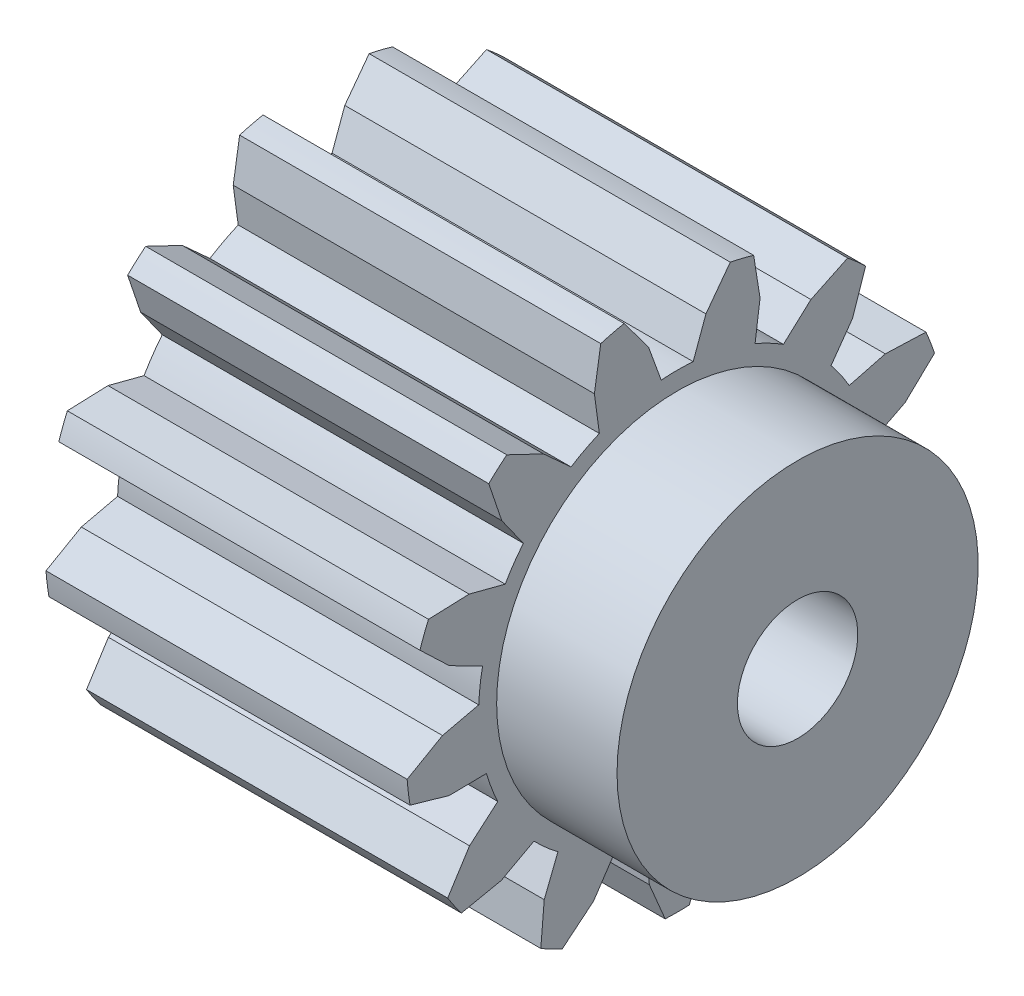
ISO-10303-21;
HEADER;
FILE_DESCRIPTION(('STEP AP214'),'2;1');
FILE_NAME('part.step','',(''),(''),'','','');
FILE_SCHEMA(('AUTOMOTIVE_DESIGN { 1 0 10303 214 1 1 1 1 }'));
ENDSEC;
DATA;
#1=APPLICATION_CONTEXT('core data for automotive mechanical design processes');
#2=APPLICATION_PROTOCOL_DEFINITION('international standard','automotive_design',2000,#1);
#3=PRODUCT_CONTEXT('',#1,'mechanical');
#4=PRODUCT('Part','Part','',(#3));
#5=PRODUCT_RELATED_PRODUCT_CATEGORY('part','',(#4));
#6=PRODUCT_DEFINITION_FORMATION('','',#4);
#7=PRODUCT_DEFINITION_CONTEXT('part definition',#1,'design');
#8=PRODUCT_DEFINITION('design','',#6,#7);
#9=PRODUCT_DEFINITION_SHAPE('','',#8);
#10=(LENGTH_UNIT() NAMED_UNIT(*) SI_UNIT(.MILLI.,.METRE.));
#11=(NAMED_UNIT(*) PLANE_ANGLE_UNIT() SI_UNIT($,.RADIAN.));
#12=(NAMED_UNIT(*) SI_UNIT($,.STERADIAN.) SOLID_ANGLE_UNIT());
#13=UNCERTAINTY_MEASURE_WITH_UNIT(LENGTH_MEASURE(1.E-05),#10,'distance_accuracy_value','');
#14=(GEOMETRIC_REPRESENTATION_CONTEXT(3) GLOBAL_UNCERTAINTY_ASSIGNED_CONTEXT((#13)) GLOBAL_UNIT_ASSIGNED_CONTEXT((#10,
#11,#12)) REPRESENTATION_CONTEXT('',''));
#15=CARTESIAN_POINT('',(0.,0.,0.));
#16=DIRECTION('',(0.,0.,1.));
#17=DIRECTION('',(1.,0.,0.));
#18=AXIS2_PLACEMENT_3D('',#15,#16,#17);
#19=CARTESIAN_POINT('',(-30.,-45.57954000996,-44.8688304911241));
#20=DIRECTION('',(-1.,0.,0.));
#21=DIRECTION('',(0.,0.,1.));
#22=AXIS2_PLACEMENT_3D('',#19,#20,#21);
#23=PLANE('',#22);
#24=CARTESIAN_POINT('',(-30.,0.,0.));
#25=DIRECTION('',(-1.,0.,0.));
#26=DIRECTION('',(0.,0.,1.));
#27=AXIS2_PLACEMENT_3D('',#24,#25,#26);
#28=CIRCLE('',#27,10.);
#29=CARTESIAN_POINT('',(-30.,0.,10.));
#30=VERTEX_POINT('',#29);
#31=EDGE_CURVE('E18',#30,#30,#28,.T.);
#32=ORIENTED_EDGE('',*,*,#31,.F.);
#33=EDGE_LOOP('',(#32));
#34=FACE_BOUND('',#33,.T.);
#35=CARTESIAN_POINT('',(-30.,4.39752401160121E-13,-1.64104840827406E-12));
#36=DIRECTION('',(-1.,0.,0.));
#37=DIRECTION('',(0.,-1.,0.));
#38=AXIS2_PLACEMENT_3D('',#35,#36,#37);
#39=CIRCLE('',#38,33.0000000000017);
#40=CARTESIAN_POINT('',(-30.,-9.18117630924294,31.6970976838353));
#41=VERTEX_POINT('',#40);
#42=CARTESIAN_POINT('',(-30.,-14.1468545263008,29.8138643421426));
#43=VERTEX_POINT('',#42);
#44=EDGE_CURVE('E1060',#41,#43,#39,.F.);
#45=ORIENTED_EDGE('',*,*,#44,.F.);
#46=DIRECTION('',(0.,0.013425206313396,-0.999909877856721));
#47=VECTOR('',#46,1.);
#48=CARTESIAN_POINT('',(-30.,-9.22270818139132,34.7903931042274));
#49=LINE('',#48,#47);
#50=CARTESIAN_POINT('',(-30.,-9.2642400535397,37.8836885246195));
#51=VERTEX_POINT('',#50);
#52=EDGE_CURVE('E847',#51,#41,#49,.T.);
#53=ORIENTED_EDGE('',*,*,#52,.F.);
#54=DIRECTION('',(0.,-0.274998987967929,-0.961444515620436));
#55=VECTOR('',#54,1.);
#56=CARTESIAN_POINT('',(-30.,-8.33422428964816,41.1351861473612));
#57=LINE('',#56,#55);
#58=CARTESIAN_POINT('',(-30.,-7.4042085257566,44.3866837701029));
#59=VERTEX_POINT('',#58);
#60=EDGE_CURVE('E503',#59,#51,#57,.T.);
#61=ORIENTED_EDGE('',*,*,#60,.F.);
#62=CARTESIAN_POINT('',(-30.,-6.39896122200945E-13,2.66106581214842E-12));
#63=DIRECTION('',(-1.,0.,0.));
#64=DIRECTION('',(0.,0.,1.));
#65=AXIS2_PLACEMENT_3D('',#62,#63,#64);
#66=CIRCLE('',#65,44.9999999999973);
#67=CARTESIAN_POINT('',(-30.,-3.43337302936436,44.8688304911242));
#68=VERTEX_POINT('',#67);
#69=EDGE_CURVE('E498',#68,#59,#66,.F.);
#70=ORIENTED_EDGE('',*,*,#69,.F.);
#71=DIRECTION('',(0.,-0.497096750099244,0.867695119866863));
#72=VECTOR('',#71,1.);
#73=CARTESIAN_POINT('',(-30.,-1.75224751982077,41.9343828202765));
#74=LINE('',#73,#72);
#75=CARTESIAN_POINT('',(-30.,-0.0711220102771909,38.9999351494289));
#76=VERTEX_POINT('',#75);
#77=EDGE_CURVE('E501',#76,#68,#74,.T.);
#78=ORIENTED_EDGE('',*,*,#77,.F.);
#79=DIRECTION('',(0.,-0.226259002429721,0.974067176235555));
#80=VECTOR('',#79,1.);
#81=CARTESIAN_POINT('',(-30.,0.628827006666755,35.9865860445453));
#82=LINE('',#81,#80);
#83=CARTESIAN_POINT('',(-30.,1.3287760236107,32.9732369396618));
#84=VERTEX_POINT('',#83);
#85=EDGE_CURVE('E518',#84,#76,#82,.T.);
#86=ORIENTED_EDGE('',*,*,#85,.F.);
#87=CARTESIAN_POINT('',(-30.,0.,6.21031004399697E-13));
#88=DIRECTION('',(-1.,0.,0.));
#89=DIRECTION('',(0.,-1.,0.));
#90=AXIS2_PLACEMENT_3D('',#87,#88,#89);
#91=CIRCLE('',#90,32.9999999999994);
#92=CARTESIAN_POINT('',(-30.,6.60084789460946,32.3330915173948));
#93=VERTEX_POINT('',#92);
#94=EDGE_CURVE('E988',#93,#84,#91,.F.);
#95=ORIENTED_EDGE('',*,*,#94,.F.);
#96=DIRECTION('',(0.,-0.452793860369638,-0.891615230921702));
#97=VECTOR('',#96,1.);
#98=CARTESIAN_POINT('',(-30.,8.00159930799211,35.0913694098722));
#99=LINE('',#98,#97);
#100=CARTESIAN_POINT('',(-30.,9.40235072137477,37.8496473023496));
#101=VERTEX_POINT('',#100);
#102=EDGE_CURVE('E535',#101,#93,#99,.T.);
#103=ORIENTED_EDGE('',*,*,#102,.F.);
#104=DIRECTION('',(0.,-0.69030505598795,-0.723518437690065));
#105=VECTOR('',#104,1.);
#106=CARTESIAN_POINT('',(-30.,11.7368850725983,40.2965055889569));
#107=LINE('',#106,#105);
#108=CARTESIAN_POINT('',(-30.,14.0714194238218,42.7433638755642));
#109=VERTEX_POINT('',#108);
#110=EDGE_CURVE('E542',#109,#101,#107,.T.);
#111=ORIENTED_EDGE('',*,*,#110,.F.);
#112=CARTESIAN_POINT('',(-30.,1.11022302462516E-12,2.67841304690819E-12));
#113=DIRECTION('',(-1.,0.,0.));
#114=DIRECTION('',(0.,-1.,0.));
#115=AXIS2_PLACEMENT_3D('',#112,#113,#114);
#116=CIRCLE('',#115,44.9999999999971);
#117=CARTESIAN_POINT('',(-30.,17.8114843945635,41.3249443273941));
#118=VERTEX_POINT('',#117);
#119=EDGE_CURVE('E991',#118,#109,#116,.F.);
#120=ORIENTED_EDGE('',*,*,#119,.F.);
#121=DIRECTION('',(0.,-0.0369192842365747,0.999318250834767));
#122=VECTOR('',#121,1.);
#123=CARTESIAN_POINT('',(-30.,17.9363412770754,37.9453619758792));
#124=LINE('',#123,#122);
#125=CARTESIAN_POINT('',(-30.,18.0611981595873,34.5657796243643));
#126=VERTEX_POINT('',#125);
#127=EDGE_CURVE('E548',#126,#118,#124,.T.);
#128=ORIENTED_EDGE('',*,*,#127,.F.);
#129=DIRECTION('',(0.,0.252329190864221,0.967641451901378));
#130=VECTOR('',#129,1.);
#131=CARTESIAN_POINT('',(-30.,17.2805990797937,31.5723089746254));
#132=LINE('',#131,#130);
#133=CARTESIAN_POINT('',(-30.,16.5,28.5788383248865));
#134=VERTEX_POINT('',#133);
#135=EDGE_CURVE('E555',#134,#126,#132,.T.);
#136=ORIENTED_EDGE('',*,*,#135,.F.);
#137=CARTESIAN_POINT('',(-30.,2.20309881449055E-13,3.10515502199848E-13));
#138=DIRECTION('',(-1.,0.,0.));
#139=DIRECTION('',(0.,-1.,0.));
#140=AXIS2_PLACEMENT_3D('',#137,#138,#139);
#141=CIRCLE('',#140,32.9999999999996);
#142=CARTESIAN_POINT('',(-30.,20.8706973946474,25.5619637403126));
#143=VERTEX_POINT('',#142);
#144=EDGE_CURVE('E994',#143,#134,#141,.F.);
#145=ORIENTED_EDGE('',*,*,#144,.F.);
#146=DIRECTION('',(0.,-0.815283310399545,-0.579062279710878));
#147=VECTOR('',#146,1.);
#148=CARTESIAN_POINT('',(-30.,23.3928368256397,27.3533358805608));
#149=LINE('',#148,#147);
#150=CARTESIAN_POINT('',(-30.,25.9149762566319,29.144708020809));
#151=VERTEX_POINT('',#150);
#152=EDGE_CURVE('E561',#151,#143,#149,.T.);
#153=ORIENTED_EDGE('',*,*,#152,.F.);
#154=DIRECTION('',(0.,-0.947470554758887,-0.31984300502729));
#155=VECTOR('',#154,1.);
#156=CARTESIAN_POINT('',(-30.,29.1192155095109,30.2263812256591));
#157=LINE('',#156,#155);
#158=CARTESIAN_POINT('',(-30.,32.3234547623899,31.3080544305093));
#159=VERTEX_POINT('',#158);
#160=EDGE_CURVE('E568',#159,#151,#157,.T.);
#161=ORIENTED_EDGE('',*,*,#160,.F.);
#162=CARTESIAN_POINT('',(-30.,1.67921232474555E-12,1.16920362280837E-12));
#163=DIRECTION('',(-1.,0.,0.));
#164=DIRECTION('',(0.,0.,1.));
#165=AXIS2_PLACEMENT_3D('',#162,#163,#164);
#166=CIRCLE('',#165,44.999999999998);
#167=CARTESIAN_POINT('',(-30.,34.9759453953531,28.3140114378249));
#168=VERTEX_POINT('',#167);
#169=EDGE_CURVE('E997',#168,#159,#166,.F.);
#170=ORIENTED_EDGE('',*,*,#169,.F.);
#171=DIRECTION('',(0.,0.431715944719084,0.902009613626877));
#172=VECTOR('',#171,1.);
#173=CARTESIAN_POINT('',(-30.,33.5159304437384,25.2635159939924));
#174=LINE('',#173,#172);
#175=CARTESIAN_POINT('',(-30.,32.0559154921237,22.2130205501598));
#176=VERTEX_POINT('',#175);
#177=EDGE_CURVE('E574',#176,#168,#174,.T.);
#178=ORIENTED_EDGE('',*,*,#177,.F.);
#179=DIRECTION('',(0.,0.673111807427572,0.739540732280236));
#180=VECTOR('',#179,1.);
#181=CARTESIAN_POINT('',(-30.,29.9735941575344,19.9251964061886));
#182=LINE('',#181,#180);
#183=CARTESIAN_POINT('',(-30.,27.8912728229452,17.6373722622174));
#184=VERTEX_POINT('',#183);
#185=EDGE_CURVE('E581',#184,#176,#182,.T.);
#186=ORIENTED_EDGE('',*,*,#185,.F.);
#187=CARTESIAN_POINT('',(-30.,2.20309881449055E-13,0.));
#188=DIRECTION('',(-1.,0.,0.));
#189=DIRECTION('',(0.,0.,1.));
#190=AXIS2_PLACEMENT_3D('',#187,#188,#189);
#191=CIRCLE('',#190,32.9999999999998);
#192=CARTESIAN_POINT('',(-30.,30.3593216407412,12.9348981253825));
#193=VERTEX_POINT('',#192);
#194=EDGE_CURVE('E1000',#193,#184,#191,.F.);
#195=ORIENTED_EDGE('',*,*,#194,.F.);
#196=DIRECTION('',(0.,-0.991001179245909,-0.13385313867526));
#197=VECTOR('',#196,1.);
#198=CARTESIAN_POINT('',(-30.,33.4250573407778,13.3489827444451));
#199=LINE('',#198,#197);
#200=CARTESIAN_POINT('',(-30.,36.4907930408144,13.7630673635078));
#201=VERTEX_POINT('',#200);
#202=EDGE_CURVE('E587',#201,#193,#199,.T.);
#203=ORIENTED_EDGE('',*,*,#202,.F.);
#204=DIRECTION('',(0.,-0.987581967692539,0.157104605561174));
#205=VECTOR('',#204,1.);
#206=CARTESIAN_POINT('',(-30.,39.8306845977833,13.2317571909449));
#207=LINE('',#206,#205);
#208=CARTESIAN_POINT('',(-30.,43.1705761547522,12.700447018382));
#209=VERTEX_POINT('',#208);
#210=EDGE_CURVE('E594',#209,#201,#207,.T.);
#211=ORIENTED_EDGE('',*,*,#210,.F.);
#212=CARTESIAN_POINT('',(-30.,1.51961776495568E-12,-8.50014503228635E-13));
#213=DIRECTION('',(-1.,0.,0.));
#214=DIRECTION('',(0.,0.,1.));
#215=AXIS2_PLACEMENT_3D('',#212,#213,#214);
#216=CIRCLE('',#215,44.9999999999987);
#217=CARTESIAN_POINT('',(-30.,44.1278388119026,8.81667974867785));
#218=VERTEX_POINT('',#217);
#219=EDGE_CURVE('E1003',#218,#209,#216,.F.);
#220=ORIENTED_EDGE('',*,*,#219,.F.);
#221=DIRECTION('',(0.,0.801450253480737,0.598061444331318));
#222=VECTOR('',#221,1.);
#223=CARTESIAN_POINT('',(-30.,41.4174238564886,6.79410295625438));
#224=LINE('',#223,#222);
#225=CARTESIAN_POINT('',(-30.,38.7070089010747,4.7715261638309));
#226=VERTEX_POINT('',#225);
#227=EDGE_CURVE('E600',#226,#218,#224,.T.);
#228=ORIENTED_EDGE('',*,*,#227,.F.);
#229=DIRECTION('',(0.,0.939692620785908,0.34202014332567));
#230=VECTOR('',#229,1.);
#231=CARTESIAN_POINT('',(-30.,35.8000000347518,3.71346146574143));
#232=LINE('',#231,#230);
#233=CARTESIAN_POINT('',(-30.,32.8929911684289,2.65539676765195));
#234=VERTEX_POINT('',#233);
#235=EDGE_CURVE('E607',#234,#226,#232,.T.);
#236=ORIENTED_EDGE('',*,*,#235,.F.);
#237=CARTESIAN_POINT('',(-30.,-7.0082828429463E-13,0.));
#238=DIRECTION('',(-1.,0.,0.));
#239=DIRECTION('',(0.,0.,1.));
#240=AXIS2_PLACEMENT_3D('',#237,#238,#239);
#241=CIRCLE('',#240,33.0000000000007);
#242=CARTESIAN_POINT('',(-30.,32.8929911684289,-2.65539676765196));
#243=VERTEX_POINT('',#242);
#244=EDGE_CURVE('E1006',#243,#234,#241,.F.);
#245=ORIENTED_EDGE('',*,*,#244,.F.);
#246=DIRECTION('',(0.,-0.939692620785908,0.342020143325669));
#247=VECTOR('',#246,1.);
#248=CARTESIAN_POINT('',(-30.,35.8000000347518,-3.71346146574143));
#249=LINE('',#248,#247);
#250=CARTESIAN_POINT('',(-30.,38.7070089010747,-4.7715261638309));
#251=VERTEX_POINT('',#250);
#252=EDGE_CURVE('E613',#251,#243,#249,.T.);
#253=ORIENTED_EDGE('',*,*,#252,.F.);
#254=DIRECTION('',(0.,-0.801450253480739,0.598061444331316));
#255=VECTOR('',#254,1.);
#256=CARTESIAN_POINT('',(-30.,41.4174238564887,-6.79410295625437));
#257=LINE('',#256,#255);
#258=CARTESIAN_POINT('',(-30.,44.1278388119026,-8.81667974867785));
#259=VERTEX_POINT('',#258);
#260=EDGE_CURVE('E620',#259,#251,#257,.T.);
#261=ORIENTED_EDGE('',*,*,#260,.F.);
#262=CARTESIAN_POINT('',(-30.,-1.67921232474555E-12,8.10115863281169E-13));
#263=DIRECTION('',(-1.,0.,0.));
#264=DIRECTION('',(0.,0.,1.));
#265=AXIS2_PLACEMENT_3D('',#262,#263,#264);
#266=CIRCLE('',#265,45.0000000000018);
#267=CARTESIAN_POINT('',(-30.,43.1705761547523,-12.7004470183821));
#268=VERTEX_POINT('',#267);
#269=EDGE_CURVE('E1009',#268,#259,#266,.F.);
#270=ORIENTED_EDGE('',*,*,#269,.F.);
#271=DIRECTION('',(0.,0.987581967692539,0.157104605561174));
#272=VECTOR('',#271,1.);
#273=CARTESIAN_POINT('',(-30.,39.8306845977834,-13.2317571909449));
#274=LINE('',#273,#272);
#275=CARTESIAN_POINT('',(-30.,36.4907930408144,-13.7630673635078));
#276=VERTEX_POINT('',#275);
#277=EDGE_CURVE('E626',#276,#268,#274,.T.);
#278=ORIENTED_EDGE('',*,*,#277,.F.);
#279=DIRECTION('',(0.,0.991001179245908,-0.133853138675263));
#280=VECTOR('',#279,1.);
#281=CARTESIAN_POINT('',(-30.,33.4250573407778,-13.3489827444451));
#282=LINE('',#281,#280);
#283=CARTESIAN_POINT('',(-30.,30.3593216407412,-12.9348981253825));
#284=VERTEX_POINT('',#283);
#285=EDGE_CURVE('E633',#284,#276,#282,.T.);
#286=ORIENTED_EDGE('',*,*,#285,.F.);
#287=CARTESIAN_POINT('',(-30.,1.90819582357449E-13,-2.89698820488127E-13));
#288=DIRECTION('',(-1.,0.,0.));
#289=DIRECTION('',(0.,0.,1.));
#290=AXIS2_PLACEMENT_3D('',#287,#288,#289);
#291=CIRCLE('',#290,32.9999999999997);
#292=CARTESIAN_POINT('',(-30.,27.8912728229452,-17.6373722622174));
#293=VERTEX_POINT('',#292);
#294=EDGE_CURVE('E1012',#293,#284,#291,.F.);
#295=ORIENTED_EDGE('',*,*,#294,.F.);
#296=DIRECTION('',(0.,-0.673111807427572,0.739540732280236));
#297=VECTOR('',#296,1.);
#298=CARTESIAN_POINT('',(-30.,29.9735941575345,-19.9251964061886));
#299=LINE('',#298,#297);
#300=CARTESIAN_POINT('',(-30.,32.0559154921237,-22.2130205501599));
#301=VERTEX_POINT('',#300);
#302=EDGE_CURVE('E639',#301,#293,#299,.T.);
#303=ORIENTED_EDGE('',*,*,#302,.F.);
#304=DIRECTION('',(0.,-0.431715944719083,0.902009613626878));
#305=VECTOR('',#304,1.);
#306=CARTESIAN_POINT('',(-30.,33.5159304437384,-25.2635159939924));
#307=LINE('',#306,#305);
#308=CARTESIAN_POINT('',(-30.,34.975945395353,-28.3140114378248));
#309=VERTEX_POINT('',#308);
#310=EDGE_CURVE('E646',#309,#301,#307,.T.);
#311=ORIENTED_EDGE('',*,*,#310,.F.);
#312=CARTESIAN_POINT('',(-30.,-2.39391839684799E-13,-1.23165366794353E-12));
#313=DIRECTION('',(-1.,0.,0.));
#314=DIRECTION('',(0.,0.,1.));
#315=AXIS2_PLACEMENT_3D('',#312,#313,#314);
#316=CIRCLE('',#315,44.9999999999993);
#317=CARTESIAN_POINT('',(-30.,32.3234547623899,-31.3080544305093));
#318=VERTEX_POINT('',#317);
#319=EDGE_CURVE('E1015',#318,#309,#316,.F.);
#320=ORIENTED_EDGE('',*,*,#319,.F.);
#321=DIRECTION('',(0.,0.947470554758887,-0.319843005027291));
#322=VECTOR('',#321,1.);
#323=CARTESIAN_POINT('',(-30.,29.1192155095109,-30.2263812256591));
#324=LINE('',#323,#322);
#325=CARTESIAN_POINT('',(-30.,25.9149762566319,-29.144708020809));
#326=VERTEX_POINT('',#325);
#327=EDGE_CURVE('E652',#326,#318,#324,.T.);
#328=ORIENTED_EDGE('',*,*,#327,.F.);
#329=DIRECTION('',(0.,0.815283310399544,-0.57906227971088));
#330=VECTOR('',#329,1.);
#331=CARTESIAN_POINT('',(-30.,23.3928368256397,-27.3533358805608));
#332=LINE('',#331,#330);
#333=CARTESIAN_POINT('',(-30.,20.8706973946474,-25.5619637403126));
#334=VERTEX_POINT('',#333);
#335=EDGE_CURVE('E659',#334,#326,#332,.T.);
#336=ORIENTED_EDGE('',*,*,#335,.F.);
#337=CARTESIAN_POINT('',(-30.,0.,-3.19189119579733E-13));
#338=DIRECTION('',(-1.,0.,0.));
#339=DIRECTION('',(0.,-1.,0.));
#340=AXIS2_PLACEMENT_3D('',#337,#338,#339);
#341=CIRCLE('',#340,32.9999999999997);
#342=CARTESIAN_POINT('',(-30.,16.5,-28.5788383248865));
#343=VERTEX_POINT('',#342);
#344=EDGE_CURVE('E1018',#343,#334,#341,.F.);
#345=ORIENTED_EDGE('',*,*,#344,.F.);
#346=DIRECTION('',(0.,-0.252329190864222,0.967641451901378));
#347=VECTOR('',#346,1.);
#348=CARTESIAN_POINT('',(-30.,17.2805990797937,-31.5723089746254));
#349=LINE('',#348,#347);
#350=CARTESIAN_POINT('',(-30.,18.0611981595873,-34.5657796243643));
#351=VERTEX_POINT('',#350);
#352=EDGE_CURVE('E665',#351,#343,#349,.T.);
#353=ORIENTED_EDGE('',*,*,#352,.F.);
#354=DIRECTION('',(0.,0.0369192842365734,0.999318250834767));
#355=VECTOR('',#354,1.);
#356=CARTESIAN_POINT('',(-30.,17.9363412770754,-37.9453619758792));
#357=LINE('',#356,#355);
#358=CARTESIAN_POINT('',(-30.,17.8114843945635,-41.3249443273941));
#359=VERTEX_POINT('',#358);
#360=EDGE_CURVE('E672',#359,#351,#357,.T.);
#361=ORIENTED_EDGE('',*,*,#360,.F.);
#362=CARTESIAN_POINT('',(-30.,-1.30104260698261E-13,-8.98586760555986E-13));
#363=DIRECTION('',(-1.,0.,0.));
#364=DIRECTION('',(0.,0.,1.));
#365=AXIS2_PLACEMENT_3D('',#362,#363,#364);
#366=CIRCLE('',#365,44.9999999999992);
#367=CARTESIAN_POINT('',(-30.,14.0714194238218,-42.7433638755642));
#368=VERTEX_POINT('',#367);
#369=EDGE_CURVE('E1021',#368,#359,#366,.F.);
#370=ORIENTED_EDGE('',*,*,#369,.F.);
#371=DIRECTION('',(0.,0.690305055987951,-0.723518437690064));
#372=VECTOR('',#371,1.);
#373=CARTESIAN_POINT('',(-30.,11.7368850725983,-40.2965055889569));
#374=LINE('',#373,#372);
#375=CARTESIAN_POINT('',(-30.,9.40235072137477,-37.8496473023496));
#376=VERTEX_POINT('',#375);
#377=EDGE_CURVE('E678',#376,#368,#374,.T.);
#378=ORIENTED_EDGE('',*,*,#377,.F.);
#379=DIRECTION('',(0.,0.452793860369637,-0.891615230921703));
#380=VECTOR('',#379,1.);
#381=CARTESIAN_POINT('',(-30.,8.00159930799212,-35.0913694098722));
#382=LINE('',#381,#380);
#383=CARTESIAN_POINT('',(-30.,6.60084789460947,-32.3330915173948));
#384=VERTEX_POINT('',#383);
#385=EDGE_CURVE('E685',#384,#376,#382,.T.);
#386=ORIENTED_EDGE('',*,*,#385,.F.);
#387=CARTESIAN_POINT('',(-30.,-1.20021180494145E-13,1.02001740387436E-12));
#388=DIRECTION('',(-1.,0.,0.));
#389=DIRECTION('',(0.,-1.,0.));
#390=AXIS2_PLACEMENT_3D('',#387,#388,#389);
#391=CIRCLE('',#390,33.000000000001);
#392=CARTESIAN_POINT('',(-30.,1.3287760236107,-32.9732369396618));
#393=VERTEX_POINT('',#392);
#394=EDGE_CURVE('E1024',#393,#384,#391,.F.);
#395=ORIENTED_EDGE('',*,*,#394,.F.);
#396=DIRECTION('',(0.,0.226259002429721,0.974067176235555));
#397=VECTOR('',#396,1.);
#398=CARTESIAN_POINT('',(-30.,0.628827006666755,-35.9865860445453));
#399=LINE('',#398,#397);
#400=CARTESIAN_POINT('',(-30.,-0.0711220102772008,-38.9999351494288));
#401=VERTEX_POINT('',#400);
#402=EDGE_CURVE('E691',#401,#393,#399,.T.);
#403=ORIENTED_EDGE('',*,*,#402,.F.);
#404=DIRECTION('',(0.,0.497096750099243,0.867695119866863));
#405=VECTOR('',#404,1.);
#406=CARTESIAN_POINT('',(-30.,-1.75224751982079,-41.9343828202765));
#407=LINE('',#406,#405);
#408=CARTESIAN_POINT('',(-30.,-3.43337302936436,-44.8688304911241));
#409=VERTEX_POINT('',#408);
#410=EDGE_CURVE('E698',#409,#401,#407,.T.);
#411=ORIENTED_EDGE('',*,*,#410,.F.);
#412=CARTESIAN_POINT('',(-30.,-1.70002900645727E-12,-7.74033614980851E-12));
#413=DIRECTION('',(-1.,0.,0.));
#414=DIRECTION('',(0.,0.,1.));
#415=AXIS2_PLACEMENT_3D('',#412,#413,#414);
#416=CIRCLE('',#415,44.9999999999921);
#417=CARTESIAN_POINT('',(-30.,-7.40420852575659,-44.3866837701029));
#418=VERTEX_POINT('',#417);
#419=EDGE_CURVE('E1027',#418,#409,#416,.F.);
#420=ORIENTED_EDGE('',*,*,#419,.F.);
#421=DIRECTION('',(0.,0.27499898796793,-0.961444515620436));
#422=VECTOR('',#421,1.);
#423=CARTESIAN_POINT('',(-30.,-8.33422428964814,-41.1351861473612));
#424=LINE('',#423,#422);
#425=CARTESIAN_POINT('',(-30.,-9.2642400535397,-37.8836885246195));
#426=VERTEX_POINT('',#425);
#427=EDGE_CURVE('E704',#426,#418,#424,.T.);
#428=ORIENTED_EDGE('',*,*,#427,.F.);
#429=DIRECTION('',(0.,-0.0134252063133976,-0.999909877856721));
#430=VECTOR('',#429,1.);
#431=CARTESIAN_POINT('',(-30.,-9.22270818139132,-34.7903931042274));
#432=LINE('',#431,#430);
#433=CARTESIAN_POINT('',(-30.,-9.18117630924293,-31.6970976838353));
#434=VERTEX_POINT('',#433);
#435=EDGE_CURVE('E711',#434,#426,#432,.T.);
#436=ORIENTED_EDGE('',*,*,#435,.F.);
#437=CARTESIAN_POINT('',(-30.,-2.89698820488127E-13,-8.29197821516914E-13));
#438=DIRECTION('',(-1.,0.,0.));
#439=DIRECTION('',(0.,-1.,0.));
#440=AXIS2_PLACEMENT_3D('',#437,#438,#439);
#441=CIRCLE('',#440,32.9999999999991);
#442=CARTESIAN_POINT('',(-30.,-14.1468545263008,-29.8138643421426));
#443=VERTEX_POINT('',#442);
#444=EDGE_CURVE('E1030',#443,#434,#441,.F.);
#445=ORIENTED_EDGE('',*,*,#444,.F.);
#446=DIRECTION('',(0.,0.653013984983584,0.757345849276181));
#447=VECTOR('',#446,1.);
#448=CARTESIAN_POINT('',(-30.,-16.1670017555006,-32.1567699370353));
#449=LINE('',#448,#447);
#450=CARTESIAN_POINT('',(-30.,-18.1871489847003,-34.499675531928));
#451=VERTEX_POINT('',#450);
#452=EDGE_CURVE('E717',#451,#443,#449,.T.);
#453=ORIENTED_EDGE('',*,*,#452,.F.);
#454=DIRECTION('',(0.,0.84339534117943,0.537293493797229));
#455=VECTOR('',#454,1.);
#456=CARTESIAN_POINT('',(-30.,-21.0394175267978,-36.3167419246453));
#457=LINE('',#456,#455);
#458=CARTESIAN_POINT('',(-30.,-23.8916860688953,-38.1338083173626));
#459=VERTEX_POINT('',#458);
#460=EDGE_CURVE('E724',#459,#451,#457,.T.);
#461=ORIENTED_EDGE('',*,*,#460,.F.);
#462=CARTESIAN_POINT('',(-30.,-3.29944405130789E-12,-4.9890647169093E-12));
#463=DIRECTION('',(-1.,0.,0.));
#464=DIRECTION('',(0.,-1.,0.));
#465=AXIS2_PLACEMENT_3D('',#462,#463,#464);
#466=CIRCLE('',#465,44.999999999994);
#467=CARTESIAN_POINT('',(-30.,-27.1836215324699,-35.861549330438));
#468=VERTEX_POINT('',#467);
#469=EDGE_CURVE('E1033',#468,#459,#466,.F.);
#470=ORIENTED_EDGE('',*,*,#469,.F.);
#471=DIRECTION('',(0.,-0.203306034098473,-0.979115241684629));
#472=VECTOR('',#471,1.);
#473=CARTESIAN_POINT('',(-30.,-26.4960633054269,-32.5502912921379));
#474=LINE('',#473,#472);
#475=CARTESIAN_POINT('',(-30.,-25.8085050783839,-29.2390332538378));
#476=VERTEX_POINT('',#475);
#477=EDGE_CURVE('E730',#476,#468,#474,.T.);
#478=ORIENTED_EDGE('',*,*,#477,.F.);
#479=DIRECTION('',(0.,-0.476568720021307,-0.879137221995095));
#480=VECTOR('',#479,1.);
#481=CARTESIAN_POINT('',(-30.,-24.3342043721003,-26.5193570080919));
#482=LINE('',#481,#480);
#483=CARTESIAN_POINT('',(-30.,-22.8599036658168,-23.7996807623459));
#484=VERTEX_POINT('',#483);
#485=EDGE_CURVE('E737',#484,#476,#482,.T.);
#486=ORIENTED_EDGE('',*,*,#485,.F.);
#487=CARTESIAN_POINT('',(-30.,6.00214322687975E-13,4.8919202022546E-13));
#488=DIRECTION('',(-1.,0.,0.));
#489=DIRECTION('',(0.,0.,1.));
#490=AXIS2_PLACEMENT_3D('',#487,#488,#489);
#491=CIRCLE('',#490,33.0000000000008);
#492=CARTESIAN_POINT('',(-30.,-26.3816111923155,-19.8244947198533));
#493=VERTEX_POINT('',#492);
#494=EDGE_CURVE('E1036',#493,#484,#491,.F.);
#495=ORIENTED_EDGE('',*,*,#494,.F.);
#496=DIRECTION('',(0.,0.930171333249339,0.367125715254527));
#497=VECTOR('',#496,1.);
#498=CARTESIAN_POINT('',(-30.,-29.2591652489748,-20.9602253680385));
#499=LINE('',#498,#497);
#500=CARTESIAN_POINT('',(-30.,-32.136719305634,-22.0959560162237));
#501=VERTEX_POINT('',#500);
#502=EDGE_CURVE('E743',#501,#493,#499,.T.);
#503=ORIENTED_EDGE('',*,*,#502,.F.);
#504=DIRECTION('',(0.,0.996482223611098,0.0838044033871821));
#505=VECTOR('',#504,1.);
#506=CARTESIAN_POINT('',(-30.,-35.506710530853,-22.379373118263));
#507=LINE('',#506,#505);
#508=CARTESIAN_POINT('',(-30.,-38.876701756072,-22.6627902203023));
#509=VERTEX_POINT('',#508);
#510=EDGE_CURVE('E750',#509,#501,#507,.T.);
#511=ORIENTED_EDGE('',*,*,#510,.F.);
#512=CARTESIAN_POINT('',(-30.,2.2516710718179E-12,9.99200722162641E-13));
#513=DIRECTION('',(-1.,0.,0.));
#514=DIRECTION('',(0.,0.,1.));
#515=AXIS2_PLACEMENT_3D('',#512,#513,#514);
#516=CIRCLE('',#515,45.0000000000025);
#517=CARTESIAN_POINT('',(-30.,-40.7355944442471,-19.1209661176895));
#518=VERTEX_POINT('',#517);
#519=EDGE_CURVE('E1039',#518,#509,#516,.F.);
#520=ORIENTED_EDGE('',*,*,#519,.F.);
#521=DIRECTION('',(0.,-0.635036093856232,-0.772482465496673));
#522=VECTOR('',#521,1.);
#523=CARTESIAN_POINT('',(-30.,-38.5879735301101,-16.5085169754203));
#524=LINE('',#523,#522);
#525=CARTESIAN_POINT('',(-30.,-36.4403526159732,-13.896067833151));
#526=VERTEX_POINT('',#525);
#527=EDGE_CURVE('E756',#526,#518,#524,.T.);
#528=ORIENTED_EDGE('',*,*,#527,.F.);
#529=DIRECTION('',(0.,-0.830536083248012,-0.556964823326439));
#530=VECTOR('',#529,1.);
#531=CARTESIAN_POINT('',(-30.,-33.8710276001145,-12.1730558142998));
#532=LINE('',#531,#530);
#533=CARTESIAN_POINT('',(-30.,-31.3017025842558,-10.4500437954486));
#534=VERTEX_POINT('',#533);
#535=EDGE_CURVE('E763',#534,#526,#532,.T.);
#536=ORIENTED_EDGE('',*,*,#535,.F.);
#537=CARTESIAN_POINT('',(-30.,-7.3899220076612E-13,-1.10154940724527E-13));
#538=DIRECTION('',(-1.,0.,0.));
#539=DIRECTION('',(0.,0.,1.));
#540=AXIS2_PLACEMENT_3D('',#537,#538,#539);
#541=CIRCLE('',#540,32.9999999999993);
#542=CARTESIAN_POINT('',(-30.,-32.5726586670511,-5.29357226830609));
#543=VERTEX_POINT('',#542);
#544=EDGE_CURVE('E1042',#543,#534,#541,.F.);
#545=ORIENTED_EDGE('',*,*,#544,.F.);
#546=DIRECTION('',(0.,0.994237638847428,-0.107198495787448));
#547=VECTOR('',#546,1.);
#548=CARTESIAN_POINT('',(-30.,-35.6484065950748,-4.96194576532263));
#549=LINE('',#548,#547);
#550=CARTESIAN_POINT('',(-30.,-38.7241545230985,-4.63031926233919));
#551=VERTEX_POINT('',#550);
#552=EDGE_CURVE('E769',#551,#543,#549,.T.);
#553=ORIENTED_EDGE('',*,*,#552,.F.);
#554=DIRECTION('',(0.,0.921287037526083,-0.388883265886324));
#555=VECTOR('',#554,1.);
#556=CARTESIAN_POINT('',(-30.,-41.8398440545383,-3.31515963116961));
#557=LINE('',#556,#555);
#558=CARTESIAN_POINT('',(-30.,-44.9555335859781,-2.00000000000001));
#559=VERTEX_POINT('',#558);
#560=EDGE_CURVE('E776',#559,#551,#557,.T.);
#561=ORIENTED_EDGE('',*,*,#560,.F.);
#562=CARTESIAN_POINT('',(-30.,-6.01949046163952E-12,-7.50051062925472E-13));
#563=DIRECTION('',(-1.,0.,0.));
#564=DIRECTION('',(0.,0.,1.));
#565=AXIS2_PLACEMENT_3D('',#562,#563,#564);
#566=CIRCLE('',#565,44.999999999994);
#567=CARTESIAN_POINT('',(-30.,-44.955533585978,2.00000000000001));
#568=VERTEX_POINT('',#567);
#569=EDGE_CURVE('E1045',#568,#559,#566,.F.);
#570=ORIENTED_EDGE('',*,*,#569,.F.);
#571=DIRECTION('',(0.,-0.921287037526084,-0.388883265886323));
#572=VECTOR('',#571,1.);
#573=CARTESIAN_POINT('',(-30.,-41.8398440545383,3.31515963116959));
#574=LINE('',#573,#572);
#575=CARTESIAN_POINT('',(-30.,-38.7241545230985,4.63031926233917));
#576=VERTEX_POINT('',#575);
#577=EDGE_CURVE('E782',#576,#568,#574,.T.);
#578=ORIENTED_EDGE('',*,*,#577,.F.);
#579=DIRECTION('',(0.,-0.994237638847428,-0.107198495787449));
#580=VECTOR('',#579,1.);
#581=CARTESIAN_POINT('',(-30.,-35.6484065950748,4.96194576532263));
#582=LINE('',#581,#580);
#583=CARTESIAN_POINT('',(-30.,-32.5726586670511,5.29357226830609));
#584=VERTEX_POINT('',#583);
#585=EDGE_CURVE('E789',#584,#576,#582,.T.);
#586=ORIENTED_EDGE('',*,*,#585,.F.);
#587=CARTESIAN_POINT('',(-30.,3.60822483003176E-13,0.));
#588=DIRECTION('',(-1.,0.,0.));
#589=DIRECTION('',(0.,0.,1.));
#590=AXIS2_PLACEMENT_3D('',#587,#588,#589);
#591=CIRCLE('',#590,33.0000000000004);
#592=CARTESIAN_POINT('',(-30.,-31.3017025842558,10.4500437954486));
#593=VERTEX_POINT('',#592);
#594=EDGE_CURVE('E1048',#593,#584,#591,.F.);
#595=ORIENTED_EDGE('',*,*,#594,.F.);
#596=DIRECTION('',(0.,0.830536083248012,-0.556964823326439));
#597=VECTOR('',#596,1.);
#598=CARTESIAN_POINT('',(-30.,-33.8710276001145,12.1730558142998));
#599=LINE('',#598,#597);
#600=CARTESIAN_POINT('',(-30.,-36.4403526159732,13.896067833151));
#601=VERTEX_POINT('',#600);
#602=EDGE_CURVE('E795',#601,#593,#599,.T.);
#603=ORIENTED_EDGE('',*,*,#602,.F.);
#604=DIRECTION('',(0.,0.635036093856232,-0.772482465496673));
#605=VECTOR('',#604,1.);
#606=CARTESIAN_POINT('',(-30.,-38.5879735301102,16.5085169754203));
#607=LINE('',#606,#605);
#608=CARTESIAN_POINT('',(-30.,-40.7355944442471,19.1209661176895));
#609=VERTEX_POINT('',#608);
#610=EDGE_CURVE('E802',#609,#601,#607,.T.);
#611=ORIENTED_EDGE('',*,*,#610,.F.);
#612=CARTESIAN_POINT('',(-30.,-7.55992490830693E-12,3.29944405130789E-12));
#613=DIRECTION('',(-1.,0.,0.));
#614=DIRECTION('',(0.,0.,1.));
#615=AXIS2_PLACEMENT_3D('',#612,#613,#614);
#616=CIRCLE('',#615,44.9999999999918);
#617=CARTESIAN_POINT('',(-30.,-38.876701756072,22.6627902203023));
#618=VERTEX_POINT('',#617);
#619=EDGE_CURVE('E1051',#618,#609,#616,.F.);
#620=ORIENTED_EDGE('',*,*,#619,.F.);
#621=DIRECTION('',(0.,-0.996482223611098,0.0838044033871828));
#622=VECTOR('',#621,1.);
#623=CARTESIAN_POINT('',(-30.,-35.506710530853,22.379373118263));
#624=LINE('',#623,#622);
#625=CARTESIAN_POINT('',(-30.,-32.136719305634,22.0959560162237));
#626=VERTEX_POINT('',#625);
#627=EDGE_CURVE('E808',#626,#618,#624,.T.);
#628=ORIENTED_EDGE('',*,*,#627,.F.);
#629=DIRECTION('',(0.,-0.930171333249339,0.367125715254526));
#630=VECTOR('',#629,1.);
#631=CARTESIAN_POINT('',(-30.,-29.2591652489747,20.9602253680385));
#632=LINE('',#631,#630);
#633=CARTESIAN_POINT('',(-30.,-26.3816111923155,19.8244947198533));
#634=VERTEX_POINT('',#633);
#635=EDGE_CURVE('E815',#634,#626,#632,.T.);
#636=ORIENTED_EDGE('',*,*,#635,.F.);
#637=CARTESIAN_POINT('',(-30.,-6.1929628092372E-13,1.1293049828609E-12));
#638=DIRECTION('',(-1.,0.,0.));
#639=DIRECTION('',(0.,-1.,0.));
#640=AXIS2_PLACEMENT_3D('',#637,#638,#639);
#641=CIRCLE('',#640,32.9999999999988);
#642=CARTESIAN_POINT('',(-30.,-22.8599036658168,23.7996807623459));
#643=VERTEX_POINT('',#642);
#644=EDGE_CURVE('E1054',#643,#634,#641,.F.);
#645=ORIENTED_EDGE('',*,*,#644,.F.);
#646=DIRECTION('',(0.,0.476568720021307,-0.879137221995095));
#647=VECTOR('',#646,1.);
#648=CARTESIAN_POINT('',(-30.,-24.3342043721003,26.5193570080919));
#649=LINE('',#648,#647);
#650=CARTESIAN_POINT('',(-30.,-25.8085050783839,29.2390332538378));
#651=VERTEX_POINT('',#650);
#652=EDGE_CURVE('E821',#651,#643,#649,.T.);
#653=ORIENTED_EDGE('',*,*,#652,.F.);
#654=DIRECTION('',(0.,0.203306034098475,-0.979115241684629));
#655=VECTOR('',#654,1.);
#656=CARTESIAN_POINT('',(-30.,-26.4960633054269,32.550291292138));
#657=LINE('',#656,#655);
#658=CARTESIAN_POINT('',(-30.,-27.18362153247,35.8615493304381));
#659=VERTEX_POINT('',#658);
#660=EDGE_CURVE('E828',#659,#651,#657,.T.);
#661=ORIENTED_EDGE('',*,*,#660,.F.);
#662=CARTESIAN_POINT('',(-30.,-2.69922972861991E-12,2.07125983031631E-12));
#663=DIRECTION('',(-1.,0.,0.));
#664=DIRECTION('',(0.,-1.,0.));
#665=AXIS2_PLACEMENT_3D('',#662,#663,#664);
#666=CIRCLE('',#665,44.9999999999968);
#667=CARTESIAN_POINT('',(-30.,-23.8916860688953,38.1338083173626));
#668=VERTEX_POINT('',#667);
#669=EDGE_CURVE('E1057',#668,#659,#666,.F.);
#670=ORIENTED_EDGE('',*,*,#669,.F.);
#671=DIRECTION('',(0.,-0.84339534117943,0.537293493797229));
#672=VECTOR('',#671,1.);
#673=CARTESIAN_POINT('',(-30.,-21.0394175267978,36.3167419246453));
#674=LINE('',#673,#672);
#675=CARTESIAN_POINT('',(-30.,-18.1871489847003,34.499675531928));
#676=VERTEX_POINT('',#675);
#677=EDGE_CURVE('E834',#676,#668,#674,.T.);
#678=ORIENTED_EDGE('',*,*,#677,.F.);
#679=DIRECTION('',(0.,-0.653013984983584,0.757345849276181));
#680=VECTOR('',#679,1.);
#681=CARTESIAN_POINT('',(-30.,-16.1670017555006,32.1567699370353));
#682=LINE('',#681,#680);
#683=EDGE_CURVE('E841',#43,#676,#682,.T.);
#684=ORIENTED_EDGE('',*,*,#683,.F.);
#685=EDGE_LOOP('',(#45,#53,#61,#70,#78,#86,#95,#103,#111,#120,#128,#136,#145,#153,#161,#170,
#178,#186,#195,#203,#211,#220,#228,#236,#245,#253,#261,#270,#278,#286,#295,#303,#311,#320,#328,
#336,#345,#353,#361,#370,#378,#386,#395,#403,#411,#420,#428,#436,#445,#453,#461,#470,#478,#486,
#495,#503,#511,#520,#528,#536,#545,#553,#561,#570,#578,#586,#595,#603,#611,#620,#628,#636,#645,
#653,#661,#670,#678,#684));
#686=FACE_BOUND('',#685,.T.);
#687=ADVANCED_FACE('F15',(#34,#686),#23,.T.);
#688=CARTESIAN_POINT('',(50.,0.,0.));
#689=DIRECTION('',(-1.,0.,0.));
#690=DIRECTION('',(0.,0.,1.));
#691=AXIS2_PLACEMENT_3D('',#688,#689,#690);
#692=CYLINDRICAL_SURFACE('',#691,10.);
#693=ORIENTED_EDGE('',*,*,#31,.T.);
#694=EDGE_LOOP('',(#693));
#695=FACE_BOUND('',#694,.T.);
#696=CARTESIAN_POINT('',(50.,0.,0.));
#697=DIRECTION('',(-1.,0.,0.));
#698=DIRECTION('',(0.,0.,1.));
#699=AXIS2_PLACEMENT_3D('',#696,#697,#698);
#700=CIRCLE('',#699,10.);
#701=CARTESIAN_POINT('',(50.,0.,10.));
#702=VERTEX_POINT('',#701);
#703=EDGE_CURVE('E532',#702,#702,#700,.T.);
#704=ORIENTED_EDGE('',*,*,#703,.F.);
#705=EDGE_LOOP('',(#704));
#706=FACE_BOUND('',#705,.T.);
#707=ADVANCED_FACE('F2030',(#695,#706),#692,.F.);
#708=CARTESIAN_POINT('',(-30.,-6.39896122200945E-13,2.66106581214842E-12));
#709=DIRECTION('',(-1.,0.,0.));
#710=DIRECTION('',(0.,0.,1.));
#711=AXIS2_PLACEMENT_3D('',#708,#709,#710);
#712=CYLINDRICAL_SURFACE('',#711,44.9999999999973);
#713=CARTESIAN_POINT('',(30.,-6.39896122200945E-13,2.66106581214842E-12));
#714=DIRECTION('',(-1.,0.,0.));
#715=DIRECTION('',(0.,0.,1.));
#716=AXIS2_PLACEMENT_3D('',#713,#714,#715);
#717=CIRCLE('',#716,44.9999999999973);
#718=CARTESIAN_POINT('',(30.,-3.43337302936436,44.8688304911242));
#719=VERTEX_POINT('',#718);
#720=CARTESIAN_POINT('',(30.,-7.4042085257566,44.3866837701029));
#721=VERTEX_POINT('',#720);
#722=EDGE_CURVE('E510',#719,#721,#717,.F.);
#723=ORIENTED_EDGE('',*,*,#722,.F.);
#724=DIRECTION('',(-1.,0.,0.));
#725=VECTOR('',#724,1.);
#726=CARTESIAN_POINT('',(30.,-3.43337302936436,44.8688304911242));
#727=LINE('',#726,#725);
#728=EDGE_CURVE('E507',#68,#719,#727,.F.);
#729=ORIENTED_EDGE('',*,*,#728,.F.);
#730=ORIENTED_EDGE('',*,*,#69,.T.);
#731=DIRECTION('',(-1.,0.,0.));
#732=VECTOR('',#731,1.);
#733=CARTESIAN_POINT('',(30.,-7.4042085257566,44.3866837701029));
#734=LINE('',#733,#732);
#735=EDGE_CURVE('E851',#721,#59,#734,.T.);
#736=ORIENTED_EDGE('',*,*,#735,.F.);
#737=EDGE_LOOP('',(#723,#729,#730,#736));
#738=FACE_BOUND('',#737,.T.);
#739=ADVANCED_FACE('F508',(#738),#712,.T.);
#740=CARTESIAN_POINT('',(30.,-9.26424005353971,37.8836885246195));
#741=DIRECTION('',(0.,-0.961444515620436,0.274998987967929));
#742=DIRECTION('',(0.,0.274998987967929,0.961444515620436));
#743=AXIS2_PLACEMENT_3D('',#740,#741,#742);
#744=PLANE('',#743);
#745=CARTESIAN_POINT('',(30.,-7.4042085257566,44.3866837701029));
#746=CARTESIAN_POINT('',(30.,-7.48170983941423,44.1157256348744));
#747=CARTESIAN_POINT('',(30.,-7.55921115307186,43.8447674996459));
#748=CARTESIAN_POINT('',(30.,-7.71421378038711,43.302851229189));
#749=CARTESIAN_POINT('',(30.,-7.79171509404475,43.0318930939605));
#750=CARTESIAN_POINT('',(30.,-7.94671772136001,42.4899768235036));
#751=CARTESIAN_POINT('',(30.,-8.02421903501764,42.2190186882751));
#752=CARTESIAN_POINT('',(30.,-8.1792216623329,41.6771024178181));
#753=CARTESIAN_POINT('',(30.,-8.25672297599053,41.4061442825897));
#754=CARTESIAN_POINT('',(30.,-8.41172560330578,40.8642280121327));
#755=CARTESIAN_POINT('',(30.,-8.48922691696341,40.5932698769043));
#756=CARTESIAN_POINT('',(30.,-8.64422954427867,40.0513536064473));
#757=CARTESIAN_POINT('',(30.,-8.72173085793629,39.7803954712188));
#758=CARTESIAN_POINT('',(30.,-8.87673348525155,39.2384792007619));
#759=CARTESIAN_POINT('',(30.,-8.95423479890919,38.9675210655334));
#760=CARTESIAN_POINT('',(30.,-9.10923742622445,38.4256047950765));
#761=CARTESIAN_POINT('',(30.,-9.18673873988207,38.154646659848));
#762=CARTESIAN_POINT('',(30.,-9.2642400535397,37.8836885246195));
#763=B_SPLINE_CURVE_WITH_KNOTS('',3,(#745,#746,#747,#748,#749,#750,#751,#752,#753,#754,#755,
#756,#757,#758,#759,#760,#761,#762),.UNSPECIFIED.,.F.,.F.,(4,2,2,2,2,2,2,2,4),(0.,
0.845471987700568,1.69094397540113,2.53641596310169,3.38188795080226,4.22735993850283,
5.07283192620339,5.91830391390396,6.76377590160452),.UNSPECIFIED.);
#764=CARTESIAN_POINT('',(30.,-9.2642400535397,37.8836885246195));
#765=VERTEX_POINT('',#764);
#766=EDGE_CURVE('E985',#721,#765,#763,.T.);
#767=ORIENTED_EDGE('',*,*,#766,.F.);
#768=ORIENTED_EDGE('',*,*,#735,.T.);
#769=ORIENTED_EDGE('',*,*,#60,.T.);
#770=DIRECTION('',(-1.,0.,0.));
#771=VECTOR('',#770,1.);
#772=CARTESIAN_POINT('',(30.,-9.2642400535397,37.8836885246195));
#773=LINE('',#772,#771);
#774=EDGE_CURVE('E850',#765,#51,#773,.T.);
#775=ORIENTED_EDGE('',*,*,#774,.F.);
#776=EDGE_LOOP('',(#767,#768,#769,#775));
#777=FACE_BOUND('',#776,.T.);
#778=ADVANCED_FACE('F2037',(#777),#744,.T.);
#779=CARTESIAN_POINT('',(30.,-9.18117630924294,31.6970976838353));
#780=DIRECTION('',(0.,-0.999909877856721,-0.013425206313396));
#781=DIRECTION('',(0.,-0.013425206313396,0.999909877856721));
#782=AXIS2_PLACEMENT_3D('',#779,#780,#781);
#783=PLANE('',#782);
#784=CARTESIAN_POINT('',(30.,-9.2642400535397,37.8836885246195));
#785=CARTESIAN_POINT('',(30.,-9.26077906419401,37.6259139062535));
#786=CARTESIAN_POINT('',(30.,-9.25731807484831,37.3681392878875));
#787=CARTESIAN_POINT('',(30.,-9.25039609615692,36.8525900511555));
#788=CARTESIAN_POINT('',(30.,-9.24693510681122,36.5948154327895));
#789=CARTESIAN_POINT('',(30.,-9.24001312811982,36.0792661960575));
#790=CARTESIAN_POINT('',(30.,-9.23655213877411,35.8214915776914));
#791=CARTESIAN_POINT('',(30.,-9.22963016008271,35.3059423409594));
#792=CARTESIAN_POINT('',(30.,-9.22616917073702,35.0481677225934));
#793=CARTESIAN_POINT('',(30.,-9.21924719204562,34.5326184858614));
#794=CARTESIAN_POINT('',(30.,-9.21578620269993,34.2748438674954));
#795=CARTESIAN_POINT('',(30.,-9.20886422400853,33.7592946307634));
#796=CARTESIAN_POINT('',(30.,-9.20540323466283,33.5015200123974));
#797=CARTESIAN_POINT('',(30.,-9.19848125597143,32.9859707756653));
#798=CARTESIAN_POINT('',(30.,-9.19502026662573,32.7281961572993));
#799=CARTESIAN_POINT('',(30.,-9.18809828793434,32.2126469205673));
#800=CARTESIAN_POINT('',(30.,-9.18463729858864,31.9548723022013));
#801=CARTESIAN_POINT('',(30.,-9.18117630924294,31.6970976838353));
#802=B_SPLINE_CURVE_WITH_KNOTS('',3,(#784,#785,#786,#787,#788,#789,#790,#791,#792,#793,#794,
#795,#796,#797,#798,#799,#800,#801),.UNSPECIFIED.,.F.,.F.,(4,2,2,2,2,2,2,2,4),(0.,
0.773393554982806,1.54678710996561,2.32018066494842,3.09357421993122,3.86696777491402,
4.64036132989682,5.41375488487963,6.18714843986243),.UNSPECIFIED.);
#803=CARTESIAN_POINT('',(30.,-9.18117630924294,31.6970976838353));
#804=VERTEX_POINT('',#803);
#805=EDGE_CURVE('E983',#765,#804,#802,.T.);
#806=ORIENTED_EDGE('',*,*,#805,.F.);
#807=ORIENTED_EDGE('',*,*,#774,.T.);
#808=ORIENTED_EDGE('',*,*,#52,.T.);
#809=DIRECTION('',(-1.,0.,0.));
#810=VECTOR('',#809,1.);
#811=CARTESIAN_POINT('',(0.,-9.18117630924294,31.6970976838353));
#812=LINE('',#811,#810);
#813=EDGE_CURVE('E844',#804,#41,#812,.T.);
#814=ORIENTED_EDGE('',*,*,#813,.F.);
#815=EDGE_LOOP('',(#806,#807,#808,#814));
#816=FACE_BOUND('',#815,.T.);
#817=ADVANCED_FACE('F1785',(#816),#783,.T.);
#818=CARTESIAN_POINT('',(-30.,4.39752401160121E-13,-1.64104840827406E-12));
#819=DIRECTION('',(-1.,0.,0.));
#820=DIRECTION('',(0.,-1.,0.));
#821=AXIS2_PLACEMENT_3D('',#818,#819,#820);
#822=CYLINDRICAL_SURFACE('',#821,33.0000000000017);
#823=CARTESIAN_POINT('',(30.,4.3672288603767E-13,-1.64192591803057E-12));
#824=DIRECTION('',(-1.,0.,0.));
#825=DIRECTION('',(0.,-1.,0.));
#826=AXIS2_PLACEMENT_3D('',#823,#824,#825);
#827=CIRCLE('',#826,33.0000000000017);
#828=CARTESIAN_POINT('',(30.,-14.1468545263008,29.8138643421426));
#829=VERTEX_POINT('',#828);
#830=EDGE_CURVE('E979',#804,#829,#827,.F.);
#831=ORIENTED_EDGE('',*,*,#830,.F.);
#832=ORIENTED_EDGE('',*,*,#813,.T.);
#833=ORIENTED_EDGE('',*,*,#44,.T.);
#834=DIRECTION('',(-1.,0.,0.));
#835=VECTOR('',#834,1.);
#836=CARTESIAN_POINT('',(30.,-14.1468545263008,29.8138643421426));
#837=LINE('',#836,#835);
#838=EDGE_CURVE('E838',#829,#43,#837,.T.);
#839=ORIENTED_EDGE('',*,*,#838,.F.);
#840=EDGE_LOOP('',(#831,#832,#833,#839));
#841=FACE_BOUND('',#840,.T.);
#842=ADVANCED_FACE('F1786',(#841),#822,.T.);
#843=CARTESIAN_POINT('',(30.,-18.1871489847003,34.499675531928));
#844=DIRECTION('',(0.,0.757345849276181,0.653013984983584));
#845=DIRECTION('',(0.,0.653013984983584,-0.757345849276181));
#846=AXIS2_PLACEMENT_3D('',#843,#844,#845);
#847=PLANE('',#846);
#848=CARTESIAN_POINT('',(30.,-14.1468545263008,29.8138643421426));
#849=CARTESIAN_POINT('',(30.,-14.3152001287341,30.0091064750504));
#850=CARTESIAN_POINT('',(30.,-14.4835457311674,30.2043486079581));
#851=CARTESIAN_POINT('',(30.,-14.8202369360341,30.5948328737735));
#852=CARTESIAN_POINT('',(30.,-14.9885825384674,30.7900750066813));
#853=CARTESIAN_POINT('',(30.,-15.325273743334,31.1805592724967));
#854=CARTESIAN_POINT('',(30.,-15.4936193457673,31.3758014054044));
#855=CARTESIAN_POINT('',(30.,-15.830310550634,31.7662856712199));
#856=CARTESIAN_POINT('',(30.,-15.9986561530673,31.9615278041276));
#857=CARTESIAN_POINT('',(30.,-16.3353473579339,32.3520120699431));
#858=CARTESIAN_POINT('',(30.,-16.5036929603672,32.5472542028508));
#859=CARTESIAN_POINT('',(30.,-16.8403841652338,32.9377384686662));
#860=CARTESIAN_POINT('',(30.,-17.0087297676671,33.132980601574));
#861=CARTESIAN_POINT('',(30.,-17.3454209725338,33.5234648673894));
#862=CARTESIAN_POINT('',(30.,-17.5137665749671,33.7187070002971));
#863=CARTESIAN_POINT('',(30.,-17.8504577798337,34.1091912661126));
#864=CARTESIAN_POINT('',(30.,-18.018803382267,34.3044333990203));
#865=CARTESIAN_POINT('',(30.,-18.1871489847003,34.499675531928));
#866=B_SPLINE_CURVE_WITH_KNOTS('',3,(#848,#849,#850,#851,#852,#853,#854,#855,#856,#857,#858,
#859,#860,#861,#862,#863,#864,#865),.UNSPECIFIED.,.F.,.F.,(4,2,2,2,2,2,2,2,4),(0.,
0.773393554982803,1.54678710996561,2.32018066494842,3.09357421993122,3.86696777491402,
4.64036132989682,5.41375488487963,6.18714843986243),.UNSPECIFIED.);
#867=CARTESIAN_POINT('',(30.,-18.1871489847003,34.499675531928));
#868=VERTEX_POINT('',#867);
#869=EDGE_CURVE('E982',#829,#868,#866,.T.);
#870=ORIENTED_EDGE('',*,*,#869,.F.);
#871=ORIENTED_EDGE('',*,*,#838,.T.);
#872=ORIENTED_EDGE('',*,*,#683,.T.);
#873=DIRECTION('',(-1.,0.,0.));
#874=VECTOR('',#873,1.);
#875=CARTESIAN_POINT('',(30.,-18.1871489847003,34.499675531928));
#876=LINE('',#875,#874);
#877=EDGE_CURVE('E837',#868,#676,#876,.T.);
#878=ORIENTED_EDGE('',*,*,#877,.F.);
#879=EDGE_LOOP('',(#870,#871,#872,#878));
#880=FACE_BOUND('',#879,.T.);
#881=ADVANCED_FACE('F1789',(#880),#847,.T.);
#882=CARTESIAN_POINT('',(30.,-23.8916860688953,38.1338083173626));
#883=DIRECTION('',(0.,0.537293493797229,0.84339534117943));
#884=DIRECTION('',(0.,0.84339534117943,-0.537293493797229));
#885=AXIS2_PLACEMENT_3D('',#882,#883,#884);
#886=PLANE('',#885);
#887=CARTESIAN_POINT('',(30.,-18.1871489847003,34.499675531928));
#888=CARTESIAN_POINT('',(30.,-18.4248380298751,34.6510977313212));
#889=CARTESIAN_POINT('',(30.,-18.6625270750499,34.8025199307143));
#890=CARTESIAN_POINT('',(30.,-19.1379051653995,35.1053643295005));
#891=CARTESIAN_POINT('',(30.,-19.3755942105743,35.2567865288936));
#892=CARTESIAN_POINT('',(30.,-19.8509723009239,35.5596309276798));
#893=CARTESIAN_POINT('',(30.,-20.0886613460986,35.7110531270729));
#894=CARTESIAN_POINT('',(30.,-20.5640394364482,36.0138975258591));
#895=CARTESIAN_POINT('',(30.,-20.801728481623,36.1653197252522));
#896=CARTESIAN_POINT('',(30.,-21.2771065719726,36.4681641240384));
#897=CARTESIAN_POINT('',(30.,-21.5147956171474,36.6195863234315));
#898=CARTESIAN_POINT('',(30.,-21.990173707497,36.9224307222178));
#899=CARTESIAN_POINT('',(30.,-22.2278627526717,37.0738529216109));
#900=CARTESIAN_POINT('',(30.,-22.7032408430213,37.3766973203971));
#901=CARTESIAN_POINT('',(30.,-22.9409298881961,37.5281195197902));
#902=CARTESIAN_POINT('',(30.,-23.4163079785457,37.8309639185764));
#903=CARTESIAN_POINT('',(30.,-23.6539970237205,37.9823861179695));
#904=CARTESIAN_POINT('',(30.,-23.8916860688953,38.1338083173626));
#905=B_SPLINE_CURVE_WITH_KNOTS('',3,(#887,#888,#889,#890,#891,#892,#893,#894,#895,#896,#897,
#898,#899,#900,#901,#902,#903,#904),.UNSPECIFIED.,.F.,.F.,(4,2,2,2,2,2,2,2,4),(0.,
0.845471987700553,1.69094397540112,2.53641596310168,3.38188795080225,4.22735993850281,
5.07283192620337,5.91830391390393,6.76377590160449),.UNSPECIFIED.);
#906=CARTESIAN_POINT('',(30.,-23.8916860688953,38.1338083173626));
#907=VERTEX_POINT('',#906);
#908=EDGE_CURVE('E978',#868,#907,#905,.T.);
#909=ORIENTED_EDGE('',*,*,#908,.F.);
#910=ORIENTED_EDGE('',*,*,#877,.T.);
#911=ORIENTED_EDGE('',*,*,#677,.T.);
#912=DIRECTION('',(-1.,0.,0.));
#913=VECTOR('',#912,1.);
#914=CARTESIAN_POINT('',(0.,-23.8916860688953,38.1338083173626));
#915=LINE('',#914,#913);
#916=EDGE_CURVE('E831',#907,#668,#915,.T.);
#917=ORIENTED_EDGE('',*,*,#916,.F.);
#918=EDGE_LOOP('',(#909,#910,#911,#917));
#919=FACE_BOUND('',#918,.T.);
#920=ADVANCED_FACE('F1793',(#919),#886,.T.);
#921=CARTESIAN_POINT('',(-30.,-2.69922972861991E-12,2.07125983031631E-12));
#922=DIRECTION('',(-1.,0.,0.));
#923=DIRECTION('',(0.,-1.,0.));
#924=AXIS2_PLACEMENT_3D('',#921,#922,#923);
#925=CYLINDRICAL_SURFACE('',#924,44.9999999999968);
#926=CARTESIAN_POINT('',(30.,-2.70118977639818E-12,2.07003181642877E-12));
#927=DIRECTION('',(-1.,0.,0.));
#928=DIRECTION('',(0.,-1.,0.));
#929=AXIS2_PLACEMENT_3D('',#926,#927,#928);
#930=CIRCLE('',#929,44.9999999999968);
#931=CARTESIAN_POINT('',(30.,-27.1836215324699,35.8615493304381));
#932=VERTEX_POINT('',#931);
#933=EDGE_CURVE('E974',#907,#932,#930,.F.);
#934=ORIENTED_EDGE('',*,*,#933,.F.);
#935=ORIENTED_EDGE('',*,*,#916,.T.);
#936=ORIENTED_EDGE('',*,*,#669,.T.);
#937=DIRECTION('',(-1.,0.,0.));
#938=VECTOR('',#937,1.);
#939=CARTESIAN_POINT('',(30.,-27.18362153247,35.8615493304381));
#940=LINE('',#939,#938);
#941=EDGE_CURVE('E825',#932,#659,#940,.T.);
#942=ORIENTED_EDGE('',*,*,#941,.F.);
#943=EDGE_LOOP('',(#934,#935,#936,#942));
#944=FACE_BOUND('',#943,.T.);
#945=ADVANCED_FACE('F1795',(#944),#925,.T.);
#946=CARTESIAN_POINT('',(30.,-25.8085050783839,29.2390332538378));
#947=DIRECTION('',(0.,-0.979115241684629,-0.203306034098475));
#948=DIRECTION('',(0.,-0.203306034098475,0.979115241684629));
#949=AXIS2_PLACEMENT_3D('',#946,#947,#948);
#950=PLANE('',#949);
#951=CARTESIAN_POINT('',(30.,-27.1836215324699,35.8615493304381));
#952=CARTESIAN_POINT('',(30.,-27.1263250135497,35.5856111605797));
#953=CARTESIAN_POINT('',(30.,-27.0690284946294,35.3096729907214));
#954=CARTESIAN_POINT('',(30.,-26.9544354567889,34.7577966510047));
#955=CARTESIAN_POINT('',(30.,-26.8971389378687,34.4818584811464));
#956=CARTESIAN_POINT('',(30.,-26.7825459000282,33.9299821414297));
#957=CARTESIAN_POINT('',(30.,-26.7252493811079,33.6540439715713));
#958=CARTESIAN_POINT('',(30.,-26.6106563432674,33.1021676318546));
#959=CARTESIAN_POINT('',(30.,-26.5533598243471,32.8262294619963));
#960=CARTESIAN_POINT('',(30.,-26.4387667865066,32.2743531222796));
#961=CARTESIAN_POINT('',(30.,-26.3814702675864,31.9984149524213));
#962=CARTESIAN_POINT('',(30.,-26.2668772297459,31.4465386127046));
#963=CARTESIAN_POINT('',(30.,-26.2095807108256,31.1706004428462));
#964=CARTESIAN_POINT('',(30.,-26.0949876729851,30.6187241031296));
#965=CARTESIAN_POINT('',(30.,-26.0376911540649,30.3427859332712));
#966=CARTESIAN_POINT('',(30.,-25.9230981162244,29.7909095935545));
#967=CARTESIAN_POINT('',(30.,-25.8658015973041,29.5149714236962));
#968=CARTESIAN_POINT('',(30.,-25.8085050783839,29.2390332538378));
#969=B_SPLINE_CURVE_WITH_KNOTS('',3,(#951,#952,#953,#954,#955,#956,#957,#958,#959,#960,#961,
#962,#963,#964,#965,#966,#967,#968),.UNSPECIFIED.,.F.,.F.,(4,2,2,2,2,2,2,2,4),(0.,
0.845471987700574,1.69094397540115,2.53641596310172,3.38188795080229,4.22735993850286,
5.07283192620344,5.918303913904,6.76377590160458),.UNSPECIFIED.);
#970=CARTESIAN_POINT('',(30.,-25.8085050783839,29.2390332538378));
#971=VERTEX_POINT('',#970);
#972=EDGE_CURVE('E977',#932,#971,#969,.T.);
#973=ORIENTED_EDGE('',*,*,#972,.F.);
#974=ORIENTED_EDGE('',*,*,#941,.T.);
#975=ORIENTED_EDGE('',*,*,#660,.T.);
#976=DIRECTION('',(-1.,0.,0.));
#977=VECTOR('',#976,1.);
#978=CARTESIAN_POINT('',(30.,-25.8085050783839,29.2390332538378));
#979=LINE('',#978,#977);
#980=EDGE_CURVE('E824',#971,#651,#979,.T.);
#981=ORIENTED_EDGE('',*,*,#980,.F.);
#982=EDGE_LOOP('',(#973,#974,#975,#981));
#983=FACE_BOUND('',#982,.T.);
#984=ADVANCED_FACE('F1798',(#983),#950,.T.);
#985=CARTESIAN_POINT('',(30.,-22.8599036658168,23.7996807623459));
#986=DIRECTION('',(0.,-0.879137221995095,-0.476568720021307));
#987=DIRECTION('',(0.,-0.476568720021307,0.879137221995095));
#988=AXIS2_PLACEMENT_3D('',#985,#986,#987);
#989=PLANE('',#988);
#990=CARTESIAN_POINT('',(30.,-25.8085050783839,29.2390332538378));
#991=CARTESIAN_POINT('',(30.,-25.6856466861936,29.0123935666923));
#992=CARTESIAN_POINT('',(30.,-25.5627882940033,28.7857538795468));
#993=CARTESIAN_POINT('',(30.,-25.3170715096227,28.3324745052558));
#994=CARTESIAN_POINT('',(30.,-25.1942131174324,28.1058348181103));
#995=CARTESIAN_POINT('',(30.,-24.9484963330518,27.6525554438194));
#996=CARTESIAN_POINT('',(30.,-24.8256379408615,27.4259157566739));
#997=CARTESIAN_POINT('',(30.,-24.5799211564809,26.9726363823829));
#998=CARTESIAN_POINT('',(30.,-24.4570627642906,26.7459966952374));
#999=CARTESIAN_POINT('',(30.,-24.21134597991,26.2927173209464));
#1000=CARTESIAN_POINT('',(30.,-24.0884875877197,26.0660776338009));
#1001=CARTESIAN_POINT('',(30.,-23.8427708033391,25.6127982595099));
#1002=CARTESIAN_POINT('',(30.,-23.7199124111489,25.3861585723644));
#1003=CARTESIAN_POINT('',(30.,-23.4741956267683,24.9328791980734));
#1004=CARTESIAN_POINT('',(30.,-23.351337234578,24.7062395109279));
#1005=CARTESIAN_POINT('',(30.,-23.1056204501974,24.2529601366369));
#1006=CARTESIAN_POINT('',(30.,-22.9827620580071,24.0263204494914));
#1007=CARTESIAN_POINT('',(30.,-22.8599036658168,23.7996807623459));
#1008=B_SPLINE_CURVE_WITH_KNOTS('',3,(#990,#991,#992,#993,#994,#995,#996,#997,#998,#999,#1000,
#1001,#1002,#1003,#1004,#1005,#1006,#1007),.UNSPECIFIED.,.F.,.F.,(4,2,2,2,2,2,2,2,4),(0.,
0.773393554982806,1.54678710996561,2.32018066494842,3.09357421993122,3.86696777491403,
4.64036132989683,5.41375488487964,6.18714843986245),.UNSPECIFIED.);
#1009=CARTESIAN_POINT('',(30.,-22.8599036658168,23.7996807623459));
#1010=VERTEX_POINT('',#1009);
#1011=EDGE_CURVE('E973',#971,#1010,#1008,.T.);
#1012=ORIENTED_EDGE('',*,*,#1011,.F.);
#1013=ORIENTED_EDGE('',*,*,#980,.T.);
#1014=ORIENTED_EDGE('',*,*,#652,.T.);
#1015=DIRECTION('',(-1.,0.,0.));
#1016=VECTOR('',#1015,1.);
#1017=CARTESIAN_POINT('',(0.,-22.8599036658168,23.7996807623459));
#1018=LINE('',#1017,#1016);
#1019=EDGE_CURVE('E818',#1010,#643,#1018,.T.);
#1020=ORIENTED_EDGE('',*,*,#1019,.F.);
#1021=EDGE_LOOP('',(#1012,#1013,#1014,#1020));
#1022=FACE_BOUND('',#1021,.T.);
#1023=ADVANCED_FACE('F1802',(#1022),#989,.T.);
#1024=CARTESIAN_POINT('',(-30.,-6.1929628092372E-13,1.1293049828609E-12));
#1025=DIRECTION('',(-1.,0.,0.));
#1026=DIRECTION('',(0.,-1.,0.));
#1027=AXIS2_PLACEMENT_3D('',#1024,#1025,#1026);
#1028=CYLINDRICAL_SURFACE('',#1027,32.9999999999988);
#1029=CARTESIAN_POINT('',(30.,-6.21570984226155E-13,1.12712010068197E-12));
#1030=DIRECTION('',(-1.,0.,0.));
#1031=DIRECTION('',(0.,-1.,0.));
#1032=AXIS2_PLACEMENT_3D('',#1029,#1030,#1031);
#1033=CIRCLE('',#1032,32.9999999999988);
#1034=CARTESIAN_POINT('',(30.,-26.3816111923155,19.8244947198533));
#1035=VERTEX_POINT('',#1034);
#1036=EDGE_CURVE('E969',#1010,#1035,#1033,.F.);
#1037=ORIENTED_EDGE('',*,*,#1036,.F.);
#1038=ORIENTED_EDGE('',*,*,#1019,.T.);
#1039=ORIENTED_EDGE('',*,*,#644,.T.);
#1040=DIRECTION('',(-1.,0.,0.));
#1041=VECTOR('',#1040,1.);
#1042=CARTESIAN_POINT('',(30.,-26.3816111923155,19.8244947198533));
#1043=LINE('',#1042,#1041);
#1044=EDGE_CURVE('E812',#1035,#634,#1043,.T.);
#1045=ORIENTED_EDGE('',*,*,#1044,.F.);
#1046=EDGE_LOOP('',(#1037,#1038,#1039,#1045));
#1047=FACE_BOUND('',#1046,.T.);
#1048=ADVANCED_FACE('F1804',(#1047),#1028,.T.);
#1049=CARTESIAN_POINT('',(30.,-32.136719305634,22.0959560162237));
#1050=DIRECTION('',(0.,0.367125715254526,0.930171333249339));
#1051=DIRECTION('',(0.,0.930171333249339,-0.367125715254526));
#1052=AXIS2_PLACEMENT_3D('',#1049,#1050,#1051);
#1053=PLANE('',#1052);
#1054=CARTESIAN_POINT('',(30.,-26.3816111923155,19.8244947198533));
#1055=CARTESIAN_POINT('',(30.,-26.6214073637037,19.9191389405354));
#1056=CARTESIAN_POINT('',(30.,-26.861203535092,20.0137831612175));
#1057=CARTESIAN_POINT('',(30.,-27.3407958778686,20.2030716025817));
#1058=CARTESIAN_POINT('',(30.,-27.5805920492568,20.2977158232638));
#1059=CARTESIAN_POINT('',(30.,-28.0601843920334,20.487004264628));
#1060=CARTESIAN_POINT('',(30.,-28.2999805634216,20.5816484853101));
#1061=CARTESIAN_POINT('',(30.,-28.7795729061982,20.7709369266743));
#1062=CARTESIAN_POINT('',(30.,-29.0193690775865,20.8655811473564));
#1063=CARTESIAN_POINT('',(30.,-29.498961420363,21.0548695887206));
#1064=CARTESIAN_POINT('',(30.,-29.7387575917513,21.1495138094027));
#1065=CARTESIAN_POINT('',(30.,-30.2183499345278,21.3388022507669));
#1066=CARTESIAN_POINT('',(30.,-30.4581461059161,21.433446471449));
#1067=CARTESIAN_POINT('',(30.,-30.9377384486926,21.6227349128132));
#1068=CARTESIAN_POINT('',(30.,-31.1775346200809,21.7173791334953));
#1069=CARTESIAN_POINT('',(30.,-31.6571269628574,21.9066675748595));
#1070=CARTESIAN_POINT('',(30.,-31.8969231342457,22.0013117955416));
#1071=CARTESIAN_POINT('',(30.,-32.136719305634,22.0959560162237));
#1072=B_SPLINE_CURVE_WITH_KNOTS('',3,(#1054,#1055,#1056,#1057,#1058,#1059,#1060,#1061,#1062,
#1063,#1064,#1065,#1066,#1067,#1068,#1069,#1070,#1071),.UNSPECIFIED.,.F.,.F.,(4,2,2,2,2,2,2,2,
4),(0.,0.773393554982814,1.54678710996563,2.32018066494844,3.09357421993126,3.86696777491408,
4.64036132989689,5.41375488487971,6.18714843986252),.UNSPECIFIED.);
#1073=CARTESIAN_POINT('',(30.,-32.136719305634,22.0959560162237));
#1074=VERTEX_POINT('',#1073);
#1075=EDGE_CURVE('E972',#1035,#1074,#1072,.T.);
#1076=ORIENTED_EDGE('',*,*,#1075,.F.);
#1077=ORIENTED_EDGE('',*,*,#1044,.T.);
#1078=ORIENTED_EDGE('',*,*,#635,.T.);
#1079=DIRECTION('',(-1.,0.,0.));
#1080=VECTOR('',#1079,1.);
#1081=CARTESIAN_POINT('',(30.,-32.136719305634,22.0959560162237));
#1082=LINE('',#1081,#1080);
#1083=EDGE_CURVE('E811',#1074,#626,#1082,.T.);
#1084=ORIENTED_EDGE('',*,*,#1083,.F.);
#1085=EDGE_LOOP('',(#1076,#1077,#1078,#1084));
#1086=FACE_BOUND('',#1085,.T.);
#1087=ADVANCED_FACE('F1807',(#1086),#1053,.T.);
#1088=CARTESIAN_POINT('',(30.,-38.876701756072,22.6627902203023));
#1089=DIRECTION('',(0.,0.0838044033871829,0.996482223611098));
#1090=DIRECTION('',(0.,0.996482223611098,-0.0838044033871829));
#1091=AXIS2_PLACEMENT_3D('',#1088,#1089,#1090);
#1092=PLANE('',#1091);
#1093=CARTESIAN_POINT('',(30.,-32.136719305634,22.0959560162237));
#1094=CARTESIAN_POINT('',(30.,-32.4175519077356,22.1195741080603));
#1095=CARTESIAN_POINT('',(30.,-32.6983845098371,22.1431921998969));
#1096=CARTESIAN_POINT('',(30.,-33.2600497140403,22.1904283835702));
#1097=CARTESIAN_POINT('',(30.,-33.5408823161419,22.2140464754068));
#1098=CARTESIAN_POINT('',(30.,-34.1025475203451,22.26128265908));
#1099=CARTESIAN_POINT('',(30.,-34.3833801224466,22.2849007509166));
#1100=CARTESIAN_POINT('',(30.,-34.9450453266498,22.3321369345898));
#1101=CARTESIAN_POINT('',(30.,-35.2258779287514,22.3557550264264));
#1102=CARTESIAN_POINT('',(30.,-35.7875431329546,22.4029912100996));
#1103=CARTESIAN_POINT('',(30.,-36.0683757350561,22.4266093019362));
#1104=CARTESIAN_POINT('',(30.,-36.6300409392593,22.4738454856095));
#1105=CARTESIAN_POINT('',(30.,-36.9108735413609,22.4974635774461));
#1106=CARTESIAN_POINT('',(30.,-37.4725387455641,22.5446997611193));
#1107=CARTESIAN_POINT('',(30.,-37.7533713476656,22.5683178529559));
#1108=CARTESIAN_POINT('',(30.,-38.3150365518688,22.6155540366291));
#1109=CARTESIAN_POINT('',(30.,-38.5958691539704,22.6391721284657));
#1110=CARTESIAN_POINT('',(30.,-38.876701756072,22.6627902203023));
#1111=B_SPLINE_CURVE_WITH_KNOTS('',3,(#1093,#1094,#1095,#1096,#1097,#1098,#1099,#1100,#1101,
#1102,#1103,#1104,#1105,#1106,#1107,#1108,#1109,#1110),.UNSPECIFIED.,.F.,.F.,(4,2,2,2,2,2,2,2,
4),(0.,0.845471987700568,1.69094397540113,2.5364159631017,3.38188795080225,4.22735993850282,
5.07283192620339,5.91830391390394,6.7637759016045),.UNSPECIFIED.);
#1112=CARTESIAN_POINT('',(30.,-38.876701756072,22.6627902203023));
#1113=VERTEX_POINT('',#1112);
#1114=EDGE_CURVE('E968',#1074,#1113,#1111,.T.);
#1115=ORIENTED_EDGE('',*,*,#1114,.F.);
#1116=ORIENTED_EDGE('',*,*,#1083,.T.);
#1117=ORIENTED_EDGE('',*,*,#627,.T.);
#1118=DIRECTION('',(-1.,0.,0.));
#1119=VECTOR('',#1118,1.);
#1120=CARTESIAN_POINT('',(0.,-38.876701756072,22.6627902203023));
#1121=LINE('',#1120,#1119);
#1122=EDGE_CURVE('E805',#1113,#618,#1121,.T.);
#1123=ORIENTED_EDGE('',*,*,#1122,.F.);
#1124=EDGE_LOOP('',(#1115,#1116,#1117,#1123));
#1125=FACE_BOUND('',#1124,.T.);
#1126=ADVANCED_FACE('F1811',(#1125),#1092,.T.);
#1127=CARTESIAN_POINT('',(-30.,-7.55992490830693E-12,3.29944405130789E-12));
#1128=DIRECTION('',(-1.,0.,0.));
#1129=DIRECTION('',(0.,0.,1.));
#1130=AXIS2_PLACEMENT_3D('',#1127,#1128,#1129);
#1131=CYLINDRICAL_SURFACE('',#1130,44.9999999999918);
#1132=CARTESIAN_POINT('',(30.,-7.55992490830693E-12,3.29944405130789E-12));
#1133=DIRECTION('',(-1.,0.,0.));
#1134=DIRECTION('',(0.,0.,1.));
#1135=AXIS2_PLACEMENT_3D('',#1132,#1133,#1134);
#1136=CIRCLE('',#1135,44.9999999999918);
#1137=CARTESIAN_POINT('',(30.,-40.7355944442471,19.1209661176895));
#1138=VERTEX_POINT('',#1137);
#1139=EDGE_CURVE('E964',#1113,#1138,#1136,.F.);
#1140=ORIENTED_EDGE('',*,*,#1139,.F.);
#1141=ORIENTED_EDGE('',*,*,#1122,.T.);
#1142=ORIENTED_EDGE('',*,*,#619,.T.);
#1143=DIRECTION('',(-1.,0.,0.));
#1144=VECTOR('',#1143,1.);
#1145=CARTESIAN_POINT('',(30.,-40.7355944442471,19.1209661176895));
#1146=LINE('',#1145,#1144);
#1147=EDGE_CURVE('E799',#1138,#609,#1146,.T.);
#1148=ORIENTED_EDGE('',*,*,#1147,.F.);
#1149=EDGE_LOOP('',(#1140,#1141,#1142,#1148));
#1150=FACE_BOUND('',#1149,.T.);
#1151=ADVANCED_FACE('F1813',(#1150),#1131,.T.);
#1152=CARTESIAN_POINT('',(30.,-36.4403526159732,13.896067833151));
#1153=DIRECTION('',(0.,-0.772482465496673,-0.635036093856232));
#1154=DIRECTION('',(0.,-0.635036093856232,0.772482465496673));
#1155=AXIS2_PLACEMENT_3D('',#1152,#1153,#1154);
#1156=PLANE('',#1155);
#1157=CARTESIAN_POINT('',(30.,-40.7355944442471,19.1209661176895));
#1158=CARTESIAN_POINT('',(30.,-40.5566260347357,18.9032620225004));
#1159=CARTESIAN_POINT('',(30.,-40.3776576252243,18.6855579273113));
#1160=CARTESIAN_POINT('',(30.,-40.0197208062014,18.2501497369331));
#1161=CARTESIAN_POINT('',(30.,-39.84075239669,18.032445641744));
#1162=CARTESIAN_POINT('',(30.,-39.4828155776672,17.5970374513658));
#1163=CARTESIAN_POINT('',(30.,-39.3038471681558,17.3793333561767));
#1164=CARTESIAN_POINT('',(30.,-38.945910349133,16.9439251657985));
#1165=CARTESIAN_POINT('',(30.,-38.7669419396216,16.7262210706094));
#1166=CARTESIAN_POINT('',(30.,-38.4090051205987,16.2908128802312));
#1167=CARTESIAN_POINT('',(30.,-38.2300367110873,16.0731087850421));
#1168=CARTESIAN_POINT('',(30.,-37.8720998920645,15.6377005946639));
#1169=CARTESIAN_POINT('',(30.,-37.6931314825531,15.4199964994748));
#1170=CARTESIAN_POINT('',(30.,-37.3351946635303,14.9845883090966));
#1171=CARTESIAN_POINT('',(30.,-37.1562262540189,14.7668842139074));
#1172=CARTESIAN_POINT('',(30.,-36.798289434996,14.3314760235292));
#1173=CARTESIAN_POINT('',(30.,-36.6193210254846,14.1137719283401));
#1174=CARTESIAN_POINT('',(30.,-36.4403526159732,13.896067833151));
#1175=B_SPLINE_CURVE_WITH_KNOTS('',3,(#1157,#1158,#1159,#1160,#1161,#1162,#1163,#1164,#1165,
#1166,#1167,#1168,#1169,#1170,#1171,#1172,#1173,#1174),.UNSPECIFIED.,.F.,.F.,(4,2,2,2,2,2,2,2,
4),(0.,0.845471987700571,1.69094397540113,2.5364159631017,3.38188795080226,4.22735993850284,
5.0728319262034,5.91830391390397,6.76377590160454),.UNSPECIFIED.);
#1176=CARTESIAN_POINT('',(30.,-36.4403526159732,13.896067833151));
#1177=VERTEX_POINT('',#1176);
#1178=EDGE_CURVE('E967',#1138,#1177,#1175,.T.);
#1179=ORIENTED_EDGE('',*,*,#1178,.F.);
#1180=ORIENTED_EDGE('',*,*,#1147,.T.);
#1181=ORIENTED_EDGE('',*,*,#610,.T.);
#1182=DIRECTION('',(-1.,0.,0.));
#1183=VECTOR('',#1182,1.);
#1184=CARTESIAN_POINT('',(30.,-36.4403526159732,13.896067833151));
#1185=LINE('',#1184,#1183);
#1186=EDGE_CURVE('E798',#1177,#601,#1185,.T.);
#1187=ORIENTED_EDGE('',*,*,#1186,.F.);
#1188=EDGE_LOOP('',(#1179,#1180,#1181,#1187));
#1189=FACE_BOUND('',#1188,.T.);
#1190=ADVANCED_FACE('F1816',(#1189),#1156,.T.);
#1191=CARTESIAN_POINT('',(30.,-31.3017025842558,10.4500437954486));
#1192=DIRECTION('',(0.,-0.556964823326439,-0.830536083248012));
#1193=DIRECTION('',(0.,-0.830536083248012,0.556964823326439));
#1194=AXIS2_PLACEMENT_3D('',#1191,#1192,#1193);
#1195=PLANE('',#1194);
#1196=CARTESIAN_POINT('',(30.,-36.4403526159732,13.896067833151));
#1197=CARTESIAN_POINT('',(30.,-36.226242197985,13.7524834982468));
#1198=CARTESIAN_POINT('',(30.,-36.0121317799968,13.6088991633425));
#1199=CARTESIAN_POINT('',(30.,-35.5839109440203,13.321730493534));
#1200=CARTESIAN_POINT('',(30.,-35.3698005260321,13.1781461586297));
#1201=CARTESIAN_POINT('',(30.,-34.9415796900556,12.8909774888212));
#1202=CARTESIAN_POINT('',(30.,-34.7274692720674,12.7473931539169));
#1203=CARTESIAN_POINT('',(30.,-34.299248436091,12.4602244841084));
#1204=CARTESIAN_POINT('',(30.,-34.0851380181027,12.3166401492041));
#1205=CARTESIAN_POINT('',(30.,-33.6569171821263,12.0294714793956));
#1206=CARTESIAN_POINT('',(30.,-33.4428067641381,11.8858871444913));
#1207=CARTESIAN_POINT('',(30.,-33.0145859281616,11.5987184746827));
#1208=CARTESIAN_POINT('',(30.,-32.8004755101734,11.4551341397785));
#1209=CARTESIAN_POINT('',(30.,-32.3722546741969,11.1679654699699));
#1210=CARTESIAN_POINT('',(30.,-32.1581442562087,11.0243811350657));
#1211=CARTESIAN_POINT('',(30.,-31.7299234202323,10.7372124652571));
#1212=CARTESIAN_POINT('',(30.,-31.515813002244,10.5936281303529));
#1213=CARTESIAN_POINT('',(30.,-31.3017025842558,10.4500437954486));
#1214=B_SPLINE_CURVE_WITH_KNOTS('',3,(#1196,#1197,#1198,#1199,#1200,#1201,#1202,#1203,#1204,
#1205,#1206,#1207,#1208,#1209,#1210,#1211,#1212,#1213),.UNSPECIFIED.,.F.,.F.,(4,2,2,2,2,2,2,2,
4),(0.,0.773393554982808,1.54678710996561,2.32018066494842,3.09357421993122,3.86696777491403,
4.64036132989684,5.41375488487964,6.18714843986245),.UNSPECIFIED.);
#1215=CARTESIAN_POINT('',(30.,-31.3017025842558,10.4500437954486));
#1216=VERTEX_POINT('',#1215);
#1217=EDGE_CURVE('E963',#1177,#1216,#1214,.T.);
#1218=ORIENTED_EDGE('',*,*,#1217,.F.);
#1219=ORIENTED_EDGE('',*,*,#1186,.T.);
#1220=ORIENTED_EDGE('',*,*,#602,.T.);
#1221=DIRECTION('',(-1.,0.,0.));
#1222=VECTOR('',#1221,1.);
#1223=CARTESIAN_POINT('',(0.,-31.3017025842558,10.4500437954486));
#1224=LINE('',#1223,#1222);
#1225=EDGE_CURVE('E792',#1216,#593,#1224,.T.);
#1226=ORIENTED_EDGE('',*,*,#1225,.F.);
#1227=EDGE_LOOP('',(#1218,#1219,#1220,#1226));
#1228=FACE_BOUND('',#1227,.T.);
#1229=ADVANCED_FACE('F1820',(#1228),#1195,.T.);
#1230=CARTESIAN_POINT('',(-30.,3.60822483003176E-13,0.));
#1231=DIRECTION('',(-1.,0.,0.));
#1232=DIRECTION('',(0.,0.,1.));
#1233=AXIS2_PLACEMENT_3D('',#1230,#1231,#1232);
#1234=CYLINDRICAL_SURFACE('',#1233,33.0000000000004);
#1235=CARTESIAN_POINT('',(30.,3.59823698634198E-13,0.));
#1236=DIRECTION('',(-1.,0.,0.));
#1237=DIRECTION('',(0.,0.,1.));
#1238=AXIS2_PLACEMENT_3D('',#1235,#1236,#1237);
#1239=CIRCLE('',#1238,33.0000000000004);
#1240=CARTESIAN_POINT('',(30.,-32.5726586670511,5.29357226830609));
#1241=VERTEX_POINT('',#1240);
#1242=EDGE_CURVE('E959',#1216,#1241,#1239,.F.);
#1243=ORIENTED_EDGE('',*,*,#1242,.F.);
#1244=ORIENTED_EDGE('',*,*,#1225,.T.);
#1245=ORIENTED_EDGE('',*,*,#594,.T.);
#1246=DIRECTION('',(-1.,0.,0.));
#1247=VECTOR('',#1246,1.);
#1248=CARTESIAN_POINT('',(30.,-32.5726586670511,5.29357226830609));
#1249=LINE('',#1248,#1247);
#1250=EDGE_CURVE('E786',#1241,#584,#1249,.T.);
#1251=ORIENTED_EDGE('',*,*,#1250,.F.);
#1252=EDGE_LOOP('',(#1243,#1244,#1245,#1251));
#1253=FACE_BOUND('',#1252,.T.);
#1254=ADVANCED_FACE('F1822',(#1253),#1234,.T.);
#1255=CARTESIAN_POINT('',(30.,-38.7241545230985,4.63031926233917));
#1256=DIRECTION('',(0.,-0.107198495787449,0.994237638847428));
#1257=DIRECTION('',(0.,0.994237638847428,0.107198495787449));
#1258=AXIS2_PLACEMENT_3D('',#1255,#1256,#1257);
#1259=PLANE('',#1258);
#1260=CARTESIAN_POINT('',(30.,-32.5726586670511,5.29357226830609));
#1261=CARTESIAN_POINT('',(30.,-32.8289709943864,5.2659367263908));
#1262=CARTESIAN_POINT('',(30.,-33.0852833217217,5.23830118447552));
#1263=CARTESIAN_POINT('',(30.,-33.5979079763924,5.18303010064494));
#1264=CARTESIAN_POINT('',(30.,-33.8542203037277,5.15539455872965));
#1265=CARTESIAN_POINT('',(30.,-34.3668449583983,5.10012347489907));
#1266=CARTESIAN_POINT('',(30.,-34.6231572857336,5.07248793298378));
#1267=CARTESIAN_POINT('',(30.,-35.1357819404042,5.0172168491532));
#1268=CARTESIAN_POINT('',(30.,-35.3920942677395,4.98958130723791));
#1269=CARTESIAN_POINT('',(30.,-35.9047189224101,4.93431022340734));
#1270=CARTESIAN_POINT('',(30.,-36.1610312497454,4.90667468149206));
#1271=CARTESIAN_POINT('',(30.,-36.6736559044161,4.85140359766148));
#1272=CARTESIAN_POINT('',(30.,-36.9299682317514,4.82376805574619));
#1273=CARTESIAN_POINT('',(30.,-37.442592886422,4.76849697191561));
#1274=CARTESIAN_POINT('',(30.,-37.6989052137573,4.74086143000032));
#1275=CARTESIAN_POINT('',(30.,-38.2115298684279,4.68559034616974));
#1276=CARTESIAN_POINT('',(30.,-38.4678421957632,4.65795480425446));
#1277=CARTESIAN_POINT('',(30.,-38.7241545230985,4.63031926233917));
#1278=B_SPLINE_CURVE_WITH_KNOTS('',3,(#1260,#1261,#1262,#1263,#1264,#1265,#1266,#1267,#1268,
#1269,#1270,#1271,#1272,#1273,#1274,#1275,#1276,#1277),.UNSPECIFIED.,.F.,.F.,(4,2,2,2,2,2,2,2,
4),(0.,0.773393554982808,1.54678710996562,2.32018066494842,3.09357421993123,3.86696777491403,
4.64036132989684,5.41375488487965,6.18714843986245),.UNSPECIFIED.);
#1279=CARTESIAN_POINT('',(30.,-38.7241545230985,4.63031926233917));
#1280=VERTEX_POINT('',#1279);
#1281=EDGE_CURVE('E962',#1241,#1280,#1278,.T.);
#1282=ORIENTED_EDGE('',*,*,#1281,.F.);
#1283=ORIENTED_EDGE('',*,*,#1250,.T.);
#1284=ORIENTED_EDGE('',*,*,#585,.T.);
#1285=DIRECTION('',(-1.,0.,0.));
#1286=VECTOR('',#1285,1.);
#1287=CARTESIAN_POINT('',(30.,-38.7241545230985,4.63031926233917));
#1288=LINE('',#1287,#1286);
#1289=EDGE_CURVE('E785',#1280,#576,#1288,.T.);
#1290=ORIENTED_EDGE('',*,*,#1289,.F.);
#1291=EDGE_LOOP('',(#1282,#1283,#1284,#1290));
#1292=FACE_BOUND('',#1291,.T.);
#1293=ADVANCED_FACE('F1825',(#1292),#1259,.T.);
#1294=CARTESIAN_POINT('',(30.,-44.9555335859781,2.));
#1295=DIRECTION('',(0.,-0.388883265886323,0.921287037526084));
#1296=DIRECTION('',(0.,0.921287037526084,0.388883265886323));
#1297=AXIS2_PLACEMENT_3D('',#1294,#1295,#1296);
#1298=PLANE('',#1297);
#1299=CARTESIAN_POINT('',(30.,-38.7241545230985,4.63031926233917));
#1300=CARTESIAN_POINT('',(30.,-38.9837953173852,4.52072262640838));
#1301=CARTESIAN_POINT('',(30.,-39.2434361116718,4.41112599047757));
#1302=CARTESIAN_POINT('',(30.,-39.7627177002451,4.19193271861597));
#1303=CARTESIAN_POINT('',(30.,-40.0223584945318,4.08233608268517));
#1304=CARTESIAN_POINT('',(30.,-40.5416400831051,3.86314281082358));
#1305=CARTESIAN_POINT('',(30.,-40.8012808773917,3.75354617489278));
#1306=CARTESIAN_POINT('',(30.,-41.320562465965,3.53435290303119));
#1307=CARTESIAN_POINT('',(30.,-41.5802032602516,3.42475626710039));
#1308=CARTESIAN_POINT('',(30.,-42.0994848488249,3.20556299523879));
#1309=CARTESIAN_POINT('',(30.,-42.3591256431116,3.09596635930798));
#1310=CARTESIAN_POINT('',(30.,-42.8784072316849,2.87677308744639));
#1311=CARTESIAN_POINT('',(30.,-43.1380480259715,2.7671764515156));
#1312=CARTESIAN_POINT('',(30.,-43.6573296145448,2.547983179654));
#1313=CARTESIAN_POINT('',(30.,-43.9169704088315,2.4383865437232));
#1314=CARTESIAN_POINT('',(30.,-44.4362519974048,2.2191932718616));
#1315=CARTESIAN_POINT('',(30.,-44.6958927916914,2.1095966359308));
#1316=CARTESIAN_POINT('',(30.,-44.9555335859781,2.));
#1317=B_SPLINE_CURVE_WITH_KNOTS('',3,(#1299,#1300,#1301,#1302,#1303,#1304,#1305,#1306,#1307,
#1308,#1309,#1310,#1311,#1312,#1313,#1314,#1315,#1316),.UNSPECIFIED.,.F.,.F.,(4,2,2,2,2,2,2,2,
4),(0.,0.845471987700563,1.69094397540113,2.53641596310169,3.38188795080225,4.22735993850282,
5.07283192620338,5.91830391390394,6.76377590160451),.UNSPECIFIED.);
#1318=CARTESIAN_POINT('',(30.,-44.9555335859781,2.00000000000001));
#1319=VERTEX_POINT('',#1318);
#1320=EDGE_CURVE('E958',#1280,#1319,#1317,.T.);
#1321=ORIENTED_EDGE('',*,*,#1320,.F.);
#1322=ORIENTED_EDGE('',*,*,#1289,.T.);
#1323=ORIENTED_EDGE('',*,*,#577,.T.);
#1324=DIRECTION('',(-1.,0.,0.));
#1325=VECTOR('',#1324,1.);
#1326=CARTESIAN_POINT('',(0.,-44.9555335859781,2.00000000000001));
#1327=LINE('',#1326,#1325);
#1328=EDGE_CURVE('E779',#1319,#568,#1327,.T.);
#1329=ORIENTED_EDGE('',*,*,#1328,.F.);
#1330=EDGE_LOOP('',(#1321,#1322,#1323,#1329));
#1331=FACE_BOUND('',#1330,.T.);
#1332=ADVANCED_FACE('F1829',(#1331),#1298,.T.);
#1333=CARTESIAN_POINT('',(-30.,-6.01949046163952E-12,-7.50051062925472E-13));
#1334=DIRECTION('',(-1.,0.,0.));
#1335=DIRECTION('',(0.,0.,1.));
#1336=AXIS2_PLACEMENT_3D('',#1333,#1334,#1335);
#1337=CYLINDRICAL_SURFACE('',#1336,44.999999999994);
#1338=CARTESIAN_POINT('',(30.,-6.01959326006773E-12,-7.52361742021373E-13));
#1339=DIRECTION('',(-1.,0.,0.));
#1340=DIRECTION('',(0.,0.,1.));
#1341=AXIS2_PLACEMENT_3D('',#1338,#1339,#1340);
#1342=CIRCLE('',#1341,44.999999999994);
#1343=CARTESIAN_POINT('',(30.,-44.9555335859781,-2.));
#1344=VERTEX_POINT('',#1343);
#1345=EDGE_CURVE('E954',#1319,#1344,#1342,.F.);
#1346=ORIENTED_EDGE('',*,*,#1345,.F.);
#1347=ORIENTED_EDGE('',*,*,#1328,.T.);
#1348=ORIENTED_EDGE('',*,*,#569,.T.);
#1349=DIRECTION('',(-1.,0.,0.));
#1350=VECTOR('',#1349,1.);
#1351=CARTESIAN_POINT('',(30.,-44.9555335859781,-2.00000000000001));
#1352=LINE('',#1351,#1350);
#1353=EDGE_CURVE('E773',#1344,#559,#1352,.T.);
#1354=ORIENTED_EDGE('',*,*,#1353,.F.);
#1355=EDGE_LOOP('',(#1346,#1347,#1348,#1354));
#1356=FACE_BOUND('',#1355,.T.);
#1357=ADVANCED_FACE('F1831',(#1356),#1337,.T.);
#1358=CARTESIAN_POINT('',(30.,-38.7241545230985,-4.63031926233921));
#1359=DIRECTION('',(0.,-0.388883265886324,-0.921287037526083));
#1360=DIRECTION('',(0.,-0.921287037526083,0.388883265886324));
#1361=AXIS2_PLACEMENT_3D('',#1358,#1359,#1360);
#1362=PLANE('',#1361);
#1363=CARTESIAN_POINT('',(30.,-44.9555335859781,-1.99999999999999));
#1364=CARTESIAN_POINT('',(30.,-44.6958927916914,-2.10959663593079));
#1365=CARTESIAN_POINT('',(30.,-44.4362519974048,-2.21919327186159));
#1366=CARTESIAN_POINT('',(30.,-43.9169704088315,-2.43838654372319));
#1367=CARTESIAN_POINT('',(30.,-43.6573296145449,-2.54798317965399));
#1368=CARTESIAN_POINT('',(30.,-43.1380480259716,-2.76717645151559));
#1369=CARTESIAN_POINT('',(30.,-42.8784072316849,-2.87677308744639));
#1370=CARTESIAN_POINT('',(30.,-42.3591256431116,-3.09596635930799));
#1371=CARTESIAN_POINT('',(30.,-42.099484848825,-3.20556299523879));
#1372=CARTESIAN_POINT('',(30.,-41.5802032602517,-3.42475626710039));
#1373=CARTESIAN_POINT('',(30.,-41.320562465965,-3.53435290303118));
#1374=CARTESIAN_POINT('',(30.,-40.8012808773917,-3.75354617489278));
#1375=CARTESIAN_POINT('',(30.,-40.5416400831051,-3.86314281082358));
#1376=CARTESIAN_POINT('',(30.,-40.0223584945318,-4.08233608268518));
#1377=CARTESIAN_POINT('',(30.,-39.7627177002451,-4.19193271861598));
#1378=CARTESIAN_POINT('',(30.,-39.2434361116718,-4.41112599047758));
#1379=CARTESIAN_POINT('',(30.,-38.9837953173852,-4.52072262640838));
#1380=CARTESIAN_POINT('',(30.,-38.7241545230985,-4.63031926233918));
#1381=B_SPLINE_CURVE_WITH_KNOTS('',3,(#1363,#1364,#1365,#1366,#1367,#1368,#1369,#1370,#1371,
#1372,#1373,#1374,#1375,#1376,#1377,#1378,#1379,#1380),.UNSPECIFIED.,.F.,.F.,(4,2,2,2,2,2,2,2,
4),(0.,0.845471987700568,1.69094397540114,2.53641596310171,3.38188795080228,4.22735993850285,
5.07283192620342,5.91830391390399,6.76377590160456),.UNSPECIFIED.);
#1382=CARTESIAN_POINT('',(30.,-38.7241545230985,-4.63031926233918));
#1383=VERTEX_POINT('',#1382);
#1384=EDGE_CURVE('E957',#1344,#1383,#1381,.T.);
#1385=ORIENTED_EDGE('',*,*,#1384,.F.);
#1386=ORIENTED_EDGE('',*,*,#1353,.T.);
#1387=ORIENTED_EDGE('',*,*,#560,.T.);
#1388=DIRECTION('',(-1.,0.,0.));
#1389=VECTOR('',#1388,1.);
#1390=CARTESIAN_POINT('',(30.,-38.7241545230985,-4.63031926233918));
#1391=LINE('',#1390,#1389);
#1392=EDGE_CURVE('E772',#1383,#551,#1391,.T.);
#1393=ORIENTED_EDGE('',*,*,#1392,.F.);
#1394=EDGE_LOOP('',(#1385,#1386,#1387,#1393));
#1395=FACE_BOUND('',#1394,.T.);
#1396=ADVANCED_FACE('F1834',(#1395),#1362,.T.);
#1397=CARTESIAN_POINT('',(30.,-32.5726586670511,-5.29357226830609));
#1398=DIRECTION('',(0.,-0.107198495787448,-0.994237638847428));
#1399=DIRECTION('',(0.,-0.994237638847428,0.107198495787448));
#1400=AXIS2_PLACEMENT_3D('',#1397,#1398,#1399);
#1401=PLANE('',#1400);
#1402=CARTESIAN_POINT('',(30.,-38.7241545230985,-4.63031926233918));
#1403=CARTESIAN_POINT('',(30.,-38.4678421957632,-4.65795480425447));
#1404=CARTESIAN_POINT('',(30.,-38.2115298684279,-4.68559034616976));
#1405=CARTESIAN_POINT('',(30.,-37.6989052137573,-4.74086143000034));
#1406=CARTESIAN_POINT('',(30.,-37.442592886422,-4.76849697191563));
#1407=CARTESIAN_POINT('',(30.,-36.9299682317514,-4.82376805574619));
#1408=CARTESIAN_POINT('',(30.,-36.6736559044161,-4.85140359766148));
#1409=CARTESIAN_POINT('',(30.,-36.1610312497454,-4.90667468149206));
#1410=CARTESIAN_POINT('',(30.,-35.9047189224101,-4.93431022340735));
#1411=CARTESIAN_POINT('',(30.,-35.3920942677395,-4.98958130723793));
#1412=CARTESIAN_POINT('',(30.,-35.1357819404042,-5.01721684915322));
#1413=CARTESIAN_POINT('',(30.,-34.6231572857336,-5.07248793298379));
#1414=CARTESIAN_POINT('',(30.,-34.3668449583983,-5.10012347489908));
#1415=CARTESIAN_POINT('',(30.,-33.8542203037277,-5.15539455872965));
#1416=CARTESIAN_POINT('',(30.,-33.5979079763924,-5.18303010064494));
#1417=CARTESIAN_POINT('',(30.,-33.0852833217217,-5.23830118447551));
#1418=CARTESIAN_POINT('',(30.,-32.8289709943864,-5.2659367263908));
#1419=CARTESIAN_POINT('',(30.,-32.5726586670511,-5.2935722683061));
#1420=B_SPLINE_CURVE_WITH_KNOTS('',3,(#1402,#1403,#1404,#1405,#1406,#1407,#1408,#1409,#1410,
#1411,#1412,#1413,#1414,#1415,#1416,#1417,#1418,#1419),.UNSPECIFIED.,.F.,.F.,(4,2,2,2,2,2,2,2,
4),(0.,0.773393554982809,1.54678710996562,2.32018066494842,3.09357421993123,3.86696777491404,
4.64036132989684,5.41375488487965,6.18714843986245),.UNSPECIFIED.);
#1421=CARTESIAN_POINT('',(30.,-32.5726586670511,-5.29357226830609));
#1422=VERTEX_POINT('',#1421);
#1423=EDGE_CURVE('E953',#1383,#1422,#1420,.T.);
#1424=ORIENTED_EDGE('',*,*,#1423,.F.);
#1425=ORIENTED_EDGE('',*,*,#1392,.T.);
#1426=ORIENTED_EDGE('',*,*,#552,.T.);
#1427=DIRECTION('',(-1.,0.,0.));
#1428=VECTOR('',#1427,1.);
#1429=CARTESIAN_POINT('',(0.,-32.5726586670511,-5.29357226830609));
#1430=LINE('',#1429,#1428);
#1431=EDGE_CURVE('E766',#1422,#543,#1430,.T.);
#1432=ORIENTED_EDGE('',*,*,#1431,.F.);
#1433=EDGE_LOOP('',(#1424,#1425,#1426,#1432));
#1434=FACE_BOUND('',#1433,.T.);
#1435=ADVANCED_FACE('F1838',(#1434),#1401,.T.);
#1436=CARTESIAN_POINT('',(-30.,-7.3899220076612E-13,-1.10154940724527E-13));
#1437=DIRECTION('',(-1.,0.,0.));
#1438=DIRECTION('',(0.,0.,1.));
#1439=AXIS2_PLACEMENT_3D('',#1436,#1437,#1438);
#1440=CYLINDRICAL_SURFACE('',#1439,32.9999999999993);
#1441=CARTESIAN_POINT('',(30.,-7.38486256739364E-13,-1.1326813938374E-13));
#1442=DIRECTION('',(-1.,0.,0.));
#1443=DIRECTION('',(0.,0.,1.));
#1444=AXIS2_PLACEMENT_3D('',#1441,#1442,#1443);
#1445=CIRCLE('',#1444,32.9999999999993);
#1446=CARTESIAN_POINT('',(30.,-31.3017025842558,-10.4500437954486));
#1447=VERTEX_POINT('',#1446);
#1448=EDGE_CURVE('E949',#1422,#1447,#1445,.F.);
#1449=ORIENTED_EDGE('',*,*,#1448,.F.);
#1450=ORIENTED_EDGE('',*,*,#1431,.T.);
#1451=ORIENTED_EDGE('',*,*,#544,.T.);
#1452=DIRECTION('',(-1.,0.,0.));
#1453=VECTOR('',#1452,1.);
#1454=CARTESIAN_POINT('',(30.,-31.3017025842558,-10.4500437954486));
#1455=LINE('',#1454,#1453);
#1456=EDGE_CURVE('E760',#1447,#534,#1455,.T.);
#1457=ORIENTED_EDGE('',*,*,#1456,.F.);
#1458=EDGE_LOOP('',(#1449,#1450,#1451,#1457));
#1459=FACE_BOUND('',#1458,.T.);
#1460=ADVANCED_FACE('F1840',(#1459),#1440,.T.);
#1461=CARTESIAN_POINT('',(30.,-36.4403526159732,-13.8960678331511));
#1462=DIRECTION('',(0.,-0.556964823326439,0.830536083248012));
#1463=DIRECTION('',(0.,0.830536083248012,0.556964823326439));
#1464=AXIS2_PLACEMENT_3D('',#1461,#1462,#1463);
#1465=PLANE('',#1464);
#1466=CARTESIAN_POINT('',(30.,-31.3017025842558,-10.4500437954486));
#1467=CARTESIAN_POINT('',(30.,-31.515813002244,-10.5936281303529));
#1468=CARTESIAN_POINT('',(30.,-31.7299234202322,-10.7372124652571));
#1469=CARTESIAN_POINT('',(30.,-32.1581442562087,-11.0243811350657));
#1470=CARTESIAN_POINT('',(30.,-32.3722546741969,-11.1679654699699));
#1471=CARTESIAN_POINT('',(30.,-32.8004755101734,-11.4551341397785));
#1472=CARTESIAN_POINT('',(30.,-33.0145859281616,-11.5987184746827));
#1473=CARTESIAN_POINT('',(30.,-33.442806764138,-11.8858871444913));
#1474=CARTESIAN_POINT('',(30.,-33.6569171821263,-12.0294714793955));
#1475=CARTESIAN_POINT('',(30.,-34.0851380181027,-12.3166401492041));
#1476=CARTESIAN_POINT('',(30.,-34.299248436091,-12.4602244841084));
#1477=CARTESIAN_POINT('',(30.,-34.7274692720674,-12.7473931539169));
#1478=CARTESIAN_POINT('',(30.,-34.9415796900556,-12.8909774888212));
#1479=CARTESIAN_POINT('',(30.,-35.3698005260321,-13.1781461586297));
#1480=CARTESIAN_POINT('',(30.,-35.5839109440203,-13.321730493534));
#1481=CARTESIAN_POINT('',(30.,-36.0121317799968,-13.6088991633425));
#1482=CARTESIAN_POINT('',(30.,-36.226242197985,-13.7524834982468));
#1483=CARTESIAN_POINT('',(30.,-36.4403526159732,-13.896067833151));
#1484=B_SPLINE_CURVE_WITH_KNOTS('',3,(#1466,#1467,#1468,#1469,#1470,#1471,#1472,#1473,#1474,
#1475,#1476,#1477,#1478,#1479,#1480,#1481,#1482,#1483),.UNSPECIFIED.,.F.,.F.,(4,2,2,2,2,2,2,2,
4),(0.,0.773393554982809,1.54678710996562,2.32018066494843,3.09357421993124,3.86696777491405,
4.64036132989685,5.41375488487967,6.18714843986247),.UNSPECIFIED.);
#1485=CARTESIAN_POINT('',(30.,-36.4403526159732,-13.896067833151));
#1486=VERTEX_POINT('',#1485);
#1487=EDGE_CURVE('E952',#1447,#1486,#1484,.T.);
#1488=ORIENTED_EDGE('',*,*,#1487,.F.);
#1489=ORIENTED_EDGE('',*,*,#1456,.T.);
#1490=ORIENTED_EDGE('',*,*,#535,.T.);
#1491=DIRECTION('',(-1.,0.,0.));
#1492=VECTOR('',#1491,1.);
#1493=CARTESIAN_POINT('',(30.,-36.4403526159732,-13.896067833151));
#1494=LINE('',#1493,#1492);
#1495=EDGE_CURVE('E759',#1486,#526,#1494,.T.);
#1496=ORIENTED_EDGE('',*,*,#1495,.F.);
#1497=EDGE_LOOP('',(#1488,#1489,#1490,#1496));
#1498=FACE_BOUND('',#1497,.T.);
#1499=ADVANCED_FACE('F1843',(#1498),#1465,.T.);
#1500=CARTESIAN_POINT('',(30.,-40.7355944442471,-19.1209661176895));
#1501=DIRECTION('',(0.,-0.772482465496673,0.635036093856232));
#1502=DIRECTION('',(0.,0.635036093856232,0.772482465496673));
#1503=AXIS2_PLACEMENT_3D('',#1500,#1501,#1502);
#1504=PLANE('',#1503);
#1505=CARTESIAN_POINT('',(30.,-36.4403526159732,-13.896067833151));
#1506=CARTESIAN_POINT('',(30.,-36.6193210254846,-14.1137719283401));
#1507=CARTESIAN_POINT('',(30.,-36.798289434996,-14.3314760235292));
#1508=CARTESIAN_POINT('',(30.,-37.1562262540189,-14.7668842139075));
#1509=CARTESIAN_POINT('',(30.,-37.3351946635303,-14.9845883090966));
#1510=CARTESIAN_POINT('',(30.,-37.6931314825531,-15.4199964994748));
#1511=CARTESIAN_POINT('',(30.,-37.8720998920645,-15.6377005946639));
#1512=CARTESIAN_POINT('',(30.,-38.2300367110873,-16.0731087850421));
#1513=CARTESIAN_POINT('',(30.,-38.4090051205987,-16.2908128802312));
#1514=CARTESIAN_POINT('',(30.,-38.7669419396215,-16.7262210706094));
#1515=CARTESIAN_POINT('',(30.,-38.945910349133,-16.9439251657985));
#1516=CARTESIAN_POINT('',(30.,-39.3038471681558,-17.3793333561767));
#1517=CARTESIAN_POINT('',(30.,-39.4828155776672,-17.5970374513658));
#1518=CARTESIAN_POINT('',(30.,-39.84075239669,-18.032445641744));
#1519=CARTESIAN_POINT('',(30.,-40.0197208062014,-18.2501497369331));
#1520=CARTESIAN_POINT('',(30.,-40.3776576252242,-18.6855579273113));
#1521=CARTESIAN_POINT('',(30.,-40.5566260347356,-18.9032620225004));
#1522=CARTESIAN_POINT('',(30.,-40.7355944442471,-19.1209661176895));
#1523=B_SPLINE_CURVE_WITH_KNOTS('',3,(#1505,#1506,#1507,#1508,#1509,#1510,#1511,#1512,#1513,
#1514,#1515,#1516,#1517,#1518,#1519,#1520,#1521,#1522),.UNSPECIFIED.,.F.,.F.,(4,2,2,2,2,2,2,2,
4),(0.,0.845471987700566,1.69094397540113,2.53641596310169,3.38188795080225,4.22735993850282,
5.07283192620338,5.91830391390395,6.76377590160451),.UNSPECIFIED.);
#1524=CARTESIAN_POINT('',(30.,-40.7355944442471,-19.1209661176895));
#1525=VERTEX_POINT('',#1524);
#1526=EDGE_CURVE('E948',#1486,#1525,#1523,.T.);
#1527=ORIENTED_EDGE('',*,*,#1526,.F.);
#1528=ORIENTED_EDGE('',*,*,#1495,.T.);
#1529=ORIENTED_EDGE('',*,*,#527,.T.);
#1530=DIRECTION('',(-1.,0.,0.));
#1531=VECTOR('',#1530,1.);
#1532=CARTESIAN_POINT('',(0.,-40.7355944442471,-19.1209661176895));
#1533=LINE('',#1532,#1531);
#1534=EDGE_CURVE('E753',#1525,#518,#1533,.T.);
#1535=ORIENTED_EDGE('',*,*,#1534,.F.);
#1536=EDGE_LOOP('',(#1527,#1528,#1529,#1535));
#1537=FACE_BOUND('',#1536,.T.);
#1538=ADVANCED_FACE('F1847',(#1537),#1504,.T.);
#1539=CARTESIAN_POINT('',(-30.,2.2516710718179E-12,9.99200722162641E-13));
#1540=DIRECTION('',(-1.,0.,0.));
#1541=DIRECTION('',(0.,0.,1.));
#1542=AXIS2_PLACEMENT_3D('',#1539,#1540,#1541);
#1543=CYLINDRICAL_SURFACE('',#1542,45.0000000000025);
#1544=CARTESIAN_POINT('',(30.,2.25265387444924E-12,9.97106944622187E-13));
#1545=DIRECTION('',(-1.,0.,0.));
#1546=DIRECTION('',(0.,0.,1.));
#1547=AXIS2_PLACEMENT_3D('',#1544,#1545,#1546);
#1548=CIRCLE('',#1547,45.0000000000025);
#1549=CARTESIAN_POINT('',(30.,-38.876701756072,-22.6627902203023));
#1550=VERTEX_POINT('',#1549);
#1551=EDGE_CURVE('E944',#1525,#1550,#1548,.F.);
#1552=ORIENTED_EDGE('',*,*,#1551,.F.);
#1553=ORIENTED_EDGE('',*,*,#1534,.T.);
#1554=ORIENTED_EDGE('',*,*,#519,.T.);
#1555=DIRECTION('',(-1.,0.,0.));
#1556=VECTOR('',#1555,1.);
#1557=CARTESIAN_POINT('',(30.,-38.876701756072,-22.6627902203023));
#1558=LINE('',#1557,#1556);
#1559=EDGE_CURVE('E747',#1550,#509,#1558,.T.);
#1560=ORIENTED_EDGE('',*,*,#1559,.F.);
#1561=EDGE_LOOP('',(#1552,#1553,#1554,#1560));
#1562=FACE_BOUND('',#1561,.T.);
#1563=ADVANCED_FACE('F1849',(#1562),#1543,.T.);
#1564=CARTESIAN_POINT('',(30.,-32.136719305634,-22.0959560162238));
#1565=DIRECTION('',(0.,0.0838044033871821,-0.996482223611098));
#1566=DIRECTION('',(0.,-0.996482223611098,-0.0838044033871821));
#1567=AXIS2_PLACEMENT_3D('',#1564,#1565,#1566);
#1568=PLANE('',#1567);
#1569=CARTESIAN_POINT('',(30.,-38.876701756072,-22.6627902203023));
#1570=CARTESIAN_POINT('',(30.,-38.5958691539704,-22.6391721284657));
#1571=CARTESIAN_POINT('',(30.,-38.3150365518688,-22.6155540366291));
#1572=CARTESIAN_POINT('',(30.,-37.7533713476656,-22.5683178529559));
#1573=CARTESIAN_POINT('',(30.,-37.4725387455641,-22.5446997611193));
#1574=CARTESIAN_POINT('',(30.,-36.9108735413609,-22.4974635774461));
#1575=CARTESIAN_POINT('',(30.,-36.6300409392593,-22.4738454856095));
#1576=CARTESIAN_POINT('',(30.,-36.0683757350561,-22.4266093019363));
#1577=CARTESIAN_POINT('',(30.,-35.7875431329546,-22.4029912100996));
#1578=CARTESIAN_POINT('',(30.,-35.2258779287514,-22.3557550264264));
#1579=CARTESIAN_POINT('',(30.,-34.9450453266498,-22.3321369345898));
#1580=CARTESIAN_POINT('',(30.,-34.3833801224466,-22.2849007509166));
#1581=CARTESIAN_POINT('',(30.,-34.1025475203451,-22.26128265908));
#1582=CARTESIAN_POINT('',(30.,-33.5408823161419,-22.2140464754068));
#1583=CARTESIAN_POINT('',(30.,-33.2600497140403,-22.1904283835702));
#1584=CARTESIAN_POINT('',(30.,-32.6983845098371,-22.143192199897));
#1585=CARTESIAN_POINT('',(30.,-32.4175519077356,-22.1195741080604));
#1586=CARTESIAN_POINT('',(30.,-32.136719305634,-22.0959560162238));
#1587=B_SPLINE_CURVE_WITH_KNOTS('',3,(#1569,#1570,#1571,#1572,#1573,#1574,#1575,#1576,#1577,
#1578,#1579,#1580,#1581,#1582,#1583,#1584,#1585,#1586),.UNSPECIFIED.,.F.,.F.,(4,2,2,2,2,2,2,2,
4),(0.,0.845471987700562,1.69094397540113,2.53641596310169,3.38188795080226,4.22735993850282,
5.07283192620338,5.91830391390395,6.76377590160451),.UNSPECIFIED.);
#1588=CARTESIAN_POINT('',(30.,-32.136719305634,-22.0959560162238));
#1589=VERTEX_POINT('',#1588);
#1590=EDGE_CURVE('E947',#1550,#1589,#1587,.T.);
#1591=ORIENTED_EDGE('',*,*,#1590,.F.);
#1592=ORIENTED_EDGE('',*,*,#1559,.T.);
#1593=ORIENTED_EDGE('',*,*,#510,.T.);
#1594=DIRECTION('',(-1.,0.,0.));
#1595=VECTOR('',#1594,1.);
#1596=CARTESIAN_POINT('',(30.,-32.136719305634,-22.0959560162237));
#1597=LINE('',#1596,#1595);
#1598=EDGE_CURVE('E746',#1589,#501,#1597,.T.);
#1599=ORIENTED_EDGE('',*,*,#1598,.F.);
#1600=EDGE_LOOP('',(#1591,#1592,#1593,#1599));
#1601=FACE_BOUND('',#1600,.T.);
#1602=ADVANCED_FACE('F1852',(#1601),#1568,.T.);
#1603=CARTESIAN_POINT('',(30.,-26.3816111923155,-19.8244947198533));
#1604=DIRECTION('',(0.,0.367125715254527,-0.930171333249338));
#1605=DIRECTION('',(0.,-0.930171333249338,-0.367125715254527));
#1606=AXIS2_PLACEMENT_3D('',#1603,#1604,#1605);
#1607=PLANE('',#1606);
#1608=CARTESIAN_POINT('',(30.,-32.136719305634,-22.0959560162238));
#1609=CARTESIAN_POINT('',(30.,-31.8969231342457,-22.0013117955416));
#1610=CARTESIAN_POINT('',(30.,-31.6571269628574,-21.9066675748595));
#1611=CARTESIAN_POINT('',(30.,-31.1775346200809,-21.7173791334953));
#1612=CARTESIAN_POINT('',(30.,-30.9377384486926,-21.6227349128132));
#1613=CARTESIAN_POINT('',(30.,-30.4581461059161,-21.433446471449));
#1614=CARTESIAN_POINT('',(30.,-30.2183499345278,-21.3388022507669));
#1615=CARTESIAN_POINT('',(30.,-29.7387575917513,-21.1495138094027));
#1616=CARTESIAN_POINT('',(30.,-29.498961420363,-21.0548695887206));
#1617=CARTESIAN_POINT('',(30.,-29.0193690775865,-20.8655811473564));
#1618=CARTESIAN_POINT('',(30.,-28.7795729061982,-20.7709369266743));
#1619=CARTESIAN_POINT('',(30.,-28.2999805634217,-20.5816484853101));
#1620=CARTESIAN_POINT('',(30.,-28.0601843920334,-20.487004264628));
#1621=CARTESIAN_POINT('',(30.,-27.5805920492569,-20.2977158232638));
#1622=CARTESIAN_POINT('',(30.,-27.3407958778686,-20.2030716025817));
#1623=CARTESIAN_POINT('',(30.,-26.8612035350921,-20.0137831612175));
#1624=CARTESIAN_POINT('',(30.,-26.6214073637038,-19.9191389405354));
#1625=CARTESIAN_POINT('',(30.,-26.3816111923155,-19.8244947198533));
#1626=B_SPLINE_CURVE_WITH_KNOTS('',3,(#1608,#1609,#1610,#1611,#1612,#1613,#1614,#1615,#1616,
#1617,#1618,#1619,#1620,#1621,#1622,#1623,#1624,#1625),.UNSPECIFIED.,.F.,.F.,(4,2,2,2,2,2,2,2,
4),(0.,0.773393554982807,1.54678710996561,2.32018066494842,3.09357421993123,3.86696777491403,
4.64036132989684,5.41375488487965,6.18714843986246),.UNSPECIFIED.);
#1627=CARTESIAN_POINT('',(30.,-26.3816111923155,-19.8244947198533));
#1628=VERTEX_POINT('',#1627);
#1629=EDGE_CURVE('E943',#1589,#1628,#1626,.T.);
#1630=ORIENTED_EDGE('',*,*,#1629,.F.);
#1631=ORIENTED_EDGE('',*,*,#1598,.T.);
#1632=ORIENTED_EDGE('',*,*,#502,.T.);
#1633=DIRECTION('',(-1.,0.,0.));
#1634=VECTOR('',#1633,1.);
#1635=CARTESIAN_POINT('',(0.,-26.3816111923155,-19.8244947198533));
#1636=LINE('',#1635,#1634);
#1637=EDGE_CURVE('E740',#1628,#493,#1636,.T.);
#1638=ORIENTED_EDGE('',*,*,#1637,.F.);
#1639=EDGE_LOOP('',(#1630,#1631,#1632,#1638));
#1640=FACE_BOUND('',#1639,.T.);
#1641=ADVANCED_FACE('F1856',(#1640),#1607,.T.);
#1642=CARTESIAN_POINT('',(-30.,6.00214322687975E-13,4.8919202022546E-13));
#1643=DIRECTION('',(-1.,0.,0.));
#1644=DIRECTION('',(0.,0.,1.));
#1645=AXIS2_PLACEMENT_3D('',#1642,#1643,#1644);
#1646=CYLINDRICAL_SURFACE('',#1645,33.0000000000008);
#1647=CARTESIAN_POINT('',(30.,6.02109089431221E-13,4.86670543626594E-13));
#1648=DIRECTION('',(-1.,0.,0.));
#1649=DIRECTION('',(0.,0.,1.));
#1650=AXIS2_PLACEMENT_3D('',#1647,#1648,#1649);
#1651=CIRCLE('',#1650,33.0000000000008);
#1652=CARTESIAN_POINT('',(30.,-22.8599036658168,-23.7996807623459));
#1653=VERTEX_POINT('',#1652);
#1654=EDGE_CURVE('E939',#1628,#1653,#1651,.F.);
#1655=ORIENTED_EDGE('',*,*,#1654,.F.);
#1656=ORIENTED_EDGE('',*,*,#1637,.T.);
#1657=ORIENTED_EDGE('',*,*,#494,.T.);
#1658=DIRECTION('',(-1.,0.,0.));
#1659=VECTOR('',#1658,1.);
#1660=CARTESIAN_POINT('',(30.,-22.8599036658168,-23.7996807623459));
#1661=LINE('',#1660,#1659);
#1662=EDGE_CURVE('E734',#1653,#484,#1661,.T.);
#1663=ORIENTED_EDGE('',*,*,#1662,.F.);
#1664=EDGE_LOOP('',(#1655,#1656,#1657,#1663));
#1665=FACE_BOUND('',#1664,.T.);
#1666=ADVANCED_FACE('F1858',(#1665),#1646,.T.);
#1667=CARTESIAN_POINT('',(30.,-25.8085050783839,-29.2390332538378));
#1668=DIRECTION('',(0.,-0.879137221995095,0.476568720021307));
#1669=DIRECTION('',(0.,0.476568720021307,0.879137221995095));
#1670=AXIS2_PLACEMENT_3D('',#1667,#1668,#1669);
#1671=PLANE('',#1670);
#1672=CARTESIAN_POINT('',(30.,-22.8599036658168,-23.7996807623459));
#1673=CARTESIAN_POINT('',(30.,-22.9827620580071,-24.0263204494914));
#1674=CARTESIAN_POINT('',(30.,-23.1056204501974,-24.2529601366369));
#1675=CARTESIAN_POINT('',(30.,-23.351337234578,-24.7062395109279));
#1676=CARTESIAN_POINT('',(30.,-23.4741956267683,-24.9328791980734));
#1677=CARTESIAN_POINT('',(30.,-23.7199124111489,-25.3861585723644));
#1678=CARTESIAN_POINT('',(30.,-23.8427708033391,-25.6127982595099));
#1679=CARTESIAN_POINT('',(30.,-24.0884875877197,-26.0660776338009));
#1680=CARTESIAN_POINT('',(30.,-24.21134597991,-26.2927173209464));
#1681=CARTESIAN_POINT('',(30.,-24.4570627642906,-26.7459966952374));
#1682=CARTESIAN_POINT('',(30.,-24.5799211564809,-26.9726363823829));
#1683=CARTESIAN_POINT('',(30.,-24.8256379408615,-27.4259157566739));
#1684=CARTESIAN_POINT('',(30.,-24.9484963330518,-27.6525554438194));
#1685=CARTESIAN_POINT('',(30.,-25.1942131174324,-28.1058348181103));
#1686=CARTESIAN_POINT('',(30.,-25.3170715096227,-28.3324745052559));
#1687=CARTESIAN_POINT('',(30.,-25.5627882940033,-28.7857538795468));
#1688=CARTESIAN_POINT('',(30.,-25.6856466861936,-29.0123935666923));
#1689=CARTESIAN_POINT('',(30.,-25.8085050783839,-29.2390332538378));
#1690=B_SPLINE_CURVE_WITH_KNOTS('',3,(#1672,#1673,#1674,#1675,#1676,#1677,#1678,#1679,#1680,
#1681,#1682,#1683,#1684,#1685,#1686,#1687,#1688,#1689),.UNSPECIFIED.,.F.,.F.,(4,2,2,2,2,2,2,2,
4),(0.,0.773393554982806,1.54678710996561,2.32018066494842,3.09357421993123,3.86696777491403,
4.64036132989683,5.41375488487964,6.18714843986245),.UNSPECIFIED.);
#1691=CARTESIAN_POINT('',(30.,-25.8085050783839,-29.2390332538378));
#1692=VERTEX_POINT('',#1691);
#1693=EDGE_CURVE('E942',#1653,#1692,#1690,.T.);
#1694=ORIENTED_EDGE('',*,*,#1693,.F.);
#1695=ORIENTED_EDGE('',*,*,#1662,.T.);
#1696=ORIENTED_EDGE('',*,*,#485,.T.);
#1697=DIRECTION('',(-1.,0.,0.));
#1698=VECTOR('',#1697,1.);
#1699=CARTESIAN_POINT('',(30.,-25.8085050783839,-29.2390332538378));
#1700=LINE('',#1699,#1698);
#1701=EDGE_CURVE('E733',#1692,#476,#1700,.T.);
#1702=ORIENTED_EDGE('',*,*,#1701,.F.);
#1703=EDGE_LOOP('',(#1694,#1695,#1696,#1702));
#1704=FACE_BOUND('',#1703,.T.);
#1705=ADVANCED_FACE('F1861',(#1704),#1671,.T.);
#1706=CARTESIAN_POINT('',(30.,-27.1836215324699,-35.861549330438));
#1707=DIRECTION('',(0.,-0.979115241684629,0.203306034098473));
#1708=DIRECTION('',(0.,0.203306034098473,0.979115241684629));
#1709=AXIS2_PLACEMENT_3D('',#1706,#1707,#1708);
#1710=PLANE('',#1709);
#1711=CARTESIAN_POINT('',(30.,-25.8085050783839,-29.2390332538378));
#1712=CARTESIAN_POINT('',(30.,-25.8658015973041,-29.5149714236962));
#1713=CARTESIAN_POINT('',(30.,-25.9230981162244,-29.7909095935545));
#1714=CARTESIAN_POINT('',(30.,-26.0376911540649,-30.3427859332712));
#1715=CARTESIAN_POINT('',(30.,-26.0949876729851,-30.6187241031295));
#1716=CARTESIAN_POINT('',(30.,-26.2095807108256,-31.1706004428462));
#1717=CARTESIAN_POINT('',(30.,-26.2668772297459,-31.4465386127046));
#1718=CARTESIAN_POINT('',(30.,-26.3814702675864,-31.9984149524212));
#1719=CARTESIAN_POINT('',(30.,-26.4387667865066,-32.2743531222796));
#1720=CARTESIAN_POINT('',(30.,-26.5533598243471,-32.8262294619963));
#1721=CARTESIAN_POINT('',(30.,-26.6106563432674,-33.1021676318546));
#1722=CARTESIAN_POINT('',(30.,-26.7252493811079,-33.6540439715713));
#1723=CARTESIAN_POINT('',(30.,-26.7825459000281,-33.9299821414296));
#1724=CARTESIAN_POINT('',(30.,-26.8971389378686,-34.4818584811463));
#1725=CARTESIAN_POINT('',(30.,-26.9544354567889,-34.7577966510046));
#1726=CARTESIAN_POINT('',(30.,-27.0690284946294,-35.3096729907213));
#1727=CARTESIAN_POINT('',(30.,-27.1263250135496,-35.5856111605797));
#1728=CARTESIAN_POINT('',(30.,-27.1836215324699,-35.861549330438));
#1729=B_SPLINE_CURVE_WITH_KNOTS('',3,(#1711,#1712,#1713,#1714,#1715,#1716,#1717,#1718,#1719,
#1720,#1721,#1722,#1723,#1724,#1725,#1726,#1727,#1728),.UNSPECIFIED.,.F.,.F.,(4,2,2,2,2,2,2,2,
4),(0.,0.845471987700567,1.69094397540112,2.53641596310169,3.38188795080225,4.22735993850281,
5.07283192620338,5.91830391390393,6.7637759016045),.UNSPECIFIED.);
#1730=CARTESIAN_POINT('',(30.,-27.1836215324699,-35.861549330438));
#1731=VERTEX_POINT('',#1730);
#1732=EDGE_CURVE('E938',#1692,#1731,#1729,.T.);
#1733=ORIENTED_EDGE('',*,*,#1732,.F.);
#1734=ORIENTED_EDGE('',*,*,#1701,.T.);
#1735=ORIENTED_EDGE('',*,*,#477,.T.);
#1736=DIRECTION('',(-1.,0.,0.));
#1737=VECTOR('',#1736,1.);
#1738=CARTESIAN_POINT('',(0.,-27.1836215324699,-35.861549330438));
#1739=LINE('',#1738,#1737);
#1740=EDGE_CURVE('E727',#1731,#468,#1739,.T.);
#1741=ORIENTED_EDGE('',*,*,#1740,.F.);
#1742=EDGE_LOOP('',(#1733,#1734,#1735,#1741));
#1743=FACE_BOUND('',#1742,.T.);
#1744=ADVANCED_FACE('F1865',(#1743),#1710,.T.);
#1745=CARTESIAN_POINT('',(-30.,-3.29944405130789E-12,-4.9890647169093E-12));
#1746=DIRECTION('',(-1.,0.,0.));
#1747=DIRECTION('',(0.,-1.,0.));
#1748=AXIS2_PLACEMENT_3D('',#1745,#1746,#1747);
#1749=CYLINDRICAL_SURFACE('',#1748,44.999999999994);
#1750=CARTESIAN_POINT('',(30.,-3.29760079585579E-12,-4.99046193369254E-12));
#1751=DIRECTION('',(-1.,0.,0.));
#1752=DIRECTION('',(0.,-1.,0.));
#1753=AXIS2_PLACEMENT_3D('',#1750,#1751,#1752);
#1754=CIRCLE('',#1753,44.999999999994);
#1755=CARTESIAN_POINT('',(30.,-23.8916860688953,-38.1338083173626));
#1756=VERTEX_POINT('',#1755);
#1757=EDGE_CURVE('E934',#1731,#1756,#1754,.F.);
#1758=ORIENTED_EDGE('',*,*,#1757,.F.);
#1759=ORIENTED_EDGE('',*,*,#1740,.T.);
#1760=ORIENTED_EDGE('',*,*,#469,.T.);
#1761=DIRECTION('',(-1.,0.,0.));
#1762=VECTOR('',#1761,1.);
#1763=CARTESIAN_POINT('',(30.,-23.8916860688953,-38.1338083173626));
#1764=LINE('',#1763,#1762);
#1765=EDGE_CURVE('E721',#1756,#459,#1764,.T.);
#1766=ORIENTED_EDGE('',*,*,#1765,.F.);
#1767=EDGE_LOOP('',(#1758,#1759,#1760,#1766));
#1768=FACE_BOUND('',#1767,.T.);
#1769=ADVANCED_FACE('F1867',(#1768),#1749,.T.);
#1770=CARTESIAN_POINT('',(30.,-18.1871489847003,-34.499675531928));
#1771=DIRECTION('',(0.,0.537293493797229,-0.84339534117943));
#1772=DIRECTION('',(0.,-0.84339534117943,-0.537293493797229));
#1773=AXIS2_PLACEMENT_3D('',#1770,#1771,#1772);
#1774=PLANE('',#1773);
#1775=CARTESIAN_POINT('',(30.,-23.8916860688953,-38.1338083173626));
#1776=CARTESIAN_POINT('',(30.,-23.6539970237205,-37.9823861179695));
#1777=CARTESIAN_POINT('',(30.,-23.4163079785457,-37.8309639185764));
#1778=CARTESIAN_POINT('',(30.,-22.9409298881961,-37.5281195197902));
#1779=CARTESIAN_POINT('',(30.,-22.7032408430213,-37.3766973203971));
#1780=CARTESIAN_POINT('',(30.,-22.2278627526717,-37.0738529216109));
#1781=CARTESIAN_POINT('',(30.,-21.990173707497,-36.9224307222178));
#1782=CARTESIAN_POINT('',(30.,-21.5147956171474,-36.6195863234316));
#1783=CARTESIAN_POINT('',(30.,-21.2771065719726,-36.4681641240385));
#1784=CARTESIAN_POINT('',(30.,-20.801728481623,-36.1653197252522));
#1785=CARTESIAN_POINT('',(30.,-20.5640394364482,-36.0138975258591));
#1786=CARTESIAN_POINT('',(30.,-20.0886613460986,-35.7110531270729));
#1787=CARTESIAN_POINT('',(30.,-19.8509723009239,-35.5596309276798));
#1788=CARTESIAN_POINT('',(30.,-19.3755942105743,-35.2567865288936));
#1789=CARTESIAN_POINT('',(30.,-19.1379051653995,-35.1053643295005));
#1790=CARTESIAN_POINT('',(30.,-18.6625270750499,-34.8025199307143));
#1791=CARTESIAN_POINT('',(30.,-18.4248380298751,-34.6510977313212));
#1792=CARTESIAN_POINT('',(30.,-18.1871489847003,-34.4996755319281));
#1793=B_SPLINE_CURVE_WITH_KNOTS('',3,(#1775,#1776,#1777,#1778,#1779,#1780,#1781,#1782,#1783,
#1784,#1785,#1786,#1787,#1788,#1789,#1790,#1791,#1792),.UNSPECIFIED.,.F.,.F.,(4,2,2,2,2,2,2,2,
4),(0.,0.845471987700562,1.69094397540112,2.53641596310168,3.38188795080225,4.22735993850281,
5.07283192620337,5.91830391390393,6.7637759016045),.UNSPECIFIED.);
#1794=CARTESIAN_POINT('',(30.,-18.1871489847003,-34.499675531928));
#1795=VERTEX_POINT('',#1794);
#1796=EDGE_CURVE('E937',#1756,#1795,#1793,.T.);
#1797=ORIENTED_EDGE('',*,*,#1796,.F.);
#1798=ORIENTED_EDGE('',*,*,#1765,.T.);
#1799=ORIENTED_EDGE('',*,*,#460,.T.);
#1800=DIRECTION('',(-1.,0.,0.));
#1801=VECTOR('',#1800,1.);
#1802=CARTESIAN_POINT('',(30.,-18.1871489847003,-34.499675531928));
#1803=LINE('',#1802,#1801);
#1804=EDGE_CURVE('E720',#1795,#451,#1803,.T.);
#1805=ORIENTED_EDGE('',*,*,#1804,.F.);
#1806=EDGE_LOOP('',(#1797,#1798,#1799,#1805));
#1807=FACE_BOUND('',#1806,.T.);
#1808=ADVANCED_FACE('F1870',(#1807),#1774,.T.);
#1809=CARTESIAN_POINT('',(30.,-14.1468545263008,-29.8138643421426));
#1810=DIRECTION('',(0.,0.757345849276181,-0.653013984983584));
#1811=DIRECTION('',(0.,-0.653013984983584,-0.757345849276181));
#1812=AXIS2_PLACEMENT_3D('',#1809,#1810,#1811);
#1813=PLANE('',#1812);
#1814=CARTESIAN_POINT('',(30.,-18.1871489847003,-34.4996755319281));
#1815=CARTESIAN_POINT('',(30.,-18.018803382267,-34.3044333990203));
#1816=CARTESIAN_POINT('',(30.,-17.8504577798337,-34.1091912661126));
#1817=CARTESIAN_POINT('',(30.,-17.5137665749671,-33.7187070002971));
#1818=CARTESIAN_POINT('',(30.,-17.3454209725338,-33.5234648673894));
#1819=CARTESIAN_POINT('',(30.,-17.0087297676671,-33.132980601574));
#1820=CARTESIAN_POINT('',(30.,-16.8403841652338,-32.9377384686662));
#1821=CARTESIAN_POINT('',(30.,-16.5036929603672,-32.5472542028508));
#1822=CARTESIAN_POINT('',(30.,-16.3353473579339,-32.3520120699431));
#1823=CARTESIAN_POINT('',(30.,-15.9986561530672,-31.9615278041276));
#1824=CARTESIAN_POINT('',(30.,-15.8303105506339,-31.7662856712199));
#1825=CARTESIAN_POINT('',(30.,-15.4936193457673,-31.3758014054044));
#1826=CARTESIAN_POINT('',(30.,-15.325273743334,-31.1805592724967));
#1827=CARTESIAN_POINT('',(30.,-14.9885825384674,-30.7900750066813));
#1828=CARTESIAN_POINT('',(30.,-14.820236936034,-30.5948328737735));
#1829=CARTESIAN_POINT('',(30.,-14.4835457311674,-30.2043486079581));
#1830=CARTESIAN_POINT('',(30.,-14.3152001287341,-30.0091064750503));
#1831=CARTESIAN_POINT('',(30.,-14.1468545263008,-29.8138643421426));
#1832=B_SPLINE_CURVE_WITH_KNOTS('',3,(#1814,#1815,#1816,#1817,#1818,#1819,#1820,#1821,#1822,
#1823,#1824,#1825,#1826,#1827,#1828,#1829,#1830,#1831),.UNSPECIFIED.,.F.,.F.,(4,2,2,2,2,2,2,2,
4),(0.,0.773393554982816,1.54678710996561,2.32018066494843,3.09357421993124,3.86696777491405,
4.64036132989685,5.41375488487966,6.18714843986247),.UNSPECIFIED.);
#1833=CARTESIAN_POINT('',(30.,-14.1468545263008,-29.8138643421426));
#1834=VERTEX_POINT('',#1833);
#1835=EDGE_CURVE('E933',#1795,#1834,#1832,.T.);
#1836=ORIENTED_EDGE('',*,*,#1835,.F.);
#1837=ORIENTED_EDGE('',*,*,#1804,.T.);
#1838=ORIENTED_EDGE('',*,*,#452,.T.);
#1839=DIRECTION('',(-1.,0.,0.));
#1840=VECTOR('',#1839,1.);
#1841=CARTESIAN_POINT('',(0.,-14.1468545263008,-29.8138643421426));
#1842=LINE('',#1841,#1840);
#1843=EDGE_CURVE('E714',#1834,#443,#1842,.T.);
#1844=ORIENTED_EDGE('',*,*,#1843,.F.);
#1845=EDGE_LOOP('',(#1836,#1837,#1838,#1844));
#1846=FACE_BOUND('',#1845,.T.);
#1847=ADVANCED_FACE('F1874',(#1846),#1813,.T.);
#1848=CARTESIAN_POINT('',(-30.,-2.89698820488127E-13,-8.29197821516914E-13));
#1849=DIRECTION('',(-1.,0.,0.));
#1850=DIRECTION('',(0.,-1.,0.));
#1851=AXIS2_PLACEMENT_3D('',#1848,#1849,#1850);
#1852=CYLINDRICAL_SURFACE('',#1851,32.9999999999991);
#1853=CARTESIAN_POINT('',(30.,-2.86849299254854E-13,-8.30549936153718E-13));
#1854=DIRECTION('',(-1.,0.,0.));
#1855=DIRECTION('',(0.,-1.,0.));
#1856=AXIS2_PLACEMENT_3D('',#1853,#1854,#1855);
#1857=CIRCLE('',#1856,32.9999999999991);
#1858=CARTESIAN_POINT('',(30.,-9.18117630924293,-31.6970976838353));
#1859=VERTEX_POINT('',#1858);
#1860=EDGE_CURVE('E929',#1834,#1859,#1857,.F.);
#1861=ORIENTED_EDGE('',*,*,#1860,.F.);
#1862=ORIENTED_EDGE('',*,*,#1843,.T.);
#1863=ORIENTED_EDGE('',*,*,#444,.T.);
#1864=DIRECTION('',(-1.,0.,0.));
#1865=VECTOR('',#1864,1.);
#1866=CARTESIAN_POINT('',(30.,-9.18117630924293,-31.6970976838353));
#1867=LINE('',#1866,#1865);
#1868=EDGE_CURVE('E708',#1859,#434,#1867,.T.);
#1869=ORIENTED_EDGE('',*,*,#1868,.F.);
#1870=EDGE_LOOP('',(#1861,#1862,#1863,#1869));
#1871=FACE_BOUND('',#1870,.T.);
#1872=ADVANCED_FACE('F1876',(#1871),#1852,.T.);
#1873=CARTESIAN_POINT('',(30.,-9.2642400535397,-37.8836885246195));
#1874=DIRECTION('',(0.,-0.999909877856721,0.0134252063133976));
#1875=DIRECTION('',(0.,0.0134252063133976,0.999909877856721));
#1876=AXIS2_PLACEMENT_3D('',#1873,#1874,#1875);
#1877=PLANE('',#1876);
#1878=CARTESIAN_POINT('',(30.,-9.18117630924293,-31.6970976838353));
#1879=CARTESIAN_POINT('',(30.,-9.18463729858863,-31.9548723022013));
#1880=CARTESIAN_POINT('',(30.,-9.18809828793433,-32.2126469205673));
#1881=CARTESIAN_POINT('',(30.,-9.19502026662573,-32.7281961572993));
#1882=CARTESIAN_POINT('',(30.,-9.19848125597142,-32.9859707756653));
#1883=CARTESIAN_POINT('',(30.,-9.20540323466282,-33.5015200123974));
#1884=CARTESIAN_POINT('',(30.,-9.20886422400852,-33.7592946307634));
#1885=CARTESIAN_POINT('',(30.,-9.21578620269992,-34.2748438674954));
#1886=CARTESIAN_POINT('',(30.,-9.21924719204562,-34.5326184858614));
#1887=CARTESIAN_POINT('',(30.,-9.22616917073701,-35.0481677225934));
#1888=CARTESIAN_POINT('',(30.,-9.22963016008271,-35.3059423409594));
#1889=CARTESIAN_POINT('',(30.,-9.23655213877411,-35.8214915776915));
#1890=CARTESIAN_POINT('',(30.,-9.24001312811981,-36.0792661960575));
#1891=CARTESIAN_POINT('',(30.,-9.24693510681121,-36.5948154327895));
#1892=CARTESIAN_POINT('',(30.,-9.2503960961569,-36.8525900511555));
#1893=CARTESIAN_POINT('',(30.,-9.2573180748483,-37.3681392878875));
#1894=CARTESIAN_POINT('',(30.,-9.260779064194,-37.6259139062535));
#1895=CARTESIAN_POINT('',(30.,-9.2642400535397,-37.8836885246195));
#1896=B_SPLINE_CURVE_WITH_KNOTS('',3,(#1878,#1879,#1880,#1881,#1882,#1883,#1884,#1885,#1886,
#1887,#1888,#1889,#1890,#1891,#1892,#1893,#1894,#1895),.UNSPECIFIED.,.F.,.F.,(4,2,2,2,2,2,2,2,
4),(0.,0.7733935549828,1.54678710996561,2.32018066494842,3.09357421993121,3.86696777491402,
4.64036132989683,5.41375488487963,6.18714843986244),.UNSPECIFIED.);
#1897=CARTESIAN_POINT('',(30.,-9.2642400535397,-37.8836885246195));
#1898=VERTEX_POINT('',#1897);
#1899=EDGE_CURVE('E932',#1859,#1898,#1896,.T.);
#1900=ORIENTED_EDGE('',*,*,#1899,.F.);
#1901=ORIENTED_EDGE('',*,*,#1868,.T.);
#1902=ORIENTED_EDGE('',*,*,#435,.T.);
#1903=DIRECTION('',(-1.,0.,0.));
#1904=VECTOR('',#1903,1.);
#1905=CARTESIAN_POINT('',(30.,-9.2642400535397,-37.8836885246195));
#1906=LINE('',#1905,#1904);
#1907=EDGE_CURVE('E707',#1898,#426,#1906,.T.);
#1908=ORIENTED_EDGE('',*,*,#1907,.F.);
#1909=EDGE_LOOP('',(#1900,#1901,#1902,#1908));
#1910=FACE_BOUND('',#1909,.T.);
#1911=ADVANCED_FACE('F1879',(#1910),#1877,.T.);
#1912=CARTESIAN_POINT('',(30.,-7.40420852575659,-44.3866837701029));
#1913=DIRECTION('',(0.,-0.961444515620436,-0.27499898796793));
#1914=DIRECTION('',(0.,-0.27499898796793,0.961444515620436));
#1915=AXIS2_PLACEMENT_3D('',#1912,#1913,#1914);
#1916=PLANE('',#1915);
#1917=CARTESIAN_POINT('',(30.,-9.2642400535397,-37.8836885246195));
#1918=CARTESIAN_POINT('',(30.,-9.18673873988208,-38.154646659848));
#1919=CARTESIAN_POINT('',(30.,-9.10923742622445,-38.4256047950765));
#1920=CARTESIAN_POINT('',(30.,-8.95423479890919,-38.9675210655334));
#1921=CARTESIAN_POINT('',(30.,-8.87673348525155,-39.2384792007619));
#1922=CARTESIAN_POINT('',(30.,-8.72173085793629,-39.7803954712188));
#1923=CARTESIAN_POINT('',(30.,-8.64422954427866,-40.0513536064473));
#1924=CARTESIAN_POINT('',(30.,-8.4892269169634,-40.5932698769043));
#1925=CARTESIAN_POINT('',(30.,-8.41172560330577,-40.8642280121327));
#1926=CARTESIAN_POINT('',(30.,-8.25672297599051,-41.4061442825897));
#1927=CARTESIAN_POINT('',(30.,-8.17922166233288,-41.6771024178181));
#1928=CARTESIAN_POINT('',(30.,-8.02421903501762,-42.2190186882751));
#1929=CARTESIAN_POINT('',(30.,-7.94671772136,-42.4899768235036));
#1930=CARTESIAN_POINT('',(30.,-7.79171509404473,-43.0318930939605));
#1931=CARTESIAN_POINT('',(30.,-7.7142137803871,-43.302851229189));
#1932=CARTESIAN_POINT('',(30.,-7.55921115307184,-43.8447674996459));
#1933=CARTESIAN_POINT('',(30.,-7.48170983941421,-44.1157256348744));
#1934=CARTESIAN_POINT('',(30.,-7.40420852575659,-44.3866837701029));
#1935=B_SPLINE_CURVE_WITH_KNOTS('',3,(#1917,#1918,#1919,#1920,#1921,#1922,#1923,#1924,#1925,
#1926,#1927,#1928,#1929,#1930,#1931,#1932,#1933,#1934),.UNSPECIFIED.,.F.,.F.,(4,2,2,2,2,2,2,2,
4),(0.,0.845471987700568,1.69094397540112,2.53641596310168,3.38188795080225,4.22735993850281,
5.07283192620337,5.91830391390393,6.7637759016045),.UNSPECIFIED.);
#1936=CARTESIAN_POINT('',(30.,-7.40420852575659,-44.3866837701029));
#1937=VERTEX_POINT('',#1936);
#1938=EDGE_CURVE('E928',#1898,#1937,#1935,.T.);
#1939=ORIENTED_EDGE('',*,*,#1938,.F.);
#1940=ORIENTED_EDGE('',*,*,#1907,.T.);
#1941=ORIENTED_EDGE('',*,*,#427,.T.);
#1942=DIRECTION('',(-1.,0.,0.));
#1943=VECTOR('',#1942,1.);
#1944=CARTESIAN_POINT('',(0.,-7.40420852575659,-44.3866837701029));
#1945=LINE('',#1944,#1943);
#1946=EDGE_CURVE('E701',#1937,#418,#1945,.T.);
#1947=ORIENTED_EDGE('',*,*,#1946,.F.);
#1948=EDGE_LOOP('',(#1939,#1940,#1941,#1947));
#1949=FACE_BOUND('',#1948,.T.);
#1950=ADVANCED_FACE('F1883',(#1949),#1916,.T.);
#1951=CARTESIAN_POINT('',(-30.,-1.70002900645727E-12,-7.74033614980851E-12));
#1952=DIRECTION('',(-1.,0.,0.));
#1953=DIRECTION('',(0.,0.,1.));
#1954=AXIS2_PLACEMENT_3D('',#1951,#1952,#1953);
#1955=CYLINDRICAL_SURFACE('',#1954,44.9999999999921);
#1956=CARTESIAN_POINT('',(30.,-1.70002900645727E-12,-7.74033614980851E-12));
#1957=DIRECTION('',(-1.,0.,0.));
#1958=DIRECTION('',(0.,0.,1.));
#1959=AXIS2_PLACEMENT_3D('',#1956,#1957,#1958);
#1960=CIRCLE('',#1959,44.9999999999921);
#1961=CARTESIAN_POINT('',(30.,-3.43337302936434,-44.8688304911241));
#1962=VERTEX_POINT('',#1961);
#1963=EDGE_CURVE('E924',#1937,#1962,#1960,.F.);
#1964=ORIENTED_EDGE('',*,*,#1963,.F.);
#1965=ORIENTED_EDGE('',*,*,#1946,.T.);
#1966=ORIENTED_EDGE('',*,*,#419,.T.);
#1967=DIRECTION('',(-1.,0.,0.));
#1968=VECTOR('',#1967,1.);
#1969=CARTESIAN_POINT('',(30.,-3.43337302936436,-44.8688304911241));
#1970=LINE('',#1969,#1968);
#1971=EDGE_CURVE('E695',#1962,#409,#1970,.T.);
#1972=ORIENTED_EDGE('',*,*,#1971,.F.);
#1973=EDGE_LOOP('',(#1964,#1965,#1966,#1972));
#1974=FACE_BOUND('',#1973,.T.);
#1975=ADVANCED_FACE('F1885',(#1974),#1955,.T.);
#1976=CARTESIAN_POINT('',(30.,-0.07112201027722,-38.9999351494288));
#1977=DIRECTION('',(0.,0.867695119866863,-0.497096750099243));
#1978=DIRECTION('',(0.,-0.497096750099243,-0.867695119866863));
#1979=AXIS2_PLACEMENT_3D('',#1976,#1977,#1978);
#1980=PLANE('',#1979);
#1981=CARTESIAN_POINT('',(30.,-3.43337302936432,-44.8688304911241));
#1982=CARTESIAN_POINT('',(30.,-3.29327923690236,-44.6242931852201));
#1983=CARTESIAN_POINT('',(30.,-3.15318544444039,-44.3797558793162));
#1984=CARTESIAN_POINT('',(30.,-2.87299785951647,-43.8906812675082));
#1985=CARTESIAN_POINT('',(30.,-2.7329040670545,-43.6461439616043));
#1986=CARTESIAN_POINT('',(30.,-2.45271648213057,-43.1570693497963));
#1987=CARTESIAN_POINT('',(30.,-2.31262268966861,-42.9125320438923));
#1988=CARTESIAN_POINT('',(30.,-2.03243510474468,-42.4234574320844));
#1989=CARTESIAN_POINT('',(30.,-1.89234131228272,-42.1789201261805));
#1990=CARTESIAN_POINT('',(30.,-1.61215372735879,-41.6898455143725));
#1991=CARTESIAN_POINT('',(30.,-1.47205993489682,-41.4453082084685));
#1992=CARTESIAN_POINT('',(30.,-1.1918723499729,-40.9562335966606));
#1993=CARTESIAN_POINT('',(30.,-1.05177855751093,-40.7116962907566));
#1994=CARTESIAN_POINT('',(30.,-0.771590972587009,-40.2226216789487));
#1995=CARTESIAN_POINT('',(30.,-0.631497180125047,-39.9780843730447));
#1996=CARTESIAN_POINT('',(30.,-0.35130959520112,-39.4890097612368));
#1997=CARTESIAN_POINT('',(30.,-0.211215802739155,-39.2444724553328));
#1998=CARTESIAN_POINT('',(30.,-0.0711220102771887,-38.9999351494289));
#1999=B_SPLINE_CURVE_WITH_KNOTS('',3,(#1981,#1982,#1983,#1984,#1985,#1986,#1987,#1988,#1989,
#1990,#1991,#1992,#1993,#1994,#1995,#1996,#1997,#1998),.UNSPECIFIED.,.F.,.F.,(4,2,2,2,2,2,2,2,
4),(0.,0.845471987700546,1.69094397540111,2.53641596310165,3.3818879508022,4.22735993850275,
5.0728319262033,5.91830391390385,6.76377590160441),.UNSPECIFIED.);
#2000=CARTESIAN_POINT('',(30.,-0.0711220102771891,-38.9999351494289));
#2001=VERTEX_POINT('',#2000);
#2002=EDGE_CURVE('E927',#1962,#2001,#1999,.T.);
#2003=ORIENTED_EDGE('',*,*,#2002,.F.);
#2004=ORIENTED_EDGE('',*,*,#1971,.T.);
#2005=ORIENTED_EDGE('',*,*,#410,.T.);
#2006=DIRECTION('',(-1.,0.,0.));
#2007=VECTOR('',#2006,1.);
#2008=CARTESIAN_POINT('',(30.,-0.07112201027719,-38.9999351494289));
#2009=LINE('',#2008,#2007);
#2010=EDGE_CURVE('E694',#2001,#401,#2009,.T.);
#2011=ORIENTED_EDGE('',*,*,#2010,.F.);
#2012=EDGE_LOOP('',(#2003,#2004,#2005,#2011));
#2013=FACE_BOUND('',#2012,.T.);
#2014=ADVANCED_FACE('F1888',(#2013),#1980,.T.);
#2015=CARTESIAN_POINT('',(30.,1.3287760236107,-32.9732369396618));
#2016=DIRECTION('',(0.,0.974067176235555,-0.226259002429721));
#2017=DIRECTION('',(0.,-0.226259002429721,-0.974067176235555));
#2018=AXIS2_PLACEMENT_3D('',#2015,#2016,#2017);
#2019=PLANE('',#2018);
#2020=CARTESIAN_POINT('',(30.,-0.0711220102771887,-38.9999351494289));
#2021=CARTESIAN_POINT('',(30.,-0.0127929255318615,-38.7488227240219));
#2022=CARTESIAN_POINT('',(30.,0.045536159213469,-38.4977102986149));
#2023=CARTESIAN_POINT('',(30.,0.16219432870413,-37.995485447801));
#2024=CARTESIAN_POINT('',(30.,0.22052341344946,-37.7443730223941));
#2025=CARTESIAN_POINT('',(30.,0.337181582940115,-37.2421481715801));
#2026=CARTESIAN_POINT('',(30.,0.395510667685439,-36.9910357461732));
#2027=CARTESIAN_POINT('',(30.,0.512168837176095,-36.4888108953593));
#2028=CARTESIAN_POINT('',(30.,0.570497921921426,-36.2376984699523));
#2029=CARTESIAN_POINT('',(30.,0.687156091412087,-35.7354736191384));
#2030=CARTESIAN_POINT('',(30.,0.745485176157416,-35.4843611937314));
#2031=CARTESIAN_POINT('',(30.,0.862143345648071,-34.9821363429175));
#2032=CARTESIAN_POINT('',(30.,0.920472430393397,-34.7310239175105));
#2033=CARTESIAN_POINT('',(30.,1.03713059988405,-34.2287990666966));
#2034=CARTESIAN_POINT('',(30.,1.09545968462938,-33.9776866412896));
#2035=CARTESIAN_POINT('',(30.,1.21211785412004,-33.4754617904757));
#2036=CARTESIAN_POINT('',(30.,1.27044693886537,-33.2243493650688));
#2037=CARTESIAN_POINT('',(30.,1.3287760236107,-32.9732369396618));
#2038=B_SPLINE_CURVE_WITH_KNOTS('',3,(#2020,#2021,#2022,#2023,#2024,#2025,#2026,#2027,#2028,
#2029,#2030,#2031,#2032,#2033,#2034,#2035,#2036,#2037),.UNSPECIFIED.,.F.,.F.,(4,2,2,2,2,2,2,2,
4),(0.,0.7733935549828,1.54678710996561,2.32018066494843,3.09357421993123,3.86696777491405,
4.64036132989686,5.41375488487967,6.18714843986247),.UNSPECIFIED.);
#2039=CARTESIAN_POINT('',(30.,1.32877602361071,-32.9732369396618));
#2040=VERTEX_POINT('',#2039);
#2041=EDGE_CURVE('E923',#2001,#2040,#2038,.T.);
#2042=ORIENTED_EDGE('',*,*,#2041,.F.);
#2043=ORIENTED_EDGE('',*,*,#2010,.T.);
#2044=ORIENTED_EDGE('',*,*,#402,.T.);
#2045=DIRECTION('',(-1.,0.,0.));
#2046=VECTOR('',#2045,1.);
#2047=CARTESIAN_POINT('',(0.,1.3287760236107,-32.9732369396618));
#2048=LINE('',#2047,#2046);
#2049=EDGE_CURVE('E688',#2040,#393,#2048,.T.);
#2050=ORIENTED_EDGE('',*,*,#2049,.F.);
#2051=EDGE_LOOP('',(#2042,#2043,#2044,#2050));
#2052=FACE_BOUND('',#2051,.T.);
#2053=ADVANCED_FACE('F1892',(#2052),#2019,.T.);
#2054=CARTESIAN_POINT('',(-30.,-1.20021180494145E-13,1.02001740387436E-12));
#2055=DIRECTION('',(-1.,0.,0.));
#2056=DIRECTION('',(0.,-1.,0.));
#2057=AXIS2_PLACEMENT_3D('',#2054,#2055,#2056);
#2058=CYLINDRICAL_SURFACE('',#2057,33.000000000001);
#2059=CARTESIAN_POINT('',(30.,-1.16869695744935E-13,1.02014440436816E-12));
#2060=DIRECTION('',(-1.,0.,0.));
#2061=DIRECTION('',(0.,-1.,0.));
#2062=AXIS2_PLACEMENT_3D('',#2059,#2060,#2061);
#2063=CIRCLE('',#2062,33.000000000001);
#2064=CARTESIAN_POINT('',(30.,6.60084789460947,-32.3330915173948));
#2065=VERTEX_POINT('',#2064);
#2066=EDGE_CURVE('E919',#2040,#2065,#2063,.F.);
#2067=ORIENTED_EDGE('',*,*,#2066,.F.);
#2068=ORIENTED_EDGE('',*,*,#2049,.T.);
#2069=ORIENTED_EDGE('',*,*,#394,.T.);
#2070=DIRECTION('',(-1.,0.,0.));
#2071=VECTOR('',#2070,1.);
#2072=CARTESIAN_POINT('',(30.,6.60084789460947,-32.3330915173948));
#2073=LINE('',#2072,#2071);
#2074=EDGE_CURVE('E682',#2065,#384,#2073,.T.);
#2075=ORIENTED_EDGE('',*,*,#2074,.F.);
#2076=EDGE_LOOP('',(#2067,#2068,#2069,#2075));
#2077=FACE_BOUND('',#2076,.T.);
#2078=ADVANCED_FACE('F1894',(#2077),#2058,.T.);
#2079=CARTESIAN_POINT('',(30.,9.40235072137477,-37.8496473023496));
#2080=DIRECTION('',(0.,-0.891615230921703,-0.452793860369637));
#2081=DIRECTION('',(0.,-0.452793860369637,0.891615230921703));
#2082=AXIS2_PLACEMENT_3D('',#2079,#2080,#2081);
#2083=PLANE('',#2082);
#2084=CARTESIAN_POINT('',(30.,6.60084789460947,-32.3330915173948));
#2085=CARTESIAN_POINT('',(30.,6.71757717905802,-32.5629480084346));
#2086=CARTESIAN_POINT('',(30.,6.83430646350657,-32.7928044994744));
#2087=CARTESIAN_POINT('',(30.,7.06776503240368,-33.252517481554));
#2088=CARTESIAN_POINT('',(30.,7.18449431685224,-33.4823739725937));
#2089=CARTESIAN_POINT('',(30.,7.41795288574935,-33.9420869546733));
#2090=CARTESIAN_POINT('',(30.,7.5346821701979,-34.1719434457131));
#2091=CARTESIAN_POINT('',(30.,7.76814073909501,-34.6316564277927));
#2092=CARTESIAN_POINT('',(30.,7.88487002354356,-34.8615129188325));
#2093=CARTESIAN_POINT('',(30.,8.11832859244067,-35.321225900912));
#2094=CARTESIAN_POINT('',(30.,8.23505787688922,-35.5510823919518));
#2095=CARTESIAN_POINT('',(30.,8.46851644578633,-36.0107953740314));
#2096=CARTESIAN_POINT('',(30.,8.58524573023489,-36.2406518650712));
#2097=CARTESIAN_POINT('',(30.,8.818704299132,-36.7003648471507));
#2098=CARTESIAN_POINT('',(30.,8.93543358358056,-36.9302213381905));
#2099=CARTESIAN_POINT('',(30.,9.16889215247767,-37.3899343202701));
#2100=CARTESIAN_POINT('',(30.,9.28562143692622,-37.6197908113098));
#2101=CARTESIAN_POINT('',(30.,9.40235072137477,-37.8496473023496));
#2102=B_SPLINE_CURVE_WITH_KNOTS('',3,(#2084,#2085,#2086,#2087,#2088,#2089,#2090,#2091,#2092,
#2093,#2094,#2095,#2096,#2097,#2098,#2099,#2100,#2101),.UNSPECIFIED.,.F.,.F.,(4,2,2,2,2,2,2,2,
4),(0.,0.77339355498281,1.54678710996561,2.32018066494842,3.09357421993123,3.86696777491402,
4.64036132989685,5.41375488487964,6.18714843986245),.UNSPECIFIED.);
#2103=CARTESIAN_POINT('',(30.,9.40235072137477,-37.8496473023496));
#2104=VERTEX_POINT('',#2103);
#2105=EDGE_CURVE('E922',#2065,#2104,#2102,.T.);
#2106=ORIENTED_EDGE('',*,*,#2105,.F.);
#2107=ORIENTED_EDGE('',*,*,#2074,.T.);
#2108=ORIENTED_EDGE('',*,*,#385,.T.);
#2109=DIRECTION('',(-1.,0.,0.));
#2110=VECTOR('',#2109,1.);
#2111=CARTESIAN_POINT('',(30.,9.40235072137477,-37.8496473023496));
#2112=LINE('',#2111,#2110);
#2113=EDGE_CURVE('E681',#2104,#376,#2112,.T.);
#2114=ORIENTED_EDGE('',*,*,#2113,.F.);
#2115=EDGE_LOOP('',(#2106,#2107,#2108,#2114));
#2116=FACE_BOUND('',#2115,.T.);
#2117=ADVANCED_FACE('F1897',(#2116),#2083,.T.);
#2118=CARTESIAN_POINT('',(30.,14.0714194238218,-42.7433638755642));
#2119=DIRECTION('',(0.,-0.723518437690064,-0.690305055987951));
#2120=DIRECTION('',(0.,-0.690305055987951,0.723518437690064));
#2121=AXIS2_PLACEMENT_3D('',#2118,#2119,#2120);
#2122=PLANE('',#2121);
#2123=CARTESIAN_POINT('',(30.,9.40235072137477,-37.8496473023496));
#2124=CARTESIAN_POINT('',(30.,9.59689525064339,-38.0535521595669));
#2125=CARTESIAN_POINT('',(30.,9.79143977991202,-38.2574570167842));
#2126=CARTESIAN_POINT('',(30.,10.1805288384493,-38.6652667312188));
#2127=CARTESIAN_POINT('',(30.,10.3750733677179,-38.869171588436));
#2128=CARTESIAN_POINT('',(30.,10.7641624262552,-39.2769813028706));
#2129=CARTESIAN_POINT('',(30.,10.9587069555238,-39.4808861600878));
#2130=CARTESIAN_POINT('',(30.,11.347796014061,-39.8886958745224));
#2131=CARTESIAN_POINT('',(30.,11.5423405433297,-40.0926007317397));
#2132=CARTESIAN_POINT('',(30.,11.9314296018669,-40.5004104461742));
#2133=CARTESIAN_POINT('',(30.,12.1259741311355,-40.7043153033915));
#2134=CARTESIAN_POINT('',(30.,12.5150631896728,-41.112125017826));
#2135=CARTESIAN_POINT('',(30.,12.7096077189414,-41.3160298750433));
#2136=CARTESIAN_POINT('',(30.,13.0986967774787,-41.7238395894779));
#2137=CARTESIAN_POINT('',(30.,13.2932413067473,-41.9277444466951));
#2138=CARTESIAN_POINT('',(30.,13.6823303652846,-42.3355541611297));
#2139=CARTESIAN_POINT('',(30.,13.8768748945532,-42.539459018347));
#2140=CARTESIAN_POINT('',(30.,14.0714194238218,-42.7433638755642));
#2141=B_SPLINE_CURVE_WITH_KNOTS('',3,(#2123,#2124,#2125,#2126,#2127,#2128,#2129,#2130,#2131,
#2132,#2133,#2134,#2135,#2136,#2137,#2138,#2139,#2140),.UNSPECIFIED.,.F.,.F.,(4,2,2,2,2,2,2,2,
4),(0.,0.845471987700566,1.69094397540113,2.53641596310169,3.38188795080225,4.22735993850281,
5.07283192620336,5.91830391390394,6.7637759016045),.UNSPECIFIED.);
#2142=CARTESIAN_POINT('',(30.,14.0714194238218,-42.7433638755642));
#2143=VERTEX_POINT('',#2142);
#2144=EDGE_CURVE('E918',#2104,#2143,#2141,.T.);
#2145=ORIENTED_EDGE('',*,*,#2144,.F.);
#2146=ORIENTED_EDGE('',*,*,#2113,.T.);
#2147=ORIENTED_EDGE('',*,*,#377,.T.);
#2148=DIRECTION('',(-1.,0.,0.));
#2149=VECTOR('',#2148,1.);
#2150=CARTESIAN_POINT('',(0.,14.0714194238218,-42.7433638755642));
#2151=LINE('',#2150,#2149);
#2152=EDGE_CURVE('E675',#2143,#368,#2151,.T.);
#2153=ORIENTED_EDGE('',*,*,#2152,.F.);
#2154=EDGE_LOOP('',(#2145,#2146,#2147,#2153));
#2155=FACE_BOUND('',#2154,.T.);
#2156=ADVANCED_FACE('F1901',(#2155),#2122,.T.);
#2157=CARTESIAN_POINT('',(-30.,-1.30104260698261E-13,-8.98586760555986E-13));
#2158=DIRECTION('',(-1.,0.,0.));
#2159=DIRECTION('',(0.,0.,1.));
#2160=AXIS2_PLACEMENT_3D('',#2157,#2158,#2159);
#2161=CYLINDRICAL_SURFACE('',#2160,44.9999999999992);
#2162=CARTESIAN_POINT('',(30.,-1.30104260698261E-13,-8.98586760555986E-13));
#2163=DIRECTION('',(-1.,0.,0.));
#2164=DIRECTION('',(0.,0.,1.));
#2165=AXIS2_PLACEMENT_3D('',#2162,#2163,#2164);
#2166=CIRCLE('',#2165,44.9999999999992);
#2167=CARTESIAN_POINT('',(30.,17.8114843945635,-41.3249443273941));
#2168=VERTEX_POINT('',#2167);
#2169=EDGE_CURVE('E914',#2143,#2168,#2166,.F.);
#2170=ORIENTED_EDGE('',*,*,#2169,.F.);
#2171=ORIENTED_EDGE('',*,*,#2152,.T.);
#2172=ORIENTED_EDGE('',*,*,#369,.T.);
#2173=DIRECTION('',(-1.,0.,0.));
#2174=VECTOR('',#2173,1.);
#2175=CARTESIAN_POINT('',(30.,17.8114843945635,-41.324944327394));
#2176=LINE('',#2175,#2174);
#2177=EDGE_CURVE('E669',#2168,#359,#2176,.T.);
#2178=ORIENTED_EDGE('',*,*,#2177,.F.);
#2179=EDGE_LOOP('',(#2170,#2171,#2172,#2178));
#2180=FACE_BOUND('',#2179,.T.);
#2181=ADVANCED_FACE('F1903',(#2180),#2161,.T.);
#2182=CARTESIAN_POINT('',(30.,18.0611981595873,-34.5657796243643));
#2183=DIRECTION('',(0.,0.999318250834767,-0.0369192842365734));
#2184=DIRECTION('',(0.,-0.0369192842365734,-0.999318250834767));
#2185=AXIS2_PLACEMENT_3D('',#2182,#2183,#2184);
#2186=PLANE('',#2185);
#2187=CARTESIAN_POINT('',(30.,17.8114843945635,-41.3249443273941));
#2188=CARTESIAN_POINT('',(30.,17.8218891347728,-41.0433124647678));
#2189=CARTESIAN_POINT('',(30.,17.8322938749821,-40.7616806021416));
#2190=CARTESIAN_POINT('',(30.,17.8531033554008,-40.1984168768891));
#2191=CARTESIAN_POINT('',(30.,17.8635080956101,-39.9167850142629));
#2192=CARTESIAN_POINT('',(30.,17.8843175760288,-39.3535212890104));
#2193=CARTESIAN_POINT('',(30.,17.8947223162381,-39.0718894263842));
#2194=CARTESIAN_POINT('',(30.,17.9155317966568,-38.5086257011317));
#2195=CARTESIAN_POINT('',(30.,17.9259365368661,-38.2269938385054));
#2196=CARTESIAN_POINT('',(30.,17.9467460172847,-37.663730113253));
#2197=CARTESIAN_POINT('',(30.,17.9571507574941,-37.3820982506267));
#2198=CARTESIAN_POINT('',(30.,17.9779602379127,-36.8188345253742));
#2199=CARTESIAN_POINT('',(30.,17.988364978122,-36.537202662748));
#2200=CARTESIAN_POINT('',(30.,18.0091744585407,-35.9739389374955));
#2201=CARTESIAN_POINT('',(30.,18.01957919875,-35.6923070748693));
#2202=CARTESIAN_POINT('',(30.,18.0403886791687,-35.1290433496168));
#2203=CARTESIAN_POINT('',(30.,18.050793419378,-34.8474114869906));
#2204=CARTESIAN_POINT('',(30.,18.0611981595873,-34.5657796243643));
#2205=B_SPLINE_CURVE_WITH_KNOTS('',3,(#2187,#2188,#2189,#2190,#2191,#2192,#2193,#2194,#2195,
#2196,#2197,#2198,#2199,#2200,#2201,#2202,#2203,#2204),.UNSPECIFIED.,.F.,.F.,(4,2,2,2,2,2,2,2,
4),(0.,0.845471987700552,1.69094397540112,2.53641596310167,3.38188795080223,4.22735993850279,
5.07283192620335,5.91830391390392,6.76377590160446),.UNSPECIFIED.);
#2206=CARTESIAN_POINT('',(30.,18.0611981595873,-34.5657796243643));
#2207=VERTEX_POINT('',#2206);
#2208=EDGE_CURVE('E917',#2168,#2207,#2205,.T.);
#2209=ORIENTED_EDGE('',*,*,#2208,.F.);
#2210=ORIENTED_EDGE('',*,*,#2177,.T.);
#2211=ORIENTED_EDGE('',*,*,#360,.T.);
#2212=DIRECTION('',(-1.,0.,0.));
#2213=VECTOR('',#2212,1.);
#2214=CARTESIAN_POINT('',(30.,18.0611981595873,-34.5657796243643));
#2215=LINE('',#2214,#2213);
#2216=EDGE_CURVE('E668',#2207,#351,#2215,.T.);
#2217=ORIENTED_EDGE('',*,*,#2216,.F.);
#2218=EDGE_LOOP('',(#2209,#2210,#2211,#2217));
#2219=FACE_BOUND('',#2218,.T.);
#2220=ADVANCED_FACE('F1906',(#2219),#2186,.T.);
#2221=CARTESIAN_POINT('',(30.,16.5,-28.5788383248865));
#2222=DIRECTION('',(0.,0.967641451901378,0.252329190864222));
#2223=DIRECTION('',(0.,0.252329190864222,-0.967641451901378));
#2224=AXIS2_PLACEMENT_3D('',#2221,#2222,#2223);
#2225=PLANE('',#2224);
#2226=CARTESIAN_POINT('',(30.,18.0611981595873,-34.5657796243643));
#2227=CARTESIAN_POINT('',(30.,17.9961482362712,-34.3163237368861));
#2228=CARTESIAN_POINT('',(30.,17.9310983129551,-34.0668678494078));
#2229=CARTESIAN_POINT('',(30.,17.8009984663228,-33.5679560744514));
#2230=CARTESIAN_POINT('',(30.,17.7359485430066,-33.3185001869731));
#2231=CARTESIAN_POINT('',(30.,17.6058486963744,-32.8195884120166));
#2232=CARTESIAN_POINT('',(30.,17.5407987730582,-32.5701325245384));
#2233=CARTESIAN_POINT('',(30.,17.4106989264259,-32.0712207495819));
#2234=CARTESIAN_POINT('',(30.,17.3456490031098,-31.8217648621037));
#2235=CARTESIAN_POINT('',(30.,17.2155491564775,-31.3228530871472));
#2236=CARTESIAN_POINT('',(30.,17.1504992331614,-31.0733971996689));
#2237=CARTESIAN_POINT('',(30.,17.0203993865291,-30.5744854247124));
#2238=CARTESIAN_POINT('',(30.,16.955349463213,-30.3250295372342));
#2239=CARTESIAN_POINT('',(30.,16.8252496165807,-29.8261177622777));
#2240=CARTESIAN_POINT('',(30.,16.7601996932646,-29.5766618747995));
#2241=CARTESIAN_POINT('',(30.,16.6300998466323,-29.077750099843));
#2242=CARTESIAN_POINT('',(30.,16.5650499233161,-28.8282942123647));
#2243=CARTESIAN_POINT('',(30.,16.5,-28.5788383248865));
#2244=B_SPLINE_CURVE_WITH_KNOTS('',3,(#2226,#2227,#2228,#2229,#2230,#2231,#2232,#2233,#2234,
#2235,#2236,#2237,#2238,#2239,#2240,#2241,#2242,#2243),.UNSPECIFIED.,.F.,.F.,(4,2,2,2,2,2,2,2,
4),(0.,0.773393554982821,1.54678710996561,2.32018066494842,3.09357421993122,3.86696777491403,
4.64036132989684,5.41375488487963,6.18714843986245),.UNSPECIFIED.);
#2245=CARTESIAN_POINT('',(30.,16.5,-28.5788383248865));
#2246=VERTEX_POINT('',#2245);
#2247=EDGE_CURVE('E913',#2207,#2246,#2244,.T.);
#2248=ORIENTED_EDGE('',*,*,#2247,.F.);
#2249=ORIENTED_EDGE('',*,*,#2216,.T.);
#2250=ORIENTED_EDGE('',*,*,#352,.T.);
#2251=DIRECTION('',(-1.,0.,0.));
#2252=VECTOR('',#2251,1.);
#2253=CARTESIAN_POINT('',(0.,16.5,-28.5788383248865));
#2254=LINE('',#2253,#2252);
#2255=EDGE_CURVE('E662',#2246,#343,#2254,.T.);
#2256=ORIENTED_EDGE('',*,*,#2255,.F.);
#2257=EDGE_LOOP('',(#2248,#2249,#2250,#2256));
#2258=FACE_BOUND('',#2257,.T.);
#2259=ADVANCED_FACE('F1910',(#2258),#2225,.T.);
#2260=CARTESIAN_POINT('',(-30.,0.,-3.19189119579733E-13));
#2261=DIRECTION('',(-1.,0.,0.));
#2262=DIRECTION('',(0.,-1.,0.));
#2263=AXIS2_PLACEMENT_3D('',#2260,#2261,#2262);
#2264=CYLINDRICAL_SURFACE('',#2263,32.9999999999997);
#2265=CARTESIAN_POINT('',(30.,0.,-3.17612098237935E-13));
#2266=DIRECTION('',(-1.,0.,0.));
#2267=DIRECTION('',(0.,-1.,0.));
#2268=AXIS2_PLACEMENT_3D('',#2265,#2266,#2267);
#2269=CIRCLE('',#2268,32.9999999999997);
#2270=CARTESIAN_POINT('',(30.,20.8706973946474,-25.5619637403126));
#2271=VERTEX_POINT('',#2270);
#2272=EDGE_CURVE('E909',#2246,#2271,#2269,.F.);
#2273=ORIENTED_EDGE('',*,*,#2272,.F.);
#2274=ORIENTED_EDGE('',*,*,#2255,.T.);
#2275=ORIENTED_EDGE('',*,*,#344,.T.);
#2276=DIRECTION('',(-1.,0.,0.));
#2277=VECTOR('',#2276,1.);
#2278=CARTESIAN_POINT('',(30.,20.8706973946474,-25.5619637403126));
#2279=LINE('',#2278,#2277);
#2280=EDGE_CURVE('E656',#2271,#334,#2279,.T.);
#2281=ORIENTED_EDGE('',*,*,#2280,.F.);
#2282=EDGE_LOOP('',(#2273,#2274,#2275,#2281));
#2283=FACE_BOUND('',#2282,.T.);
#2284=ADVANCED_FACE('F1912',(#2283),#2264,.T.);
#2285=CARTESIAN_POINT('',(30.,25.9149762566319,-29.144708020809));
#2286=DIRECTION('',(0.,-0.57906227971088,-0.815283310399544));
#2287=DIRECTION('',(0.,-0.815283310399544,0.57906227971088));
#2288=AXIS2_PLACEMENT_3D('',#2285,#2286,#2287);
#2289=PLANE('',#2288);
#2290=CARTESIAN_POINT('',(30.,20.8706973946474,-25.5619637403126));
#2291=CARTESIAN_POINT('',(30.,21.0808756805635,-25.7112447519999));
#2292=CARTESIAN_POINT('',(30.,21.2910539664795,-25.8605257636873));
#2293=CARTESIAN_POINT('',(30.,21.7114105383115,-26.159087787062));
#2294=CARTESIAN_POINT('',(30.,21.9215888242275,-26.3083687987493));
#2295=CARTESIAN_POINT('',(30.,22.3419453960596,-26.606930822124));
#2296=CARTESIAN_POINT('',(30.,22.5521236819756,-26.7562118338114));
#2297=CARTESIAN_POINT('',(30.,22.9724802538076,-27.0547738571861));
#2298=CARTESIAN_POINT('',(30.,23.1826585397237,-27.2040548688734));
#2299=CARTESIAN_POINT('',(30.,23.6030151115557,-27.5026168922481));
#2300=CARTESIAN_POINT('',(30.,23.8131933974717,-27.6518979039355));
#2301=CARTESIAN_POINT('',(30.,24.2335499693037,-27.9504599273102));
#2302=CARTESIAN_POINT('',(30.,24.4437282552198,-28.0997409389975));
#2303=CARTESIAN_POINT('',(30.,24.8640848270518,-28.3983029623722));
#2304=CARTESIAN_POINT('',(30.,25.0742631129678,-28.5475839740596));
#2305=CARTESIAN_POINT('',(30.,25.4946196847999,-28.8461459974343));
#2306=CARTESIAN_POINT('',(30.,25.7047979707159,-28.9954270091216));
#2307=CARTESIAN_POINT('',(30.,25.9149762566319,-29.144708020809));
#2308=B_SPLINE_CURVE_WITH_KNOTS('',3,(#2290,#2291,#2292,#2293,#2294,#2295,#2296,#2297,#2298,
#2299,#2300,#2301,#2302,#2303,#2304,#2305,#2306,#2307),.UNSPECIFIED.,.F.,.F.,(4,2,2,2,2,2,2,2,
4),(0.,0.773393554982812,1.54678710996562,2.32018066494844,3.09357421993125,3.86696777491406,
4.64036132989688,5.41375488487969,6.1871484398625),.UNSPECIFIED.);
#2309=CARTESIAN_POINT('',(30.,25.9149762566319,-29.144708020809));
#2310=VERTEX_POINT('',#2309);
#2311=EDGE_CURVE('E912',#2271,#2310,#2308,.T.);
#2312=ORIENTED_EDGE('',*,*,#2311,.F.);
#2313=ORIENTED_EDGE('',*,*,#2280,.T.);
#2314=ORIENTED_EDGE('',*,*,#335,.T.);
#2315=DIRECTION('',(-1.,0.,0.));
#2316=VECTOR('',#2315,1.);
#2317=CARTESIAN_POINT('',(30.,25.9149762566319,-29.144708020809));
#2318=LINE('',#2317,#2316);
#2319=EDGE_CURVE('E655',#2310,#326,#2318,.T.);
#2320=ORIENTED_EDGE('',*,*,#2319,.F.);
#2321=EDGE_LOOP('',(#2312,#2313,#2314,#2320));
#2322=FACE_BOUND('',#2321,.T.);
#2323=ADVANCED_FACE('F1915',(#2322),#2289,.T.);
#2324=CARTESIAN_POINT('',(30.,32.3234547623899,-31.3080544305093));
#2325=DIRECTION('',(0.,-0.319843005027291,-0.947470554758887));
#2326=DIRECTION('',(0.,-0.947470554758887,0.319843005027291));
#2327=AXIS2_PLACEMENT_3D('',#2324,#2325,#2326);
#2328=PLANE('',#2327);
#2329=CARTESIAN_POINT('',(30.,25.9149762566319,-29.144708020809));
#2330=CARTESIAN_POINT('',(30.,26.1819961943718,-29.2348474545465));
#2331=CARTESIAN_POINT('',(30.,26.4490161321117,-29.324986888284));
#2332=CARTESIAN_POINT('',(30.,26.9830560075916,-29.505265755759));
#2333=CARTESIAN_POINT('',(30.,27.2500759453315,-29.5954051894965));
#2334=CARTESIAN_POINT('',(30.,27.7841158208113,-29.7756840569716));
#2335=CARTESIAN_POINT('',(30.,28.0511357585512,-29.8658234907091));
#2336=CARTESIAN_POINT('',(30.,28.5851756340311,-30.0461023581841));
#2337=CARTESIAN_POINT('',(30.,28.852195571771,-30.1362417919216));
#2338=CARTESIAN_POINT('',(30.,29.3862354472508,-30.3165206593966));
#2339=CARTESIAN_POINT('',(30.,29.6532553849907,-30.4066600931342));
#2340=CARTESIAN_POINT('',(30.,30.1872952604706,-30.5869389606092));
#2341=CARTESIAN_POINT('',(30.,30.4543151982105,-30.6770783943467));
#2342=CARTESIAN_POINT('',(30.,30.9883550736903,-30.8573572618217));
#2343=CARTESIAN_POINT('',(30.,31.2553750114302,-30.9474966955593));
#2344=CARTESIAN_POINT('',(30.,31.7894148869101,-31.1277755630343));
#2345=CARTESIAN_POINT('',(30.,32.05643482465,-31.2179149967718));
#2346=CARTESIAN_POINT('',(30.,32.3234547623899,-31.3080544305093));
#2347=B_SPLINE_CURVE_WITH_KNOTS('',3,(#2329,#2330,#2331,#2332,#2333,#2334,#2335,#2336,#2337,
#2338,#2339,#2340,#2341,#2342,#2343,#2344,#2345,#2346),.UNSPECIFIED.,.F.,.F.,(4,2,2,2,2,2,2,2,
4),(0.,0.845471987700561,1.69094397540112,2.53641596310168,3.38188795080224,4.2273599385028,
5.07283192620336,5.91830391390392,6.76377590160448),.UNSPECIFIED.);
#2348=CARTESIAN_POINT('',(30.,32.3234547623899,-31.3080544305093));
#2349=VERTEX_POINT('',#2348);
#2350=EDGE_CURVE('E908',#2310,#2349,#2347,.T.);
#2351=ORIENTED_EDGE('',*,*,#2350,.F.);
#2352=ORIENTED_EDGE('',*,*,#2319,.T.);
#2353=ORIENTED_EDGE('',*,*,#327,.T.);
#2354=DIRECTION('',(-1.,0.,0.));
#2355=VECTOR('',#2354,1.);
#2356=CARTESIAN_POINT('',(0.,32.3234547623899,-31.3080544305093));
#2357=LINE('',#2356,#2355);
#2358=EDGE_CURVE('E649',#2349,#318,#2357,.T.);
#2359=ORIENTED_EDGE('',*,*,#2358,.F.);
#2360=EDGE_LOOP('',(#2351,#2352,#2353,#2359));
#2361=FACE_BOUND('',#2360,.T.);
#2362=ADVANCED_FACE('F1919',(#2361),#2328,.T.);
#2363=CARTESIAN_POINT('',(-30.,-2.39391839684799E-13,-1.23165366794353E-12));
#2364=DIRECTION('',(-1.,0.,0.));
#2365=DIRECTION('',(0.,0.,1.));
#2366=AXIS2_PLACEMENT_3D('',#2363,#2364,#2365);
#2367=CYLINDRICAL_SURFACE('',#2366,44.9999999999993);
#2368=CARTESIAN_POINT('',(30.,-2.39391839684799E-13,-1.23165366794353E-12));
#2369=DIRECTION('',(-1.,0.,0.));
#2370=DIRECTION('',(0.,0.,1.));
#2371=AXIS2_PLACEMENT_3D('',#2368,#2369,#2370);
#2372=CIRCLE('',#2371,44.9999999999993);
#2373=CARTESIAN_POINT('',(30.,34.975945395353,-28.3140114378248));
#2374=VERTEX_POINT('',#2373);
#2375=EDGE_CURVE('E904',#2349,#2374,#2372,.F.);
#2376=ORIENTED_EDGE('',*,*,#2375,.F.);
#2377=ORIENTED_EDGE('',*,*,#2358,.T.);
#2378=ORIENTED_EDGE('',*,*,#319,.T.);
#2379=DIRECTION('',(-1.,0.,0.));
#2380=VECTOR('',#2379,1.);
#2381=CARTESIAN_POINT('',(30.,34.975945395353,-28.3140114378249));
#2382=LINE('',#2381,#2380);
#2383=EDGE_CURVE('E643',#2374,#309,#2382,.T.);
#2384=ORIENTED_EDGE('',*,*,#2383,.F.);
#2385=EDGE_LOOP('',(#2376,#2377,#2378,#2384));
#2386=FACE_BOUND('',#2385,.T.);
#2387=ADVANCED_FACE('F1921',(#2386),#2367,.T.);
#2388=CARTESIAN_POINT('',(30.,32.0559154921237,-22.2130205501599));
#2389=DIRECTION('',(0.,0.902009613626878,0.431715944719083));
#2390=DIRECTION('',(0.,0.431715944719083,-0.902009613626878));
#2391=AXIS2_PLACEMENT_3D('',#2388,#2389,#2390);
#2392=PLANE('',#2391);
#2393=CARTESIAN_POINT('',(30.,34.9759453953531,-28.3140114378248));
#2394=CARTESIAN_POINT('',(30.,34.8542774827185,-28.0598034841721));
#2395=CARTESIAN_POINT('',(30.,34.732609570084,-27.8055955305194));
#2396=CARTESIAN_POINT('',(30.,34.4892737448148,-27.297179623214));
#2397=CARTESIAN_POINT('',(30.,34.3676058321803,-27.0429716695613));
#2398=CARTESIAN_POINT('',(30.,34.1242700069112,-26.5345557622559));
#2399=CARTESIAN_POINT('',(30.,34.0026020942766,-26.2803478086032));
#2400=CARTESIAN_POINT('',(30.,33.7592662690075,-25.7719319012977));
#2401=CARTESIAN_POINT('',(30.,33.6375983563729,-25.517723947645));
#2402=CARTESIAN_POINT('',(30.,33.3942625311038,-25.0093080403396));
#2403=CARTESIAN_POINT('',(30.,33.2725946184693,-24.7551000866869));
#2404=CARTESIAN_POINT('',(30.,33.0292587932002,-24.2466841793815));
#2405=CARTESIAN_POINT('',(30.,32.9075908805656,-23.9924762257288));
#2406=CARTESIAN_POINT('',(30.,32.6642550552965,-23.4840603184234));
#2407=CARTESIAN_POINT('',(30.,32.542587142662,-23.2298523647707));
#2408=CARTESIAN_POINT('',(30.,32.2992513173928,-22.7214364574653));
#2409=CARTESIAN_POINT('',(30.,32.1775834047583,-22.4672285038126));
#2410=CARTESIAN_POINT('',(30.,32.0559154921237,-22.2130205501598));
#2411=B_SPLINE_CURVE_WITH_KNOTS('',3,(#2393,#2394,#2395,#2396,#2397,#2398,#2399,#2400,#2401,
#2402,#2403,#2404,#2405,#2406,#2407,#2408,#2409,#2410),.UNSPECIFIED.,.F.,.F.,(4,2,2,2,2,2,2,2,
4),(0.,0.84547198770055,1.6909439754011,2.53641596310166,3.3818879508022,4.22735993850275,
5.0728319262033,5.91830391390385,6.7637759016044),.UNSPECIFIED.);
#2412=CARTESIAN_POINT('',(30.,32.0559154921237,-22.2130205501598));
#2413=VERTEX_POINT('',#2412);
#2414=EDGE_CURVE('E907',#2374,#2413,#2411,.T.);
#2415=ORIENTED_EDGE('',*,*,#2414,.F.);
#2416=ORIENTED_EDGE('',*,*,#2383,.T.);
#2417=ORIENTED_EDGE('',*,*,#310,.T.);
#2418=DIRECTION('',(-1.,0.,0.));
#2419=VECTOR('',#2418,1.);
#2420=CARTESIAN_POINT('',(30.,32.0559154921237,-22.2130205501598));
#2421=LINE('',#2420,#2419);
#2422=EDGE_CURVE('E642',#2413,#301,#2421,.T.);
#2423=ORIENTED_EDGE('',*,*,#2422,.F.);
#2424=EDGE_LOOP('',(#2415,#2416,#2417,#2423));
#2425=FACE_BOUND('',#2424,.T.);
#2426=ADVANCED_FACE('F1924',(#2425),#2392,.T.);
#2427=CARTESIAN_POINT('',(30.,27.8912728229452,-17.6373722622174));
#2428=DIRECTION('',(0.,0.739540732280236,0.673111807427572));
#2429=DIRECTION('',(0.,0.673111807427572,-0.739540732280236));
#2430=AXIS2_PLACEMENT_3D('',#2427,#2428,#2429);
#2431=PLANE('',#2430);
#2432=CARTESIAN_POINT('',(30.,32.0559154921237,-22.2130205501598));
#2433=CARTESIAN_POINT('',(30.,31.8823887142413,-22.0223685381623));
#2434=CARTESIAN_POINT('',(30.,31.7088619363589,-21.8317165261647));
#2435=CARTESIAN_POINT('',(30.,31.361808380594,-21.4504125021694));
#2436=CARTESIAN_POINT('',(30.,31.1882816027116,-21.2597604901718));
#2437=CARTESIAN_POINT('',(30.,30.8412280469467,-20.8784564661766));
#2438=CARTESIAN_POINT('',(30.,30.6677012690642,-20.687804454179));
#2439=CARTESIAN_POINT('',(30.,30.3206477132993,-20.3065004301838));
#2440=CARTESIAN_POINT('',(30.,30.1471209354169,-20.1158484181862));
#2441=CARTESIAN_POINT('',(30.,29.800067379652,-19.734544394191));
#2442=CARTESIAN_POINT('',(30.,29.6265406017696,-19.5438923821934));
#2443=CARTESIAN_POINT('',(30.,29.2794870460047,-19.1625883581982));
#2444=CARTESIAN_POINT('',(30.,29.1059602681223,-18.9719363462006));
#2445=CARTESIAN_POINT('',(30.,28.7589067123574,-18.5906323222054));
#2446=CARTESIAN_POINT('',(30.,28.585379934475,-18.3999803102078));
#2447=CARTESIAN_POINT('',(30.,28.2383263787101,-18.0186762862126));
#2448=CARTESIAN_POINT('',(30.,28.0647996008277,-17.828024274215));
#2449=CARTESIAN_POINT('',(30.,27.8912728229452,-17.6373722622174));
#2450=B_SPLINE_CURVE_WITH_KNOTS('',3,(#2432,#2433,#2434,#2435,#2436,#2437,#2438,#2439,#2440,
#2441,#2442,#2443,#2444,#2445,#2446,#2447,#2448,#2449),.UNSPECIFIED.,.F.,.F.,(4,2,2,2,2,2,2,2,
4),(0.,0.773393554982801,1.54678710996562,2.32018066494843,3.09357421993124,3.86696777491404,
4.64036132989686,5.41375488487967,6.18714843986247),.UNSPECIFIED.);
#2451=CARTESIAN_POINT('',(30.,27.8912728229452,-17.6373722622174));
#2452=VERTEX_POINT('',#2451);
#2453=EDGE_CURVE('E903',#2413,#2452,#2450,.T.);
#2454=ORIENTED_EDGE('',*,*,#2453,.F.);
#2455=ORIENTED_EDGE('',*,*,#2422,.T.);
#2456=ORIENTED_EDGE('',*,*,#302,.T.);
#2457=DIRECTION('',(-1.,0.,0.));
#2458=VECTOR('',#2457,1.);
#2459=CARTESIAN_POINT('',(0.,27.8912728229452,-17.6373722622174));
#2460=LINE('',#2459,#2458);
#2461=EDGE_CURVE('E636',#2452,#293,#2460,.T.);
#2462=ORIENTED_EDGE('',*,*,#2461,.F.);
#2463=EDGE_LOOP('',(#2454,#2455,#2456,#2462));
#2464=FACE_BOUND('',#2463,.T.);
#2465=ADVANCED_FACE('F1928',(#2464),#2431,.T.);
#2466=CARTESIAN_POINT('',(-30.,1.90819582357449E-13,-2.89698820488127E-13));
#2467=DIRECTION('',(-1.,0.,0.));
#2468=DIRECTION('',(0.,0.,1.));
#2469=AXIS2_PLACEMENT_3D('',#2466,#2467,#2468);
#2470=CYLINDRICAL_SURFACE('',#2469,32.9999999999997);
#2471=CARTESIAN_POINT('',(30.,1.92505310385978E-13,-2.87033054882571E-13));
#2472=DIRECTION('',(-1.,0.,0.));
#2473=DIRECTION('',(0.,0.,1.));
#2474=AXIS2_PLACEMENT_3D('',#2471,#2472,#2473);
#2475=CIRCLE('',#2474,32.9999999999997);
#2476=CARTESIAN_POINT('',(30.,30.3593216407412,-12.9348981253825));
#2477=VERTEX_POINT('',#2476);
#2478=EDGE_CURVE('E899',#2452,#2477,#2475,.F.);
#2479=ORIENTED_EDGE('',*,*,#2478,.F.);
#2480=ORIENTED_EDGE('',*,*,#2461,.T.);
#2481=ORIENTED_EDGE('',*,*,#294,.T.);
#2482=DIRECTION('',(-1.,0.,0.));
#2483=VECTOR('',#2482,1.);
#2484=CARTESIAN_POINT('',(30.,30.3593216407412,-12.9348981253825));
#2485=LINE('',#2484,#2483);
#2486=EDGE_CURVE('E630',#2477,#284,#2485,.T.);
#2487=ORIENTED_EDGE('',*,*,#2486,.F.);
#2488=EDGE_LOOP('',(#2479,#2480,#2481,#2487));
#2489=FACE_BOUND('',#2488,.T.);
#2490=ADVANCED_FACE('F1930',(#2489),#2470,.T.);
#2491=CARTESIAN_POINT('',(30.,36.4907930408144,-13.7630673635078));
#2492=DIRECTION('',(0.,-0.133853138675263,-0.991001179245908));
#2493=DIRECTION('',(0.,-0.991001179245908,0.133853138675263));
#2494=AXIS2_PLACEMENT_3D('',#2491,#2492,#2493);
#2495=PLANE('',#2494);
#2496=CARTESIAN_POINT('',(30.,30.3593216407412,-12.9348981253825));
#2497=CARTESIAN_POINT('',(30.,30.6147996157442,-12.969405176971));
#2498=CARTESIAN_POINT('',(30.,30.8702775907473,-13.0039122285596));
#2499=CARTESIAN_POINT('',(30.,31.3812335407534,-13.0729263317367));
#2500=CARTESIAN_POINT('',(30.,31.6367115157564,-13.1074333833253));
#2501=CARTESIAN_POINT('',(30.,32.1476674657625,-13.1764474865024));
#2502=CARTESIAN_POINT('',(30.,32.4031454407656,-13.2109545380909));
#2503=CARTESIAN_POINT('',(30.,32.9141013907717,-13.279968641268));
#2504=CARTESIAN_POINT('',(30.,33.1695793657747,-13.3144756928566));
#2505=CARTESIAN_POINT('',(30.,33.6805353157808,-13.3834897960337));
#2506=CARTESIAN_POINT('',(30.,33.9360132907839,-13.4179968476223));
#2507=CARTESIAN_POINT('',(30.,34.44696924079,-13.4870109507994));
#2508=CARTESIAN_POINT('',(30.,34.702447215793,-13.5215180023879));
#2509=CARTESIAN_POINT('',(30.,35.2134031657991,-13.590532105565));
#2510=CARTESIAN_POINT('',(30.,35.4688811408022,-13.6250391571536));
#2511=CARTESIAN_POINT('',(30.,35.9798370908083,-13.6940532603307));
#2512=CARTESIAN_POINT('',(30.,36.2353150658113,-13.7285603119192));
#2513=CARTESIAN_POINT('',(30.,36.4907930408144,-13.7630673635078));
#2514=B_SPLINE_CURVE_WITH_KNOTS('',3,(#2496,#2497,#2498,#2499,#2500,#2501,#2502,#2503,#2504,
#2505,#2506,#2507,#2508,#2509,#2510,#2511,#2512,#2513),.UNSPECIFIED.,.F.,.F.,(4,2,2,2,2,2,2,2,
4),(0.,0.77339355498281,1.54678710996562,2.32018066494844,3.09357421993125,3.86696777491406,
4.64036132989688,5.41375488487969,6.1871484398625),.UNSPECIFIED.);
#2515=CARTESIAN_POINT('',(30.,36.4907930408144,-13.7630673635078));
#2516=VERTEX_POINT('',#2515);
#2517=EDGE_CURVE('E902',#2477,#2516,#2514,.T.);
#2518=ORIENTED_EDGE('',*,*,#2517,.F.);
#2519=ORIENTED_EDGE('',*,*,#2486,.T.);
#2520=ORIENTED_EDGE('',*,*,#285,.T.);
#2521=DIRECTION('',(-1.,0.,0.));
#2522=VECTOR('',#2521,1.);
#2523=CARTESIAN_POINT('',(30.,36.4907930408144,-13.7630673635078));
#2524=LINE('',#2523,#2522);
#2525=EDGE_CURVE('E629',#2516,#276,#2524,.T.);
#2526=ORIENTED_EDGE('',*,*,#2525,.F.);
#2527=EDGE_LOOP('',(#2518,#2519,#2520,#2526));
#2528=FACE_BOUND('',#2527,.T.);
#2529=ADVANCED_FACE('F1933',(#2528),#2495,.T.);
#2530=CARTESIAN_POINT('',(30.,43.1705761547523,-12.7004470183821));
#2531=DIRECTION('',(0.,0.157104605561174,-0.987581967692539));
#2532=DIRECTION('',(0.,-0.987581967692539,-0.157104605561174));
#2533=AXIS2_PLACEMENT_3D('',#2530,#2531,#2532);
#2534=PLANE('',#2533);
#2535=CARTESIAN_POINT('',(30.,36.4907930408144,-13.7630673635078));
#2536=CARTESIAN_POINT('',(30.,36.7691173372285,-13.7187915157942));
#2537=CARTESIAN_POINT('',(30.,37.0474416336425,-13.6745156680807));
#2538=CARTESIAN_POINT('',(30.,37.6040902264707,-13.5859639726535));
#2539=CARTESIAN_POINT('',(30.,37.8824145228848,-13.5416881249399));
#2540=CARTESIAN_POINT('',(30.,38.4390631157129,-13.4531364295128));
#2541=CARTESIAN_POINT('',(30.,38.717387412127,-13.4088605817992));
#2542=CARTESIAN_POINT('',(30.,39.2740360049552,-13.3203088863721));
#2543=CARTESIAN_POINT('',(30.,39.5523603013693,-13.2760330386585));
#2544=CARTESIAN_POINT('',(30.,40.1090088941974,-13.1874813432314));
#2545=CARTESIAN_POINT('',(30.,40.3873331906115,-13.1432054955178));
#2546=CARTESIAN_POINT('',(30.,40.9439817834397,-13.0546538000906));
#2547=CARTESIAN_POINT('',(30.,41.2223060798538,-13.0103779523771));
#2548=CARTESIAN_POINT('',(30.,41.7789546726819,-12.9218262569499));
#2549=CARTESIAN_POINT('',(30.,42.057278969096,-12.8775504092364));
#2550=CARTESIAN_POINT('',(30.,42.6139275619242,-12.7889987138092));
#2551=CARTESIAN_POINT('',(30.,42.8922518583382,-12.7447228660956));
#2552=CARTESIAN_POINT('',(30.,43.1705761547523,-12.7004470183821));
#2553=B_SPLINE_CURVE_WITH_KNOTS('',3,(#2535,#2536,#2537,#2538,#2539,#2540,#2541,#2542,#2543,
#2544,#2545,#2546,#2547,#2548,#2549,#2550,#2551,#2552),.UNSPECIFIED.,.F.,.F.,(4,2,2,2,2,2,2,2,
4),(0.,0.845471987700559,1.69094397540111,2.53641596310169,3.38188795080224,4.2273599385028,
5.07283192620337,5.91830391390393,6.76377590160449),.UNSPECIFIED.);
#2554=CARTESIAN_POINT('',(30.,43.1705761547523,-12.7004470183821));
#2555=VERTEX_POINT('',#2554);
#2556=EDGE_CURVE('E898',#2516,#2555,#2553,.T.);
#2557=ORIENTED_EDGE('',*,*,#2556,.F.);
#2558=ORIENTED_EDGE('',*,*,#2525,.T.);
#2559=ORIENTED_EDGE('',*,*,#277,.T.);
#2560=DIRECTION('',(-1.,0.,0.));
#2561=VECTOR('',#2560,1.);
#2562=CARTESIAN_POINT('',(0.,43.1705761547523,-12.7004470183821));
#2563=LINE('',#2562,#2561);
#2564=EDGE_CURVE('E623',#2555,#268,#2563,.T.);
#2565=ORIENTED_EDGE('',*,*,#2564,.F.);
#2566=EDGE_LOOP('',(#2557,#2558,#2559,#2565));
#2567=FACE_BOUND('',#2566,.T.);
#2568=ADVANCED_FACE('F1937',(#2567),#2534,.T.);
#2569=CARTESIAN_POINT('',(-30.,-1.67921232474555E-12,8.10115863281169E-13));
#2570=DIRECTION('',(-1.,0.,0.));
#2571=DIRECTION('',(0.,0.,1.));
#2572=AXIS2_PLACEMENT_3D('',#2569,#2570,#2571);
#2573=CYLINDRICAL_SURFACE('',#2572,45.0000000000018);
#2574=CARTESIAN_POINT('',(30.,-1.67855953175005E-12,8.12334796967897E-13));
#2575=DIRECTION('',(-1.,0.,0.));
#2576=DIRECTION('',(0.,0.,1.));
#2577=AXIS2_PLACEMENT_3D('',#2574,#2575,#2576);
#2578=CIRCLE('',#2577,45.0000000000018);
#2579=CARTESIAN_POINT('',(30.,44.1278388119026,-8.81667974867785));
#2580=VERTEX_POINT('',#2579);
#2581=EDGE_CURVE('E894',#2555,#2580,#2578,.F.);
#2582=ORIENTED_EDGE('',*,*,#2581,.F.);
#2583=ORIENTED_EDGE('',*,*,#2564,.T.);
#2584=ORIENTED_EDGE('',*,*,#269,.T.);
#2585=DIRECTION('',(-1.,0.,0.));
#2586=VECTOR('',#2585,1.);
#2587=CARTESIAN_POINT('',(30.,44.1278388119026,-8.81667974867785));
#2588=LINE('',#2587,#2586);
#2589=EDGE_CURVE('E617',#2580,#259,#2588,.T.);
#2590=ORIENTED_EDGE('',*,*,#2589,.F.);
#2591=EDGE_LOOP('',(#2582,#2583,#2584,#2590));
#2592=FACE_BOUND('',#2591,.T.);
#2593=ADVANCED_FACE('F1939',(#2592),#2573,.T.);
#2594=CARTESIAN_POINT('',(30.,38.7070089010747,-4.77152616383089));
#2595=DIRECTION('',(0.,0.598061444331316,0.801450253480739));
#2596=DIRECTION('',(0.,0.801450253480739,-0.598061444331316));
#2597=AXIS2_PLACEMENT_3D('',#2594,#2595,#2596);
#2598=PLANE('',#2597);
#2599=CARTESIAN_POINT('',(30.,44.1278388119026,-8.81667974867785));
#2600=CARTESIAN_POINT('',(30.,43.9019708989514,-8.64813168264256));
#2601=CARTESIAN_POINT('',(30.,43.6761029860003,-8.47958361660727));
#2602=CARTESIAN_POINT('',(30.,43.2243671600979,-8.14248748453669));
#2603=CARTESIAN_POINT('',(30.,42.9984992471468,-7.97393941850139));
#2604=CARTESIAN_POINT('',(30.,42.5467634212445,-7.63684328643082));
#2605=CARTESIAN_POINT('',(30.,42.3208955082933,-7.46829522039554));
#2606=CARTESIAN_POINT('',(30.,41.869159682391,-7.13119908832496));
#2607=CARTESIAN_POINT('',(30.,41.6432917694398,-6.96265102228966));
#2608=CARTESIAN_POINT('',(30.,41.1915559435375,-6.62555489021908));
#2609=CARTESIAN_POINT('',(30.,40.9656880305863,-6.4570068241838));
#2610=CARTESIAN_POINT('',(30.,40.513952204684,-6.11991069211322));
#2611=CARTESIAN_POINT('',(30.,40.2880842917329,-5.95136262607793));
#2612=CARTESIAN_POINT('',(30.,39.8363484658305,-5.61426649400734));
#2613=CARTESIAN_POINT('',(30.,39.6104805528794,-5.44571842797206));
#2614=CARTESIAN_POINT('',(30.,39.158744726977,-5.10862229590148));
#2615=CARTESIAN_POINT('',(30.,38.9328768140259,-4.9400742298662));
#2616=CARTESIAN_POINT('',(30.,38.7070089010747,-4.7715261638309));
#2617=B_SPLINE_CURVE_WITH_KNOTS('',3,(#2599,#2600,#2601,#2602,#2603,#2604,#2605,#2606,#2607,
#2608,#2609,#2610,#2611,#2612,#2613,#2614,#2615,#2616),.UNSPECIFIED.,.F.,.F.,(4,2,2,2,2,2,2,2,
4),(0.,0.845471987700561,1.69094397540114,2.5364159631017,3.38188795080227,4.22735993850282,
5.0728319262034,5.91830391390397,6.76377590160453),.UNSPECIFIED.);
#2618=CARTESIAN_POINT('',(30.,38.7070089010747,-4.7715261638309));
#2619=VERTEX_POINT('',#2618);
#2620=EDGE_CURVE('E897',#2580,#2619,#2617,.T.);
#2621=ORIENTED_EDGE('',*,*,#2620,.F.);
#2622=ORIENTED_EDGE('',*,*,#2589,.T.);
#2623=ORIENTED_EDGE('',*,*,#260,.T.);
#2624=DIRECTION('',(-1.,0.,0.));
#2625=VECTOR('',#2624,1.);
#2626=CARTESIAN_POINT('',(30.,38.7070089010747,-4.7715261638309));
#2627=LINE('',#2626,#2625);
#2628=EDGE_CURVE('E616',#2619,#251,#2627,.T.);
#2629=ORIENTED_EDGE('',*,*,#2628,.F.);
#2630=EDGE_LOOP('',(#2621,#2622,#2623,#2629));
#2631=FACE_BOUND('',#2630,.T.);
#2632=ADVANCED_FACE('F1942',(#2631),#2598,.T.);
#2633=CARTESIAN_POINT('',(30.,32.8929911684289,-2.65539676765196));
#2634=DIRECTION('',(0.,0.342020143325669,0.939692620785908));
#2635=DIRECTION('',(0.,0.939692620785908,-0.342020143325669));
#2636=AXIS2_PLACEMENT_3D('',#2633,#2634,#2635);
#2637=PLANE('',#2636);
#2638=CARTESIAN_POINT('',(30.,38.7070089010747,-4.7715261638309));
#2639=CARTESIAN_POINT('',(30.,38.4647581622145,-4.68335410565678));
#2640=CARTESIAN_POINT('',(30.,38.2225074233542,-4.59518204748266));
#2641=CARTESIAN_POINT('',(30.,37.7380059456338,-4.41883793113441));
#2642=CARTESIAN_POINT('',(30.,37.4957552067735,-4.33066587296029));
#2643=CARTESIAN_POINT('',(30.,37.011253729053,-4.15432175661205));
#2644=CARTESIAN_POINT('',(30.,36.7690029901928,-4.06614969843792));
#2645=CARTESIAN_POINT('',(30.,36.2845015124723,-3.88980558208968));
#2646=CARTESIAN_POINT('',(30.,36.0422507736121,-3.80163352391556));
#2647=CARTESIAN_POINT('',(30.,35.5577492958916,-3.62528940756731));
#2648=CARTESIAN_POINT('',(30.,35.3154985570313,-3.53711734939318));
#2649=CARTESIAN_POINT('',(30.,34.8309970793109,-3.36077323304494));
#2650=CARTESIAN_POINT('',(30.,34.5887463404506,-3.27260117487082));
#2651=CARTESIAN_POINT('',(30.,34.1042448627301,-3.09625705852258));
#2652=CARTESIAN_POINT('',(30.,33.8619941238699,-3.00808500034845));
#2653=CARTESIAN_POINT('',(30.,33.3774926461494,-2.8317408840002));
#2654=CARTESIAN_POINT('',(30.,33.1352419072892,-2.74356882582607));
#2655=CARTESIAN_POINT('',(30.,32.8929911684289,-2.65539676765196));
#2656=B_SPLINE_CURVE_WITH_KNOTS('',3,(#2638,#2639,#2640,#2641,#2642,#2643,#2644,#2645,#2646,
#2647,#2648,#2649,#2650,#2651,#2652,#2653,#2654,#2655),.UNSPECIFIED.,.F.,.F.,(4,2,2,2,2,2,2,2,
4),(0.,0.773393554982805,1.54678710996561,2.32018066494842,3.09357421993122,3.86696777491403,
4.64036132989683,5.41375488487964,6.18714843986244),.UNSPECIFIED.);
#2657=CARTESIAN_POINT('',(30.,32.8929911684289,-2.65539676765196));
#2658=VERTEX_POINT('',#2657);
#2659=EDGE_CURVE('E893',#2619,#2658,#2656,.T.);
#2660=ORIENTED_EDGE('',*,*,#2659,.F.);
#2661=ORIENTED_EDGE('',*,*,#2628,.T.);
#2662=ORIENTED_EDGE('',*,*,#252,.T.);
#2663=DIRECTION('',(-1.,0.,0.));
#2664=VECTOR('',#2663,1.);
#2665=CARTESIAN_POINT('',(0.,32.8929911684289,-2.65539676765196));
#2666=LINE('',#2665,#2664);
#2667=EDGE_CURVE('E610',#2658,#243,#2666,.T.);
#2668=ORIENTED_EDGE('',*,*,#2667,.F.);
#2669=EDGE_LOOP('',(#2660,#2661,#2662,#2668));
#2670=FACE_BOUND('',#2669,.T.);
#2671=ADVANCED_FACE('F1946',(#2670),#2637,.T.);
#2672=CARTESIAN_POINT('',(-30.,-7.0082828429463E-13,0.));
#2673=DIRECTION('',(-1.,0.,0.));
#2674=DIRECTION('',(0.,0.,1.));
#2675=AXIS2_PLACEMENT_3D('',#2672,#2673,#2674);
#2676=CYLINDRICAL_SURFACE('',#2675,33.0000000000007);
#2677=CARTESIAN_POINT('',(30.,-7.00574489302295E-13,0.));
#2678=DIRECTION('',(-1.,0.,0.));
#2679=DIRECTION('',(0.,0.,1.));
#2680=AXIS2_PLACEMENT_3D('',#2677,#2678,#2679);
#2681=CIRCLE('',#2680,33.0000000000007);
#2682=CARTESIAN_POINT('',(30.,32.8929911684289,2.65539676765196));
#2683=VERTEX_POINT('',#2682);
#2684=EDGE_CURVE('E889',#2658,#2683,#2681,.F.);
#2685=ORIENTED_EDGE('',*,*,#2684,.F.);
#2686=ORIENTED_EDGE('',*,*,#2667,.T.);
#2687=ORIENTED_EDGE('',*,*,#244,.T.);
#2688=DIRECTION('',(-1.,0.,0.));
#2689=VECTOR('',#2688,1.);
#2690=CARTESIAN_POINT('',(30.,32.8929911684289,2.65539676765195));
#2691=LINE('',#2690,#2689);
#2692=EDGE_CURVE('E604',#2683,#234,#2691,.T.);
#2693=ORIENTED_EDGE('',*,*,#2692,.F.);
#2694=EDGE_LOOP('',(#2685,#2686,#2687,#2693));
#2695=FACE_BOUND('',#2694,.T.);
#2696=ADVANCED_FACE('F1948',(#2695),#2676,.T.);
#2697=CARTESIAN_POINT('',(30.,38.7070089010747,4.7715261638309));
#2698=DIRECTION('',(0.,0.34202014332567,-0.939692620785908));
#2699=DIRECTION('',(0.,-0.939692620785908,-0.34202014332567));
#2700=AXIS2_PLACEMENT_3D('',#2697,#2698,#2699);
#2701=PLANE('',#2700);
#2702=CARTESIAN_POINT('',(30.,32.8929911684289,2.65539676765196));
#2703=CARTESIAN_POINT('',(30.,33.1352419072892,2.74356882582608));
#2704=CARTESIAN_POINT('',(30.,33.3774926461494,2.83174088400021));
#2705=CARTESIAN_POINT('',(30.,33.8619941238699,3.00808500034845));
#2706=CARTESIAN_POINT('',(30.,34.1042448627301,3.09625705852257));
#2707=CARTESIAN_POINT('',(30.,34.5887463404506,3.27260117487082));
#2708=CARTESIAN_POINT('',(30.,34.8309970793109,3.36077323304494));
#2709=CARTESIAN_POINT('',(30.,35.3154985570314,3.53711734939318));
#2710=CARTESIAN_POINT('',(30.,35.5577492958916,3.62528940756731));
#2711=CARTESIAN_POINT('',(30.,36.0422507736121,3.80163352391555));
#2712=CARTESIAN_POINT('',(30.,36.2845015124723,3.88980558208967));
#2713=CARTESIAN_POINT('',(30.,36.7690029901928,4.06614969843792));
#2714=CARTESIAN_POINT('',(30.,37.011253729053,4.15432175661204));
#2715=CARTESIAN_POINT('',(30.,37.4957552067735,4.33066587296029));
#2716=CARTESIAN_POINT('',(30.,37.7380059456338,4.41883793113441));
#2717=CARTESIAN_POINT('',(30.,38.2225074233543,4.59518204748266));
#2718=CARTESIAN_POINT('',(30.,38.4647581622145,4.68335410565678));
#2719=CARTESIAN_POINT('',(30.,38.7070089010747,4.7715261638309));
#2720=B_SPLINE_CURVE_WITH_KNOTS('',3,(#2702,#2703,#2704,#2705,#2706,#2707,#2708,#2709,#2710,
#2711,#2712,#2713,#2714,#2715,#2716,#2717,#2718,#2719),.UNSPECIFIED.,.F.,.F.,(4,2,2,2,2,2,2,2,
4),(0.,0.773393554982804,1.54678710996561,2.32018066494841,3.09357421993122,3.86696777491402,
4.64036132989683,5.41375488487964,6.18714843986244),.UNSPECIFIED.);
#2721=CARTESIAN_POINT('',(30.,38.7070089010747,4.7715261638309));
#2722=VERTEX_POINT('',#2721);
#2723=EDGE_CURVE('E892',#2683,#2722,#2720,.T.);
#2724=ORIENTED_EDGE('',*,*,#2723,.F.);
#2725=ORIENTED_EDGE('',*,*,#2692,.T.);
#2726=ORIENTED_EDGE('',*,*,#235,.T.);
#2727=DIRECTION('',(-1.,0.,0.));
#2728=VECTOR('',#2727,1.);
#2729=CARTESIAN_POINT('',(30.,38.7070089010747,4.7715261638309));
#2730=LINE('',#2729,#2728);
#2731=EDGE_CURVE('E603',#2722,#226,#2730,.T.);
#2732=ORIENTED_EDGE('',*,*,#2731,.F.);
#2733=EDGE_LOOP('',(#2724,#2725,#2726,#2732));
#2734=FACE_BOUND('',#2733,.T.);
#2735=ADVANCED_FACE('F1951',(#2734),#2701,.T.);
#2736=CARTESIAN_POINT('',(30.,44.1278388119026,8.81667974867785));
#2737=DIRECTION('',(0.,0.598061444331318,-0.801450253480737));
#2738=DIRECTION('',(0.,-0.801450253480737,-0.598061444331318));
#2739=AXIS2_PLACEMENT_3D('',#2736,#2737,#2738);
#2740=PLANE('',#2739);
#2741=CARTESIAN_POINT('',(30.,38.7070089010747,4.7715261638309));
#2742=CARTESIAN_POINT('',(30.,38.9328768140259,4.94007422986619));
#2743=CARTESIAN_POINT('',(30.,39.158744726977,5.10862229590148));
#2744=CARTESIAN_POINT('',(30.,39.6104805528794,5.44571842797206));
#2745=CARTESIAN_POINT('',(30.,39.8363484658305,5.61426649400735));
#2746=CARTESIAN_POINT('',(30.,40.2880842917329,5.95136262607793));
#2747=CARTESIAN_POINT('',(30.,40.513952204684,6.11991069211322));
#2748=CARTESIAN_POINT('',(30.,40.9656880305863,6.45700682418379));
#2749=CARTESIAN_POINT('',(30.,41.1915559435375,6.62555489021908));
#2750=CARTESIAN_POINT('',(30.,41.6432917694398,6.96265102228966));
#2751=CARTESIAN_POINT('',(30.,41.869159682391,7.13119908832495));
#2752=CARTESIAN_POINT('',(30.,42.3208955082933,7.46829522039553));
#2753=CARTESIAN_POINT('',(30.,42.5467634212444,7.63684328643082));
#2754=CARTESIAN_POINT('',(30.,42.9984992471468,7.9739394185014));
#2755=CARTESIAN_POINT('',(30.,43.2243671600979,8.14248748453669));
#2756=CARTESIAN_POINT('',(30.,43.6761029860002,8.47958361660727));
#2757=CARTESIAN_POINT('',(30.,43.9019708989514,8.64813168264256));
#2758=CARTESIAN_POINT('',(30.,44.1278388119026,8.81667974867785));
#2759=B_SPLINE_CURVE_WITH_KNOTS('',3,(#2741,#2742,#2743,#2744,#2745,#2746,#2747,#2748,#2749,
#2750,#2751,#2752,#2753,#2754,#2755,#2756,#2757,#2758),.UNSPECIFIED.,.F.,.F.,(4,2,2,2,2,2,2,2,
4),(0.,0.845471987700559,1.69094397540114,2.53641596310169,3.38188795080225,4.22735993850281,
5.07283192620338,5.91830391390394,6.7637759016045),.UNSPECIFIED.);
#2760=CARTESIAN_POINT('',(30.,44.1278388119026,8.81667974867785));
#2761=VERTEX_POINT('',#2760);
#2762=EDGE_CURVE('E888',#2722,#2761,#2759,.T.);
#2763=ORIENTED_EDGE('',*,*,#2762,.F.);
#2764=ORIENTED_EDGE('',*,*,#2731,.T.);
#2765=ORIENTED_EDGE('',*,*,#227,.T.);
#2766=DIRECTION('',(-1.,0.,0.));
#2767=VECTOR('',#2766,1.);
#2768=CARTESIAN_POINT('',(0.,44.1278388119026,8.81667974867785));
#2769=LINE('',#2768,#2767);
#2770=EDGE_CURVE('E597',#2761,#218,#2769,.T.);
#2771=ORIENTED_EDGE('',*,*,#2770,.F.);
#2772=EDGE_LOOP('',(#2763,#2764,#2765,#2771));
#2773=FACE_BOUND('',#2772,.T.);
#2774=ADVANCED_FACE('F1955',(#2773),#2740,.T.);
#2775=CARTESIAN_POINT('',(-30.,1.51961776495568E-12,-8.50014503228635E-13));
#2776=DIRECTION('',(-1.,0.,0.));
#2777=DIRECTION('',(0.,0.,1.));
#2778=AXIS2_PLACEMENT_3D('',#2775,#2776,#2777);
#2779=CYLINDRICAL_SURFACE('',#2778,44.9999999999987);
#2780=CARTESIAN_POINT('',(30.,1.5191645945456E-12,-8.47746366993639E-13));
#2781=DIRECTION('',(-1.,0.,0.));
#2782=DIRECTION('',(0.,0.,1.));
#2783=AXIS2_PLACEMENT_3D('',#2780,#2781,#2782);
#2784=CIRCLE('',#2783,44.9999999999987);
#2785=CARTESIAN_POINT('',(30.,43.1705761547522,12.7004470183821));
#2786=VERTEX_POINT('',#2785);
#2787=EDGE_CURVE('E884',#2761,#2786,#2784,.F.);
#2788=ORIENTED_EDGE('',*,*,#2787,.F.);
#2789=ORIENTED_EDGE('',*,*,#2770,.T.);
#2790=ORIENTED_EDGE('',*,*,#219,.T.);
#2791=DIRECTION('',(-1.,0.,0.));
#2792=VECTOR('',#2791,1.);
#2793=CARTESIAN_POINT('',(30.,43.1705761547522,12.700447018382));
#2794=LINE('',#2793,#2792);
#2795=EDGE_CURVE('E591',#2786,#209,#2794,.T.);
#2796=ORIENTED_EDGE('',*,*,#2795,.F.);
#2797=EDGE_LOOP('',(#2788,#2789,#2790,#2796));
#2798=FACE_BOUND('',#2797,.T.);
#2799=ADVANCED_FACE('F1957',(#2798),#2779,.T.);
#2800=CARTESIAN_POINT('',(30.,36.4907930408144,13.7630673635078));
#2801=DIRECTION('',(0.,0.157104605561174,0.987581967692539));
#2802=DIRECTION('',(0.,0.987581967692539,-0.157104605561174));
#2803=AXIS2_PLACEMENT_3D('',#2800,#2801,#2802);
#2804=PLANE('',#2803);
#2805=CARTESIAN_POINT('',(30.,43.1705761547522,12.7004470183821));
#2806=CARTESIAN_POINT('',(30.,42.8922518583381,12.7447228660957));
#2807=CARTESIAN_POINT('',(30.,42.6139275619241,12.7889987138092));
#2808=CARTESIAN_POINT('',(30.,42.0572789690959,12.8775504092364));
#2809=CARTESIAN_POINT('',(30.,41.7789546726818,12.9218262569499));
#2810=CARTESIAN_POINT('',(30.,41.2223060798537,13.0103779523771));
#2811=CARTESIAN_POINT('',(30.,40.9439817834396,13.0546538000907));
#2812=CARTESIAN_POINT('',(30.,40.3873331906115,13.1432054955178));
#2813=CARTESIAN_POINT('',(30.,40.1090088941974,13.1874813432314));
#2814=CARTESIAN_POINT('',(30.,39.5523603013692,13.2760330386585));
#2815=CARTESIAN_POINT('',(30.,39.2740360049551,13.3203088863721));
#2816=CARTESIAN_POINT('',(30.,38.717387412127,13.4088605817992));
#2817=CARTESIAN_POINT('',(30.,38.4390631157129,13.4531364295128));
#2818=CARTESIAN_POINT('',(30.,37.8824145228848,13.54168812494));
#2819=CARTESIAN_POINT('',(30.,37.6040902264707,13.5859639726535));
#2820=CARTESIAN_POINT('',(30.,37.0474416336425,13.6745156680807));
#2821=CARTESIAN_POINT('',(30.,36.7691173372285,13.7187915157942));
#2822=CARTESIAN_POINT('',(30.,36.4907930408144,13.7630673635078));
#2823=B_SPLINE_CURVE_WITH_KNOTS('',3,(#2805,#2806,#2807,#2808,#2809,#2810,#2811,#2812,#2813,
#2814,#2815,#2816,#2817,#2818,#2819,#2820,#2821,#2822),.UNSPECIFIED.,.F.,.F.,(4,2,2,2,2,2,2,2,
4),(0.,0.845471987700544,1.6909439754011,2.53641596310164,3.3818879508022,4.22735993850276,
5.0728319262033,5.91830391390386,6.7637759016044),.UNSPECIFIED.);
#2824=CARTESIAN_POINT('',(30.,36.4907930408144,13.7630673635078));
#2825=VERTEX_POINT('',#2824);
#2826=EDGE_CURVE('E887',#2786,#2825,#2823,.T.);
#2827=ORIENTED_EDGE('',*,*,#2826,.F.);
#2828=ORIENTED_EDGE('',*,*,#2795,.T.);
#2829=ORIENTED_EDGE('',*,*,#210,.T.);
#2830=DIRECTION('',(-1.,0.,0.));
#2831=VECTOR('',#2830,1.);
#2832=CARTESIAN_POINT('',(30.,36.4907930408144,13.7630673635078));
#2833=LINE('',#2832,#2831);
#2834=EDGE_CURVE('E590',#2825,#201,#2833,.T.);
#2835=ORIENTED_EDGE('',*,*,#2834,.F.);
#2836=EDGE_LOOP('',(#2827,#2828,#2829,#2835));
#2837=FACE_BOUND('',#2836,.T.);
#2838=ADVANCED_FACE('F1960',(#2837),#2804,.T.);
#2839=CARTESIAN_POINT('',(30.,30.3593216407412,12.9348981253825));
#2840=DIRECTION('',(0.,-0.133853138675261,0.991001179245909));
#2841=DIRECTION('',(0.,0.991001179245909,0.133853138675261));
#2842=AXIS2_PLACEMENT_3D('',#2839,#2840,#2841);
#2843=PLANE('',#2842);
#2844=CARTESIAN_POINT('',(30.,36.4907930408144,13.7630673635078));
#2845=CARTESIAN_POINT('',(30.,36.2353150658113,13.7285603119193));
#2846=CARTESIAN_POINT('',(30.,35.9798370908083,13.6940532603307));
#2847=CARTESIAN_POINT('',(30.,35.4688811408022,13.6250391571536));
#2848=CARTESIAN_POINT('',(30.,35.2134031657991,13.590532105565));
#2849=CARTESIAN_POINT('',(30.,34.702447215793,13.5215180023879));
#2850=CARTESIAN_POINT('',(30.,34.44696924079,13.4870109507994));
#2851=CARTESIAN_POINT('',(30.,33.9360132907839,13.4179968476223));
#2852=CARTESIAN_POINT('',(30.,33.6805353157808,13.3834897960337));
#2853=CARTESIAN_POINT('',(30.,33.1695793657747,13.3144756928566));
#2854=CARTESIAN_POINT('',(30.,32.9141013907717,13.279968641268));
#2855=CARTESIAN_POINT('',(30.,32.4031454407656,13.2109545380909));
#2856=CARTESIAN_POINT('',(30.,32.1476674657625,13.1764474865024));
#2857=CARTESIAN_POINT('',(30.,31.6367115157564,13.1074333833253));
#2858=CARTESIAN_POINT('',(30.,31.3812335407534,13.0729263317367));
#2859=CARTESIAN_POINT('',(30.,30.8702775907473,13.0039122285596));
#2860=CARTESIAN_POINT('',(30.,30.6147996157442,12.969405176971));
#2861=CARTESIAN_POINT('',(30.,30.3593216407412,12.9348981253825));
#2862=B_SPLINE_CURVE_WITH_KNOTS('',3,(#2844,#2845,#2846,#2847,#2848,#2849,#2850,#2851,#2852,
#2853,#2854,#2855,#2856,#2857,#2858,#2859,#2860,#2861),.UNSPECIFIED.,.F.,.F.,(4,2,2,2,2,2,2,2,
4),(0.,0.77339355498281,1.54678710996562,2.32018066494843,3.09357421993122,3.86696777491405,
4.64036132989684,5.41375488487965,6.18714843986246),.UNSPECIFIED.);
#2863=CARTESIAN_POINT('',(30.,30.3593216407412,12.9348981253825));
#2864=VERTEX_POINT('',#2863);
#2865=EDGE_CURVE('E883',#2825,#2864,#2862,.T.);
#2866=ORIENTED_EDGE('',*,*,#2865,.F.);
#2867=ORIENTED_EDGE('',*,*,#2834,.T.);
#2868=ORIENTED_EDGE('',*,*,#202,.T.);
#2869=DIRECTION('',(-1.,0.,0.));
#2870=VECTOR('',#2869,1.);
#2871=CARTESIAN_POINT('',(0.,30.3593216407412,12.9348981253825));
#2872=LINE('',#2871,#2870);
#2873=EDGE_CURVE('E584',#2864,#193,#2872,.T.);
#2874=ORIENTED_EDGE('',*,*,#2873,.F.);
#2875=EDGE_LOOP('',(#2866,#2867,#2868,#2874));
#2876=FACE_BOUND('',#2875,.T.);
#2877=ADVANCED_FACE('F1964',(#2876),#2843,.T.);
#2878=CARTESIAN_POINT('',(-30.,2.20309881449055E-13,0.));
#2879=DIRECTION('',(-1.,0.,0.));
#2880=DIRECTION('',(0.,0.,1.));
#2881=AXIS2_PLACEMENT_3D('',#2878,#2879,#2880);
#2882=CYLINDRICAL_SURFACE('',#2881,32.9999999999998);
#2883=CARTESIAN_POINT('',(30.,2.19073602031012E-13,0.));
#2884=DIRECTION('',(-1.,0.,0.));
#2885=DIRECTION('',(0.,0.,1.));
#2886=AXIS2_PLACEMENT_3D('',#2883,#2884,#2885);
#2887=CIRCLE('',#2886,32.9999999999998);
#2888=CARTESIAN_POINT('',(30.,27.8912728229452,17.6373722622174));
#2889=VERTEX_POINT('',#2888);
#2890=EDGE_CURVE('E879',#2864,#2889,#2887,.F.);
#2891=ORIENTED_EDGE('',*,*,#2890,.F.);
#2892=ORIENTED_EDGE('',*,*,#2873,.T.);
#2893=ORIENTED_EDGE('',*,*,#194,.T.);
#2894=DIRECTION('',(-1.,0.,0.));
#2895=VECTOR('',#2894,1.);
#2896=CARTESIAN_POINT('',(30.,27.8912728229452,17.6373722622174));
#2897=LINE('',#2896,#2895);
#2898=EDGE_CURVE('E578',#2889,#184,#2897,.T.);
#2899=ORIENTED_EDGE('',*,*,#2898,.F.);
#2900=EDGE_LOOP('',(#2891,#2892,#2893,#2899));
#2901=FACE_BOUND('',#2900,.T.);
#2902=ADVANCED_FACE('F1966',(#2901),#2882,.T.);
#2903=CARTESIAN_POINT('',(30.,32.0559154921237,22.2130205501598));
#2904=DIRECTION('',(0.,0.739540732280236,-0.673111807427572));
#2905=DIRECTION('',(0.,-0.673111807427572,-0.739540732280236));
#2906=AXIS2_PLACEMENT_3D('',#2903,#2904,#2905);
#2907=PLANE('',#2906);
#2908=CARTESIAN_POINT('',(30.,27.8912728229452,17.6373722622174));
#2909=CARTESIAN_POINT('',(30.,28.0647996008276,17.828024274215));
#2910=CARTESIAN_POINT('',(30.,28.2383263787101,18.0186762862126));
#2911=CARTESIAN_POINT('',(30.,28.585379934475,18.3999803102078));
#2912=CARTESIAN_POINT('',(30.,28.7589067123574,18.5906323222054));
#2913=CARTESIAN_POINT('',(30.,29.1059602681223,18.9719363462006));
#2914=CARTESIAN_POINT('',(30.,29.2794870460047,19.1625883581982));
#2915=CARTESIAN_POINT('',(30.,29.6265406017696,19.5438923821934));
#2916=CARTESIAN_POINT('',(30.,29.800067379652,19.734544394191));
#2917=CARTESIAN_POINT('',(30.,30.1471209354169,20.1158484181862));
#2918=CARTESIAN_POINT('',(30.,30.3206477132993,20.3065004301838));
#2919=CARTESIAN_POINT('',(30.,30.6677012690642,20.687804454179));
#2920=CARTESIAN_POINT('',(30.,30.8412280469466,20.8784564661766));
#2921=CARTESIAN_POINT('',(30.,31.1882816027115,21.2597604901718));
#2922=CARTESIAN_POINT('',(30.,31.3618083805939,21.4504125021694));
#2923=CARTESIAN_POINT('',(30.,31.7088619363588,21.8317165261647));
#2924=CARTESIAN_POINT('',(30.,31.8823887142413,22.0223685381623));
#2925=CARTESIAN_POINT('',(30.,32.0559154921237,22.2130205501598));
#2926=B_SPLINE_CURVE_WITH_KNOTS('',3,(#2908,#2909,#2910,#2911,#2912,#2913,#2914,#2915,#2916,
#2917,#2918,#2919,#2920,#2921,#2922,#2923,#2924,#2925),.UNSPECIFIED.,.F.,.F.,(4,2,2,2,2,2,2,2,
4),(0.,0.773393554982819,1.54678710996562,2.32018066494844,3.09357421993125,3.86696777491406,
4.64036132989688,5.41375488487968,6.18714843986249),.UNSPECIFIED.);
#2927=CARTESIAN_POINT('',(30.,32.0559154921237,22.2130205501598));
#2928=VERTEX_POINT('',#2927);
#2929=EDGE_CURVE('E882',#2889,#2928,#2926,.T.);
#2930=ORIENTED_EDGE('',*,*,#2929,.F.);
#2931=ORIENTED_EDGE('',*,*,#2898,.T.);
#2932=ORIENTED_EDGE('',*,*,#185,.T.);
#2933=DIRECTION('',(-1.,0.,0.));
#2934=VECTOR('',#2933,1.);
#2935=CARTESIAN_POINT('',(30.,32.0559154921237,22.2130205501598));
#2936=LINE('',#2935,#2934);
#2937=EDGE_CURVE('E577',#2928,#176,#2936,.T.);
#2938=ORIENTED_EDGE('',*,*,#2937,.F.);
#2939=EDGE_LOOP('',(#2930,#2931,#2932,#2938));
#2940=FACE_BOUND('',#2939,.T.);
#2941=ADVANCED_FACE('F1969',(#2940),#2907,.T.);
#2942=CARTESIAN_POINT('',(30.,34.9759453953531,28.3140114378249));
#2943=DIRECTION('',(0.,0.902009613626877,-0.431715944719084));
#2944=DIRECTION('',(0.,-0.431715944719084,-0.902009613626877));
#2945=AXIS2_PLACEMENT_3D('',#2942,#2943,#2944);
#2946=PLANE('',#2945);
#2947=CARTESIAN_POINT('',(30.,32.0559154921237,22.2130205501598));
#2948=CARTESIAN_POINT('',(30.,32.1775834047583,22.4672285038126));
#2949=CARTESIAN_POINT('',(30.,32.2992513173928,22.7214364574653));
#2950=CARTESIAN_POINT('',(30.,32.5425871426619,23.2298523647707));
#2951=CARTESIAN_POINT('',(30.,32.6642550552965,23.4840603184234));
#2952=CARTESIAN_POINT('',(30.,32.9075908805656,23.9924762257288));
#2953=CARTESIAN_POINT('',(30.,33.0292587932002,24.2466841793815));
#2954=CARTESIAN_POINT('',(30.,33.2725946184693,24.755100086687));
#2955=CARTESIAN_POINT('',(30.,33.3942625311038,25.0093080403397));
#2956=CARTESIAN_POINT('',(30.,33.6375983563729,25.5177239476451));
#2957=CARTESIAN_POINT('',(30.,33.7592662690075,25.7719319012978));
#2958=CARTESIAN_POINT('',(30.,34.0026020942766,26.2803478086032));
#2959=CARTESIAN_POINT('',(30.,34.1242700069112,26.5345557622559));
#2960=CARTESIAN_POINT('',(30.,34.3676058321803,27.0429716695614));
#2961=CARTESIAN_POINT('',(30.,34.4892737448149,27.2971796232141));
#2962=CARTESIAN_POINT('',(30.,34.732609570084,27.8055955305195));
#2963=CARTESIAN_POINT('',(30.,34.8542774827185,28.0598034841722));
#2964=CARTESIAN_POINT('',(30.,34.9759453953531,28.3140114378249));
#2965=B_SPLINE_CURVE_WITH_KNOTS('',3,(#2947,#2948,#2949,#2950,#2951,#2952,#2953,#2954,#2955,
#2956,#2957,#2958,#2959,#2960,#2961,#2962,#2963,#2964),.UNSPECIFIED.,.F.,.F.,(4,2,2,2,2,2,2,2,
4),(0.,0.845471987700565,1.69094397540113,2.5364159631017,3.38188795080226,4.22735993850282,
5.07283192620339,5.91830391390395,6.76377590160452),.UNSPECIFIED.);
#2966=CARTESIAN_POINT('',(30.,34.9759453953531,28.3140114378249));
#2967=VERTEX_POINT('',#2966);
#2968=EDGE_CURVE('E878',#2928,#2967,#2965,.T.);
#2969=ORIENTED_EDGE('',*,*,#2968,.F.);
#2970=ORIENTED_EDGE('',*,*,#2937,.T.);
#2971=ORIENTED_EDGE('',*,*,#177,.T.);
#2972=DIRECTION('',(-1.,0.,0.));
#2973=VECTOR('',#2972,1.);
#2974=CARTESIAN_POINT('',(0.,34.9759453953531,28.3140114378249));
#2975=LINE('',#2974,#2973);
#2976=EDGE_CURVE('E571',#2967,#168,#2975,.T.);
#2977=ORIENTED_EDGE('',*,*,#2976,.F.);
#2978=EDGE_LOOP('',(#2969,#2970,#2971,#2977));
#2979=FACE_BOUND('',#2978,.T.);
#2980=ADVANCED_FACE('F1973',(#2979),#2946,.T.);
#2981=CARTESIAN_POINT('',(-30.,1.67921232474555E-12,1.16920362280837E-12));
#2982=DIRECTION('',(-1.,0.,0.));
#2983=DIRECTION('',(0.,0.,1.));
#2984=AXIS2_PLACEMENT_3D('',#2981,#2982,#2983);
#2985=CYLINDRICAL_SURFACE('',#2984,44.999999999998);
#2986=CARTESIAN_POINT('',(30.,1.67921232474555E-12,1.16920362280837E-12));
#2987=DIRECTION('',(-1.,0.,0.));
#2988=DIRECTION('',(0.,0.,1.));
#2989=AXIS2_PLACEMENT_3D('',#2986,#2987,#2988);
#2990=CIRCLE('',#2989,44.999999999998);
#2991=CARTESIAN_POINT('',(30.,32.3234547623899,31.3080544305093));
#2992=VERTEX_POINT('',#2991);
#2993=EDGE_CURVE('E874',#2967,#2992,#2990,.F.);
#2994=ORIENTED_EDGE('',*,*,#2993,.F.);
#2995=ORIENTED_EDGE('',*,*,#2976,.T.);
#2996=ORIENTED_EDGE('',*,*,#169,.T.);
#2997=DIRECTION('',(-1.,0.,0.));
#2998=VECTOR('',#2997,1.);
#2999=CARTESIAN_POINT('',(30.,32.3234547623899,31.3080544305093));
#3000=LINE('',#2999,#2998);
#3001=EDGE_CURVE('E565',#2992,#159,#3000,.T.);
#3002=ORIENTED_EDGE('',*,*,#3001,.F.);
#3003=EDGE_LOOP('',(#2994,#2995,#2996,#3002));
#3004=FACE_BOUND('',#3003,.T.);
#3005=ADVANCED_FACE('F1975',(#3004),#2985,.T.);
#3006=CARTESIAN_POINT('',(30.,25.9149762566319,29.144708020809));
#3007=DIRECTION('',(0.,-0.31984300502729,0.947470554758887));
#3008=DIRECTION('',(0.,0.947470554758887,0.31984300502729));
#3009=AXIS2_PLACEMENT_3D('',#3006,#3007,#3008);
#3010=PLANE('',#3009);
#3011=CARTESIAN_POINT('',(30.,32.3234547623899,31.3080544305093));
#3012=CARTESIAN_POINT('',(30.,32.05643482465,31.2179149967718));
#3013=CARTESIAN_POINT('',(30.,31.7894148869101,31.1277755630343));
#3014=CARTESIAN_POINT('',(30.,31.2553750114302,30.9474966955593));
#3015=CARTESIAN_POINT('',(30.,30.9883550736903,30.8573572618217));
#3016=CARTESIAN_POINT('',(30.,30.4543151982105,30.6770783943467));
#3017=CARTESIAN_POINT('',(30.,30.1872952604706,30.5869389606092));
#3018=CARTESIAN_POINT('',(30.,29.6532553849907,30.4066600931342));
#3019=CARTESIAN_POINT('',(30.,29.3862354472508,30.3165206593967));
#3020=CARTESIAN_POINT('',(30.,28.852195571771,30.1362417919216));
#3021=CARTESIAN_POINT('',(30.,28.5851756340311,30.0461023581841));
#3022=CARTESIAN_POINT('',(30.,28.0511357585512,29.8658234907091));
#3023=CARTESIAN_POINT('',(30.,27.7841158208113,29.7756840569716));
#3024=CARTESIAN_POINT('',(30.,27.2500759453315,29.5954051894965));
#3025=CARTESIAN_POINT('',(30.,26.9830560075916,29.505265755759));
#3026=CARTESIAN_POINT('',(30.,26.4490161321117,29.324986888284));
#3027=CARTESIAN_POINT('',(30.,26.1819961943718,29.2348474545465));
#3028=CARTESIAN_POINT('',(30.,25.9149762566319,29.144708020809));
#3029=B_SPLINE_CURVE_WITH_KNOTS('',3,(#3011,#3012,#3013,#3014,#3015,#3016,#3017,#3018,#3019,
#3020,#3021,#3022,#3023,#3024,#3025,#3026,#3027,#3028),.UNSPECIFIED.,.F.,.F.,(4,2,2,2,2,2,2,2,
4),(0.,0.845471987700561,1.69094397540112,2.53641596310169,3.38188795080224,4.22735993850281,
5.07283192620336,5.91830391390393,6.76377590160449),.UNSPECIFIED.);
#3030=CARTESIAN_POINT('',(30.,25.9149762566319,29.144708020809));
#3031=VERTEX_POINT('',#3030);
#3032=EDGE_CURVE('E877',#2992,#3031,#3029,.T.);
#3033=ORIENTED_EDGE('',*,*,#3032,.F.);
#3034=ORIENTED_EDGE('',*,*,#3001,.T.);
#3035=ORIENTED_EDGE('',*,*,#160,.T.);
#3036=DIRECTION('',(-1.,0.,0.));
#3037=VECTOR('',#3036,1.);
#3038=CARTESIAN_POINT('',(30.,25.9149762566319,29.144708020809));
#3039=LINE('',#3038,#3037);
#3040=EDGE_CURVE('E564',#3031,#151,#3039,.T.);
#3041=ORIENTED_EDGE('',*,*,#3040,.F.);
#3042=EDGE_LOOP('',(#3033,#3034,#3035,#3041));
#3043=FACE_BOUND('',#3042,.T.);
#3044=ADVANCED_FACE('F1978',(#3043),#3010,.T.);
#3045=CARTESIAN_POINT('',(30.,20.8706973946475,25.5619637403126));
#3046=DIRECTION('',(0.,-0.579062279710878,0.815283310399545));
#3047=DIRECTION('',(0.,0.815283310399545,0.579062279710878));
#3048=AXIS2_PLACEMENT_3D('',#3045,#3046,#3047);
#3049=PLANE('',#3048);
#3050=CARTESIAN_POINT('',(30.,25.9149762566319,29.144708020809));
#3051=CARTESIAN_POINT('',(30.,25.7047979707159,28.9954270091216));
#3052=CARTESIAN_POINT('',(30.,25.4946196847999,28.8461459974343));
#3053=CARTESIAN_POINT('',(30.,25.0742631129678,28.5475839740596));
#3054=CARTESIAN_POINT('',(30.,24.8640848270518,28.3983029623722));
#3055=CARTESIAN_POINT('',(30.,24.4437282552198,28.0997409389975));
#3056=CARTESIAN_POINT('',(30.,24.2335499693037,27.9504599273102));
#3057=CARTESIAN_POINT('',(30.,23.8131933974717,27.6518979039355));
#3058=CARTESIAN_POINT('',(30.,23.6030151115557,27.5026168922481));
#3059=CARTESIAN_POINT('',(30.,23.1826585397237,27.2040548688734));
#3060=CARTESIAN_POINT('',(30.,22.9724802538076,27.0547738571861));
#3061=CARTESIAN_POINT('',(30.,22.5521236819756,26.7562118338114));
#3062=CARTESIAN_POINT('',(30.,22.3419453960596,26.606930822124));
#3063=CARTESIAN_POINT('',(30.,21.9215888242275,26.3083687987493));
#3064=CARTESIAN_POINT('',(30.,21.7114105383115,26.159087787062));
#3065=CARTESIAN_POINT('',(30.,21.2910539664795,25.8605257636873));
#3066=CARTESIAN_POINT('',(30.,21.0808756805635,25.711244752));
#3067=CARTESIAN_POINT('',(30.,20.8706973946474,25.5619637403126));
#3068=B_SPLINE_CURVE_WITH_KNOTS('',3,(#3050,#3051,#3052,#3053,#3054,#3055,#3056,#3057,#3058,
#3059,#3060,#3061,#3062,#3063,#3064,#3065,#3066,#3067),.UNSPECIFIED.,.F.,.F.,(4,2,2,2,2,2,2,2,
4),(0.,0.77339355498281,1.54678710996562,2.32018066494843,3.09357421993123,3.86696777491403,
4.64036132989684,5.41375488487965,6.18714843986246),.UNSPECIFIED.);
#3069=CARTESIAN_POINT('',(30.,20.8706973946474,25.5619637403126));
#3070=VERTEX_POINT('',#3069);
#3071=EDGE_CURVE('E873',#3031,#3070,#3068,.T.);
#3072=ORIENTED_EDGE('',*,*,#3071,.F.);
#3073=ORIENTED_EDGE('',*,*,#3040,.T.);
#3074=ORIENTED_EDGE('',*,*,#152,.T.);
#3075=DIRECTION('',(-1.,0.,0.));
#3076=VECTOR('',#3075,1.);
#3077=CARTESIAN_POINT('',(0.,20.8706973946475,25.5619637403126));
#3078=LINE('',#3077,#3076);
#3079=EDGE_CURVE('E558',#3070,#143,#3078,.T.);
#3080=ORIENTED_EDGE('',*,*,#3079,.F.);
#3081=EDGE_LOOP('',(#3072,#3073,#3074,#3080));
#3082=FACE_BOUND('',#3081,.T.);
#3083=ADVANCED_FACE('F1982',(#3082),#3049,.T.);
#3084=CARTESIAN_POINT('',(-30.,2.20309881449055E-13,3.10515502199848E-13));
#3085=DIRECTION('',(-1.,0.,0.));
#3086=DIRECTION('',(0.,-1.,0.));
#3087=AXIS2_PLACEMENT_3D('',#3084,#3085,#3086);
#3088=CYLINDRICAL_SURFACE('',#3087,32.9999999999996);
#3089=CARTESIAN_POINT('',(30.,2.17866744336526E-13,3.12510261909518E-13));
#3090=DIRECTION('',(-1.,0.,0.));
#3091=DIRECTION('',(0.,-1.,0.));
#3092=AXIS2_PLACEMENT_3D('',#3089,#3090,#3091);
#3093=CIRCLE('',#3092,32.9999999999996);
#3094=CARTESIAN_POINT('',(30.,16.5,28.5788383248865));
#3095=VERTEX_POINT('',#3094);
#3096=EDGE_CURVE('E869',#3070,#3095,#3093,.F.);
#3097=ORIENTED_EDGE('',*,*,#3096,.F.);
#3098=ORIENTED_EDGE('',*,*,#3079,.T.);
#3099=ORIENTED_EDGE('',*,*,#144,.T.);
#3100=DIRECTION('',(-1.,0.,0.));
#3101=VECTOR('',#3100,1.);
#3102=CARTESIAN_POINT('',(30.,16.5,28.5788383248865));
#3103=LINE('',#3102,#3101);
#3104=EDGE_CURVE('E552',#3095,#134,#3103,.T.);
#3105=ORIENTED_EDGE('',*,*,#3104,.F.);
#3106=EDGE_LOOP('',(#3097,#3098,#3099,#3105));
#3107=FACE_BOUND('',#3106,.T.);
#3108=ADVANCED_FACE('F1984',(#3107),#3088,.T.);
#3109=CARTESIAN_POINT('',(30.,18.0611981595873,34.5657796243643));
#3110=DIRECTION('',(0.,0.967641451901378,-0.252329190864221));
#3111=DIRECTION('',(0.,-0.252329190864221,-0.967641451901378));
#3112=AXIS2_PLACEMENT_3D('',#3109,#3110,#3111);
#3113=PLANE('',#3112);
#3114=CARTESIAN_POINT('',(30.,16.5,28.5788383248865));
#3115=CARTESIAN_POINT('',(30.,16.5650499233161,28.8282942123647));
#3116=CARTESIAN_POINT('',(30.,16.6300998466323,29.077750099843));
#3117=CARTESIAN_POINT('',(30.,16.7601996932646,29.5766618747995));
#3118=CARTESIAN_POINT('',(30.,16.8252496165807,29.8261177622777));
#3119=CARTESIAN_POINT('',(30.,16.955349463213,30.3250295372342));
#3120=CARTESIAN_POINT('',(30.,17.0203993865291,30.5744854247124));
#3121=CARTESIAN_POINT('',(30.,17.1504992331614,31.0733971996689));
#3122=CARTESIAN_POINT('',(30.,17.2155491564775,31.3228530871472));
#3123=CARTESIAN_POINT('',(30.,17.3456490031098,31.8217648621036));
#3124=CARTESIAN_POINT('',(30.,17.4106989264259,32.0712207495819));
#3125=CARTESIAN_POINT('',(30.,17.5407987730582,32.5701325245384));
#3126=CARTESIAN_POINT('',(30.,17.6058486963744,32.8195884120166));
#3127=CARTESIAN_POINT('',(30.,17.7359485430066,33.3185001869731));
#3128=CARTESIAN_POINT('',(30.,17.8009984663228,33.5679560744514));
#3129=CARTESIAN_POINT('',(30.,17.931098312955,34.0668678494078));
#3130=CARTESIAN_POINT('',(30.,17.9961482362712,34.3163237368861));
#3131=CARTESIAN_POINT('',(30.,18.0611981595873,34.5657796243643));
#3132=B_SPLINE_CURVE_WITH_KNOTS('',3,(#3114,#3115,#3116,#3117,#3118,#3119,#3120,#3121,#3122,
#3123,#3124,#3125,#3126,#3127,#3128,#3129,#3130,#3131),.UNSPECIFIED.,.F.,.F.,(4,2,2,2,2,2,2,2,
4),(0.,0.773393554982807,1.54678710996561,2.32018066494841,3.09357421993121,3.86696777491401,
4.64036132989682,5.41375488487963,6.18714843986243),.UNSPECIFIED.);
#3133=CARTESIAN_POINT('',(30.,18.0611981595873,34.5657796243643));
#3134=VERTEX_POINT('',#3133);
#3135=EDGE_CURVE('E872',#3095,#3134,#3132,.T.);
#3136=ORIENTED_EDGE('',*,*,#3135,.F.);
#3137=ORIENTED_EDGE('',*,*,#3104,.T.);
#3138=ORIENTED_EDGE('',*,*,#135,.T.);
#3139=DIRECTION('',(-1.,0.,0.));
#3140=VECTOR('',#3139,1.);
#3141=CARTESIAN_POINT('',(30.,18.0611981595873,34.5657796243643));
#3142=LINE('',#3141,#3140);
#3143=EDGE_CURVE('E551',#3134,#126,#3142,.T.);
#3144=ORIENTED_EDGE('',*,*,#3143,.F.);
#3145=EDGE_LOOP('',(#3136,#3137,#3138,#3144));
#3146=FACE_BOUND('',#3145,.T.);
#3147=ADVANCED_FACE('F1987',(#3146),#3113,.T.);
#3148=CARTESIAN_POINT('',(30.,17.8114843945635,41.3249443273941));
#3149=DIRECTION('',(0.,0.999318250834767,0.0369192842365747));
#3150=DIRECTION('',(0.,0.0369192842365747,-0.999318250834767));
#3151=AXIS2_PLACEMENT_3D('',#3148,#3149,#3150);
#3152=PLANE('',#3151);
#3153=CARTESIAN_POINT('',(30.,18.0611981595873,34.5657796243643));
#3154=CARTESIAN_POINT('',(30.,18.050793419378,34.8474114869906));
#3155=CARTESIAN_POINT('',(30.,18.0403886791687,35.1290433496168));
#3156=CARTESIAN_POINT('',(30.,18.01957919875,35.6923070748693));
#3157=CARTESIAN_POINT('',(30.,18.0091744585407,35.9739389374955));
#3158=CARTESIAN_POINT('',(30.,17.988364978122,36.537202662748));
#3159=CARTESIAN_POINT('',(30.,17.9779602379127,36.8188345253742));
#3160=CARTESIAN_POINT('',(30.,17.957150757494,37.3820982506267));
#3161=CARTESIAN_POINT('',(30.,17.9467460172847,37.663730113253));
#3162=CARTESIAN_POINT('',(30.,17.9259365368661,38.2269938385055));
#3163=CARTESIAN_POINT('',(30.,17.9155317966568,38.5086257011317));
#3164=CARTESIAN_POINT('',(30.,17.8947223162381,39.0718894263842));
#3165=CARTESIAN_POINT('',(30.,17.8843175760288,39.3535212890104));
#3166=CARTESIAN_POINT('',(30.,17.8635080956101,39.9167850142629));
#3167=CARTESIAN_POINT('',(30.,17.8531033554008,40.1984168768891));
#3168=CARTESIAN_POINT('',(30.,17.8322938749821,40.7616806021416));
#3169=CARTESIAN_POINT('',(30.,17.8218891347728,41.0433124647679));
#3170=CARTESIAN_POINT('',(30.,17.8114843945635,41.3249443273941));
#3171=B_SPLINE_CURVE_WITH_KNOTS('',3,(#3153,#3154,#3155,#3156,#3157,#3158,#3159,#3160,#3161,
#3162,#3163,#3164,#3165,#3166,#3167,#3168,#3169,#3170),.UNSPECIFIED.,.F.,.F.,(4,2,2,2,2,2,2,2,
4),(0.,0.845471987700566,1.69094397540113,2.53641596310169,3.38188795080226,4.22735993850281,
5.07283192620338,5.91830391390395,6.7637759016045),.UNSPECIFIED.);
#3172=CARTESIAN_POINT('',(30.,17.8114843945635,41.3249443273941));
#3173=VERTEX_POINT('',#3172);
#3174=EDGE_CURVE('E868',#3134,#3173,#3171,.T.);
#3175=ORIENTED_EDGE('',*,*,#3174,.F.);
#3176=ORIENTED_EDGE('',*,*,#3143,.T.);
#3177=ORIENTED_EDGE('',*,*,#127,.T.);
#3178=DIRECTION('',(-1.,0.,0.));
#3179=VECTOR('',#3178,1.);
#3180=CARTESIAN_POINT('',(0.,17.8114843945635,41.3249443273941));
#3181=LINE('',#3180,#3179);
#3182=EDGE_CURVE('E545',#3173,#118,#3181,.T.);
#3183=ORIENTED_EDGE('',*,*,#3182,.F.);
#3184=EDGE_LOOP('',(#3175,#3176,#3177,#3183));
#3185=FACE_BOUND('',#3184,.T.);
#3186=ADVANCED_FACE('F1991',(#3185),#3152,.T.);
#3187=CARTESIAN_POINT('',(-30.,1.11022302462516E-12,2.67841304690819E-12));
#3188=DIRECTION('',(-1.,0.,0.));
#3189=DIRECTION('',(0.,-1.,0.));
#3190=AXIS2_PLACEMENT_3D('',#3187,#3188,#3189);
#3191=CYLINDRICAL_SURFACE('',#3190,44.9999999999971);
#3192=CARTESIAN_POINT('',(30.,1.10809895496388E-12,2.67932854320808E-12));
#3193=DIRECTION('',(-1.,0.,0.));
#3194=DIRECTION('',(0.,-1.,0.));
#3195=AXIS2_PLACEMENT_3D('',#3192,#3193,#3194);
#3196=CIRCLE('',#3195,44.9999999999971);
#3197=CARTESIAN_POINT('',(30.,14.0714194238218,42.7433638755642));
#3198=VERTEX_POINT('',#3197);
#3199=EDGE_CURVE('E864',#3173,#3198,#3196,.F.);
#3200=ORIENTED_EDGE('',*,*,#3199,.F.);
#3201=ORIENTED_EDGE('',*,*,#3182,.T.);
#3202=ORIENTED_EDGE('',*,*,#119,.T.);
#3203=DIRECTION('',(-1.,0.,0.));
#3204=VECTOR('',#3203,1.);
#3205=CARTESIAN_POINT('',(30.,14.0714194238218,42.7433638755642));
#3206=LINE('',#3205,#3204);
#3207=EDGE_CURVE('E539',#3198,#109,#3206,.T.);
#3208=ORIENTED_EDGE('',*,*,#3207,.F.);
#3209=EDGE_LOOP('',(#3200,#3201,#3202,#3208));
#3210=FACE_BOUND('',#3209,.T.);
#3211=ADVANCED_FACE('F1993',(#3210),#3191,.T.);
#3212=CARTESIAN_POINT('',(30.,9.40235072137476,37.8496473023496));
#3213=DIRECTION('',(0.,-0.723518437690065,0.690305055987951));
#3214=DIRECTION('',(0.,0.69030505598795,0.723518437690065));
#3215=AXIS2_PLACEMENT_3D('',#3212,#3213,#3214);
#3216=PLANE('',#3215);
#3217=CARTESIAN_POINT('',(30.,14.0714194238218,42.7433638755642));
#3218=CARTESIAN_POINT('',(30.,13.8768748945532,42.539459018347));
#3219=CARTESIAN_POINT('',(30.,13.6823303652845,42.3355541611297));
#3220=CARTESIAN_POINT('',(30.,13.2932413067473,41.9277444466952));
#3221=CARTESIAN_POINT('',(30.,13.0986967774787,41.7238395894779));
#3222=CARTESIAN_POINT('',(30.,12.7096077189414,41.3160298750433));
#3223=CARTESIAN_POINT('',(30.,12.5150631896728,41.112125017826));
#3224=CARTESIAN_POINT('',(30.,12.1259741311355,40.7043153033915));
#3225=CARTESIAN_POINT('',(30.,11.9314296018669,40.5004104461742));
#3226=CARTESIAN_POINT('',(30.,11.5423405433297,40.0926007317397));
#3227=CARTESIAN_POINT('',(30.,11.347796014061,39.8886958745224));
#3228=CARTESIAN_POINT('',(30.,10.9587069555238,39.4808861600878));
#3229=CARTESIAN_POINT('',(30.,10.7641624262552,39.2769813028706));
#3230=CARTESIAN_POINT('',(30.,10.3750733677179,38.869171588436));
#3231=CARTESIAN_POINT('',(30.,10.1805288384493,38.6652667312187));
#3232=CARTESIAN_POINT('',(30.,9.79143977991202,38.2574570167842));
#3233=CARTESIAN_POINT('',(30.,9.59689525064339,38.0535521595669));
#3234=CARTESIAN_POINT('',(30.,9.40235072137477,37.8496473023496));
#3235=B_SPLINE_CURVE_WITH_KNOTS('',3,(#3217,#3218,#3219,#3220,#3221,#3222,#3223,#3224,#3225,
#3226,#3227,#3228,#3229,#3230,#3231,#3232,#3233,#3234),.UNSPECIFIED.,.F.,.F.,(4,2,2,2,2,2,2,2,
4),(0.,0.845471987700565,1.69094397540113,2.53641596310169,3.38188795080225,4.22735993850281,
5.07283192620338,5.91830391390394,6.76377590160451),.UNSPECIFIED.);
#3236=CARTESIAN_POINT('',(30.,9.40235072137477,37.8496473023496));
#3237=VERTEX_POINT('',#3236);
#3238=EDGE_CURVE('E867',#3198,#3237,#3235,.T.);
#3239=ORIENTED_EDGE('',*,*,#3238,.F.);
#3240=ORIENTED_EDGE('',*,*,#3207,.T.);
#3241=ORIENTED_EDGE('',*,*,#110,.T.);
#3242=DIRECTION('',(-1.,0.,0.));
#3243=VECTOR('',#3242,1.);
#3244=CARTESIAN_POINT('',(30.,9.40235072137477,37.8496473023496));
#3245=LINE('',#3244,#3243);
#3246=EDGE_CURVE('E538',#3237,#101,#3245,.T.);
#3247=ORIENTED_EDGE('',*,*,#3246,.F.);
#3248=EDGE_LOOP('',(#3239,#3240,#3241,#3247));
#3249=FACE_BOUND('',#3248,.T.);
#3250=ADVANCED_FACE('F1996',(#3249),#3216,.T.);
#3251=CARTESIAN_POINT('',(30.,6.60084789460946,32.3330915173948));
#3252=DIRECTION('',(0.,-0.891615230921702,0.452793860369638));
#3253=DIRECTION('',(0.,0.452793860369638,0.891615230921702));
#3254=AXIS2_PLACEMENT_3D('',#3251,#3252,#3253);
#3255=PLANE('',#3254);
#3256=CARTESIAN_POINT('',(30.,9.40235072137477,37.8496473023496));
#3257=CARTESIAN_POINT('',(30.,9.28562143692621,37.6197908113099));
#3258=CARTESIAN_POINT('',(30.,9.16889215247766,37.3899343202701));
#3259=CARTESIAN_POINT('',(30.,8.93543358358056,36.9302213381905));
#3260=CARTESIAN_POINT('',(30.,8.81870429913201,36.7003648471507));
#3261=CARTESIAN_POINT('',(30.,8.58524573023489,36.2406518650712));
#3262=CARTESIAN_POINT('',(30.,8.46851644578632,36.0107953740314));
#3263=CARTESIAN_POINT('',(30.,8.23505787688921,35.5510823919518));
#3264=CARTESIAN_POINT('',(30.,8.11832859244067,35.321225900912));
#3265=CARTESIAN_POINT('',(30.,7.88487002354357,34.8615129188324));
#3266=CARTESIAN_POINT('',(30.,7.76814073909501,34.6316564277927));
#3267=CARTESIAN_POINT('',(30.,7.5346821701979,34.1719434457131));
#3268=CARTESIAN_POINT('',(30.,7.41795288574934,33.9420869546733));
#3269=CARTESIAN_POINT('',(30.,7.18449431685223,33.4823739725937));
#3270=CARTESIAN_POINT('',(30.,7.06776503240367,33.252517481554));
#3271=CARTESIAN_POINT('',(30.,6.83430646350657,32.7928044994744));
#3272=CARTESIAN_POINT('',(30.,6.71757717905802,32.5629480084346));
#3273=CARTESIAN_POINT('',(30.,6.60084789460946,32.3330915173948));
#3274=B_SPLINE_CURVE_WITH_KNOTS('',3,(#3256,#3257,#3258,#3259,#3260,#3261,#3262,#3263,#3264,
#3265,#3266,#3267,#3268,#3269,#3270,#3271,#3272,#3273),.UNSPECIFIED.,.F.,.F.,(4,2,2,2,2,2,2,2,
4),(0.,0.773393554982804,1.54678710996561,2.32018066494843,3.09357421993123,3.86696777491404,
4.64036132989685,5.41375488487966,6.18714843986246),.UNSPECIFIED.);
#3275=CARTESIAN_POINT('',(30.,6.60084789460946,32.3330915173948));
#3276=VERTEX_POINT('',#3275);
#3277=EDGE_CURVE('E863',#3237,#3276,#3274,.T.);
#3278=ORIENTED_EDGE('',*,*,#3277,.F.);
#3279=ORIENTED_EDGE('',*,*,#3246,.T.);
#3280=ORIENTED_EDGE('',*,*,#102,.T.);
#3281=DIRECTION('',(-1.,0.,0.));
#3282=VECTOR('',#3281,1.);
#3283=CARTESIAN_POINT('',(0.,6.60084789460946,32.3330915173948));
#3284=LINE('',#3283,#3282);
#3285=EDGE_CURVE('E528',#3276,#93,#3284,.T.);
#3286=ORIENTED_EDGE('',*,*,#3285,.F.);
#3287=EDGE_LOOP('',(#3278,#3279,#3280,#3286));
#3288=FACE_BOUND('',#3287,.T.);
#3289=ADVANCED_FACE('F2000',(#3288),#3255,.T.);
#3290=CARTESIAN_POINT('',(-30.,0.,6.21031004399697E-13));
#3291=DIRECTION('',(-1.,0.,0.));
#3292=DIRECTION('',(0.,-1.,0.));
#3293=AXIS2_PLACEMENT_3D('',#3290,#3291,#3292);
#3294=CYLINDRICAL_SURFACE('',#3293,32.9999999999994);
#3295=CARTESIAN_POINT('',(30.,0.,6.21661893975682E-13));
#3296=DIRECTION('',(-1.,0.,0.));
#3297=DIRECTION('',(0.,-1.,0.));
#3298=AXIS2_PLACEMENT_3D('',#3295,#3296,#3297);
#3299=CIRCLE('',#3298,32.9999999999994);
#3300=CARTESIAN_POINT('',(30.,1.3287760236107,32.9732369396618));
#3301=VERTEX_POINT('',#3300);
#3302=EDGE_CURVE('E859',#3276,#3301,#3299,.F.);
#3303=ORIENTED_EDGE('',*,*,#3302,.F.);
#3304=ORIENTED_EDGE('',*,*,#3285,.T.);
#3305=ORIENTED_EDGE('',*,*,#94,.T.);
#3306=DIRECTION('',(-1.,0.,0.));
#3307=VECTOR('',#3306,1.);
#3308=CARTESIAN_POINT('',(30.,1.3287760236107,32.9732369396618));
#3309=LINE('',#3308,#3307);
#3310=EDGE_CURVE('E515',#3301,#84,#3309,.T.);
#3311=ORIENTED_EDGE('',*,*,#3310,.F.);
#3312=EDGE_LOOP('',(#3303,#3304,#3305,#3311));
#3313=FACE_BOUND('',#3312,.T.);
#3314=ADVANCED_FACE('F2002',(#3313),#3294,.T.);
#3315=CARTESIAN_POINT('',(30.,-0.07112201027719,38.9999351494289));
#3316=DIRECTION('',(0.,0.974067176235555,0.226259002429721));
#3317=DIRECTION('',(0.,0.226259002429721,-0.974067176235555));
#3318=AXIS2_PLACEMENT_3D('',#3315,#3316,#3317);
#3319=PLANE('',#3318);
#3320=CARTESIAN_POINT('',(30.,1.3287760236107,32.9732369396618));
#3321=CARTESIAN_POINT('',(30.,1.27044693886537,33.2243493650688));
#3322=CARTESIAN_POINT('',(30.,1.21211785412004,33.4754617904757));
#3323=CARTESIAN_POINT('',(30.,1.09545968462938,33.9776866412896));
#3324=CARTESIAN_POINT('',(30.,1.03713059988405,34.2287990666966));
#3325=CARTESIAN_POINT('',(30.,0.920472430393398,34.7310239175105));
#3326=CARTESIAN_POINT('',(30.,0.862143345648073,34.9821363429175));
#3327=CARTESIAN_POINT('',(30.,0.745485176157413,35.4843611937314));
#3328=CARTESIAN_POINT('',(30.,0.687156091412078,35.7354736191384));
#3329=CARTESIAN_POINT('',(30.,0.57049792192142,36.2376984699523));
#3330=CARTESIAN_POINT('',(30.,0.512168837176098,36.4888108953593));
#3331=CARTESIAN_POINT('',(30.,0.395510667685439,36.9910357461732));
#3332=CARTESIAN_POINT('',(30.,0.337181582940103,37.2421481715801));
#3333=CARTESIAN_POINT('',(30.,0.220523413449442,37.7443730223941));
#3334=CARTESIAN_POINT('',(30.,0.162194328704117,37.995485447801));
#3335=CARTESIAN_POINT('',(30.,0.0455361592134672,38.4977102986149));
#3336=CARTESIAN_POINT('',(30.,-0.0127929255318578,38.7488227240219));
#3337=CARTESIAN_POINT('',(30.,-0.0711220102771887,38.9999351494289));
#3338=B_SPLINE_CURVE_WITH_KNOTS('',3,(#3320,#3321,#3322,#3323,#3324,#3325,#3326,#3327,#3328,
#3329,#3330,#3331,#3332,#3333,#3334,#3335,#3336,#3337),.UNSPECIFIED.,.F.,.F.,(4,2,2,2,2,2,2,2,
4),(0.,0.773393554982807,1.54678710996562,2.32018066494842,3.09357421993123,3.86696777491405,
4.64036132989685,5.41375488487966,6.18714843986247),.UNSPECIFIED.);
#3339=CARTESIAN_POINT('',(30.,-0.0711219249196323,38.9999347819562));
#3340=VERTEX_POINT('',#3339);
#3341=EDGE_CURVE('E862',#3301,#3340,#3338,.T.);
#3342=ORIENTED_EDGE('',*,*,#3341,.F.);
#3343=ORIENTED_EDGE('',*,*,#3310,.T.);
#3344=ORIENTED_EDGE('',*,*,#85,.T.);
#3345=DIRECTION('',(-1.,0.,0.));
#3346=VECTOR('',#3345,1.);
#3347=CARTESIAN_POINT('',(30.,-0.07112201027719,38.9999351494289));
#3348=LINE('',#3347,#3346);
#3349=EDGE_CURVE('E33',#3340,#76,#3348,.T.);
#3350=ORIENTED_EDGE('',*,*,#3349,.F.);
#3351=EDGE_LOOP('',(#3342,#3343,#3344,#3350));
#3352=FACE_BOUND('',#3351,.T.);
#3353=ADVANCED_FACE('F2003',(#3352),#3319,.T.);
#3354=CARTESIAN_POINT('',(30.,-3.43337302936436,44.8688304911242));
#3355=DIRECTION('',(0.,0.867695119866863,0.497096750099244));
#3356=DIRECTION('',(0.,0.497096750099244,-0.867695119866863));
#3357=AXIS2_PLACEMENT_3D('',#3354,#3355,#3356);
#3358=PLANE('',#3357);
#3359=CARTESIAN_POINT('',(30.,-0.0711220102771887,38.9999351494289));
#3360=CARTESIAN_POINT('',(30.,-0.211215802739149,39.2444724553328));
#3361=CARTESIAN_POINT('',(30.,-0.351309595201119,39.4890097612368));
#3362=CARTESIAN_POINT('',(30.,-0.63149718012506,39.9780843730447));
#3363=CARTESIAN_POINT('',(30.,-0.771590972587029,40.2226216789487));
#3364=CARTESIAN_POINT('',(30.,-1.05177855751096,40.7116962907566));
#3365=CARTESIAN_POINT('',(30.,-1.19187234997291,40.9562335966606));
#3366=CARTESIAN_POINT('',(30.,-1.47205993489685,41.4453082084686));
#3367=CARTESIAN_POINT('',(30.,-1.61215372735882,41.6898455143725));
#3368=CARTESIAN_POINT('',(30.,-1.89234131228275,42.1789201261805));
#3369=CARTESIAN_POINT('',(30.,-2.03243510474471,42.4234574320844));
#3370=CARTESIAN_POINT('',(30.,-2.31262268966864,42.9125320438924));
#3371=CARTESIAN_POINT('',(30.,-2.45271648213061,43.1570693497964));
#3372=CARTESIAN_POINT('',(30.,-2.73290406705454,43.6461439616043));
#3373=CARTESIAN_POINT('',(30.,-2.8729978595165,43.8906812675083));
#3374=CARTESIAN_POINT('',(30.,-3.15318544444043,44.3797558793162));
#3375=CARTESIAN_POINT('',(30.,-3.2932792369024,44.6242931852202));
#3376=CARTESIAN_POINT('',(30.,-3.43337302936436,44.8688304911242));
#3377=B_SPLINE_CURVE_WITH_KNOTS('',3,(#3359,#3360,#3361,#3362,#3363,#3364,#3365,#3366,#3367,
#3368,#3369,#3370,#3371,#3372,#3373,#3374,#3375,#3376),.UNSPECIFIED.,.F.,.F.,(4,2,2,2,2,2,2,2,
4),(0.,0.845471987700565,1.69094397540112,2.53641596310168,3.38188795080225,4.22735993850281,
5.07283192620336,5.91830391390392,6.76377590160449),.UNSPECIFIED.);
#3378=EDGE_CURVE('E522',#3340,#719,#3377,.T.);
#3379=ORIENTED_EDGE('',*,*,#3378,.F.);
#3380=ORIENTED_EDGE('',*,*,#3349,.T.);
#3381=ORIENTED_EDGE('',*,*,#77,.T.);
#3382=ORIENTED_EDGE('',*,*,#728,.T.);
#3383=EDGE_LOOP('',(#3379,#3380,#3381,#3382));
#3384=FACE_BOUND('',#3383,.T.);
#3385=ADVANCED_FACE('F514',(#3384),#3358,.T.);
#3386=CARTESIAN_POINT('',(50.,30.,30.360001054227));
#3387=DIRECTION('',(1.,0.,0.));
#3388=DIRECTION('',(0.,-1.,0.));
#3389=AXIS2_PLACEMENT_3D('',#3386,#3387,#3388);
#3390=PLANE('',#3389);
#3391=ORIENTED_EDGE('',*,*,#703,.T.);
#3392=EDGE_LOOP('',(#3391));
#3393=FACE_BOUND('',#3392,.T.);
#3394=CARTESIAN_POINT('',(50.,0.,0.));
#3395=DIRECTION('',(-1.,0.,0.));
#3396=DIRECTION('',(0.,0.,1.));
#3397=AXIS2_PLACEMENT_3D('',#3394,#3395,#3396);
#3398=CIRCLE('',#3397,30.);
#3399=CARTESIAN_POINT('',(50.,0.,30.));
#3400=VERTEX_POINT('',#3399);
#3401=EDGE_CURVE('E24',#3400,#3400,#3398,.T.);
#3402=ORIENTED_EDGE('',*,*,#3401,.F.);
#3403=EDGE_LOOP('',(#3402));
#3404=FACE_BOUND('',#3403,.T.);
#3405=ADVANCED_FACE('F2011',(#3393,#3404),#3390,.T.);
#3406=CARTESIAN_POINT('',(30.,-45.57954000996,44.8688304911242));
#3407=DIRECTION('',(1.,0.,0.));
#3408=DIRECTION('',(0.,0.,-1.));
#3409=AXIS2_PLACEMENT_3D('',#3406,#3407,#3408);
#3410=PLANE('',#3409);
#3411=CARTESIAN_POINT('',(30.,0.,0.));
#3412=DIRECTION('',(-1.,0.,0.));
#3413=DIRECTION('',(0.,0.,1.));
#3414=AXIS2_PLACEMENT_3D('',#3411,#3412,#3413);
#3415=CIRCLE('',#3414,30.);
#3416=CARTESIAN_POINT('',(30.,0.,30.));
#3417=VERTEX_POINT('',#3416);
#3418=EDGE_CURVE('E9',#3417,#3417,#3415,.F.);
#3419=ORIENTED_EDGE('',*,*,#3418,.F.);
#3420=EDGE_LOOP('',(#3419));
#3421=FACE_BOUND('',#3420,.T.);
#3422=ORIENTED_EDGE('',*,*,#3341,.T.);
#3423=ORIENTED_EDGE('',*,*,#3378,.T.);
#3424=ORIENTED_EDGE('',*,*,#722,.T.);
#3425=ORIENTED_EDGE('',*,*,#766,.T.);
#3426=ORIENTED_EDGE('',*,*,#805,.T.);
#3427=ORIENTED_EDGE('',*,*,#830,.T.);
#3428=ORIENTED_EDGE('',*,*,#869,.T.);
#3429=ORIENTED_EDGE('',*,*,#908,.T.);
#3430=ORIENTED_EDGE('',*,*,#933,.T.);
#3431=ORIENTED_EDGE('',*,*,#972,.T.);
#3432=ORIENTED_EDGE('',*,*,#1011,.T.);
#3433=ORIENTED_EDGE('',*,*,#1036,.T.);
#3434=ORIENTED_EDGE('',*,*,#1075,.T.);
#3435=ORIENTED_EDGE('',*,*,#1114,.T.);
#3436=ORIENTED_EDGE('',*,*,#1139,.T.);
#3437=ORIENTED_EDGE('',*,*,#1178,.T.);
#3438=ORIENTED_EDGE('',*,*,#1217,.T.);
#3439=ORIENTED_EDGE('',*,*,#1242,.T.);
#3440=ORIENTED_EDGE('',*,*,#1281,.T.);
#3441=ORIENTED_EDGE('',*,*,#1320,.T.);
#3442=ORIENTED_EDGE('',*,*,#1345,.T.);
#3443=ORIENTED_EDGE('',*,*,#1384,.T.);
#3444=ORIENTED_EDGE('',*,*,#1423,.T.);
#3445=ORIENTED_EDGE('',*,*,#1448,.T.);
#3446=ORIENTED_EDGE('',*,*,#1487,.T.);
#3447=ORIENTED_EDGE('',*,*,#1526,.T.);
#3448=ORIENTED_EDGE('',*,*,#1551,.T.);
#3449=ORIENTED_EDGE('',*,*,#1590,.T.);
#3450=ORIENTED_EDGE('',*,*,#1629,.T.);
#3451=ORIENTED_EDGE('',*,*,#1654,.T.);
#3452=ORIENTED_EDGE('',*,*,#1693,.T.);
#3453=ORIENTED_EDGE('',*,*,#1732,.T.);
#3454=ORIENTED_EDGE('',*,*,#1757,.T.);
#3455=ORIENTED_EDGE('',*,*,#1796,.T.);
#3456=ORIENTED_EDGE('',*,*,#1835,.T.);
#3457=ORIENTED_EDGE('',*,*,#1860,.T.);
#3458=ORIENTED_EDGE('',*,*,#1899,.T.);
#3459=ORIENTED_EDGE('',*,*,#1938,.T.);
#3460=ORIENTED_EDGE('',*,*,#1963,.T.);
#3461=ORIENTED_EDGE('',*,*,#2002,.T.);
#3462=ORIENTED_EDGE('',*,*,#2041,.T.);
#3463=ORIENTED_EDGE('',*,*,#2066,.T.);
#3464=ORIENTED_EDGE('',*,*,#2105,.T.);
#3465=ORIENTED_EDGE('',*,*,#2144,.T.);
#3466=ORIENTED_EDGE('',*,*,#2169,.T.);
#3467=ORIENTED_EDGE('',*,*,#2208,.T.);
#3468=ORIENTED_EDGE('',*,*,#2247,.T.);
#3469=ORIENTED_EDGE('',*,*,#2272,.T.);
#3470=ORIENTED_EDGE('',*,*,#2311,.T.);
#3471=ORIENTED_EDGE('',*,*,#2350,.T.);
#3472=ORIENTED_EDGE('',*,*,#2375,.T.);
#3473=ORIENTED_EDGE('',*,*,#2414,.T.);
#3474=ORIENTED_EDGE('',*,*,#2453,.T.);
#3475=ORIENTED_EDGE('',*,*,#2478,.T.);
#3476=ORIENTED_EDGE('',*,*,#2517,.T.);
#3477=ORIENTED_EDGE('',*,*,#2556,.T.);
#3478=ORIENTED_EDGE('',*,*,#2581,.T.);
#3479=ORIENTED_EDGE('',*,*,#2620,.T.);
#3480=ORIENTED_EDGE('',*,*,#2659,.T.);
#3481=ORIENTED_EDGE('',*,*,#2684,.T.);
#3482=ORIENTED_EDGE('',*,*,#2723,.T.);
#3483=ORIENTED_EDGE('',*,*,#2762,.T.);
#3484=ORIENTED_EDGE('',*,*,#2787,.T.);
#3485=ORIENTED_EDGE('',*,*,#2826,.T.);
#3486=ORIENTED_EDGE('',*,*,#2865,.T.);
#3487=ORIENTED_EDGE('',*,*,#2890,.T.);
#3488=ORIENTED_EDGE('',*,*,#2929,.T.);
#3489=ORIENTED_EDGE('',*,*,#2968,.T.);
#3490=ORIENTED_EDGE('',*,*,#2993,.T.);
#3491=ORIENTED_EDGE('',*,*,#3032,.T.);
#3492=ORIENTED_EDGE('',*,*,#3071,.T.);
#3493=ORIENTED_EDGE('',*,*,#3096,.T.);
#3494=ORIENTED_EDGE('',*,*,#3135,.T.);
#3495=ORIENTED_EDGE('',*,*,#3174,.T.);
#3496=ORIENTED_EDGE('',*,*,#3199,.T.);
#3497=ORIENTED_EDGE('',*,*,#3238,.T.);
#3498=ORIENTED_EDGE('',*,*,#3277,.T.);
#3499=ORIENTED_EDGE('',*,*,#3302,.T.);
#3500=EDGE_LOOP('',(#3422,#3423,#3424,#3425,#3426,#3427,#3428,#3429,#3430,#3431,#3432,#3433,
#3434,#3435,#3436,#3437,#3438,#3439,#3440,#3441,#3442,#3443,#3444,#3445,#3446,#3447,#3448,#3449,
#3450,#3451,#3452,#3453,#3454,#3455,#3456,#3457,#3458,#3459,#3460,#3461,#3462,#3463,#3464,#3465,
#3466,#3467,#3468,#3469,#3470,#3471,#3472,#3473,#3474,#3475,#3476,#3477,#3478,#3479,#3480,#3481,
#3482,#3483,#3484,#3485,#3486,#3487,#3488,#3489,#3490,#3491,#3492,#3493,#3494,#3495,#3496,#3497,
#3498,#3499));
#3501=FACE_BOUND('',#3500,.T.);
#3502=ADVANCED_FACE('F1092',(#3421,#3501),#3410,.T.);
#3503=CARTESIAN_POINT('',(30.,0.,0.));
#3504=DIRECTION('',(-1.,0.,0.));
#3505=DIRECTION('',(0.,0.,1.));
#3506=AXIS2_PLACEMENT_3D('',#3503,#3504,#3505);
#3507=CYLINDRICAL_SURFACE('',#3506,30.);
#3508=ORIENTED_EDGE('',*,*,#3401,.T.);
#3509=EDGE_LOOP('',(#3508));
#3510=FACE_BOUND('',#3509,.T.);
#3511=ORIENTED_EDGE('',*,*,#3418,.T.);
#3512=EDGE_LOOP('',(#3511));
#3513=FACE_BOUND('',#3512,.T.);
#3514=ADVANCED_FACE('F1091',(#3510,#3513),#3507,.T.);
#3515=CLOSED_SHELL('',(#687,#707,#739,#778,#817,#842,#881,#920,#945,#984,#1023,#1048,#1087,
#1126,#1151,#1190,#1229,#1254,#1293,#1332,#1357,#1396,#1435,#1460,#1499,#1538,#1563,#1602,#1641,
#1666,#1705,#1744,#1769,#1808,#1847,#1872,#1911,#1950,#1975,#2014,#2053,#2078,#2117,#2156,#2181,
#2220,#2259,#2284,#2323,#2362,#2387,#2426,#2465,#2490,#2529,#2568,#2593,#2632,#2671,#2696,#2735,
#2774,#2799,#2838,#2877,#2902,#2941,#2980,#3005,#3044,#3083,#3108,#3147,#3186,#3211,#3250,#3289,
#3314,#3353,#3385,#3405,#3502,#3514));
#3516=MANIFOLD_SOLID_BREP('B1',#3515);
#3517=ADVANCED_BREP_SHAPE_REPRESENTATION('',(#18,#3516),#14);
#3518=SHAPE_DEFINITION_REPRESENTATION(#9,#3517);
ENDSEC;
END-ISO-10303-21;
